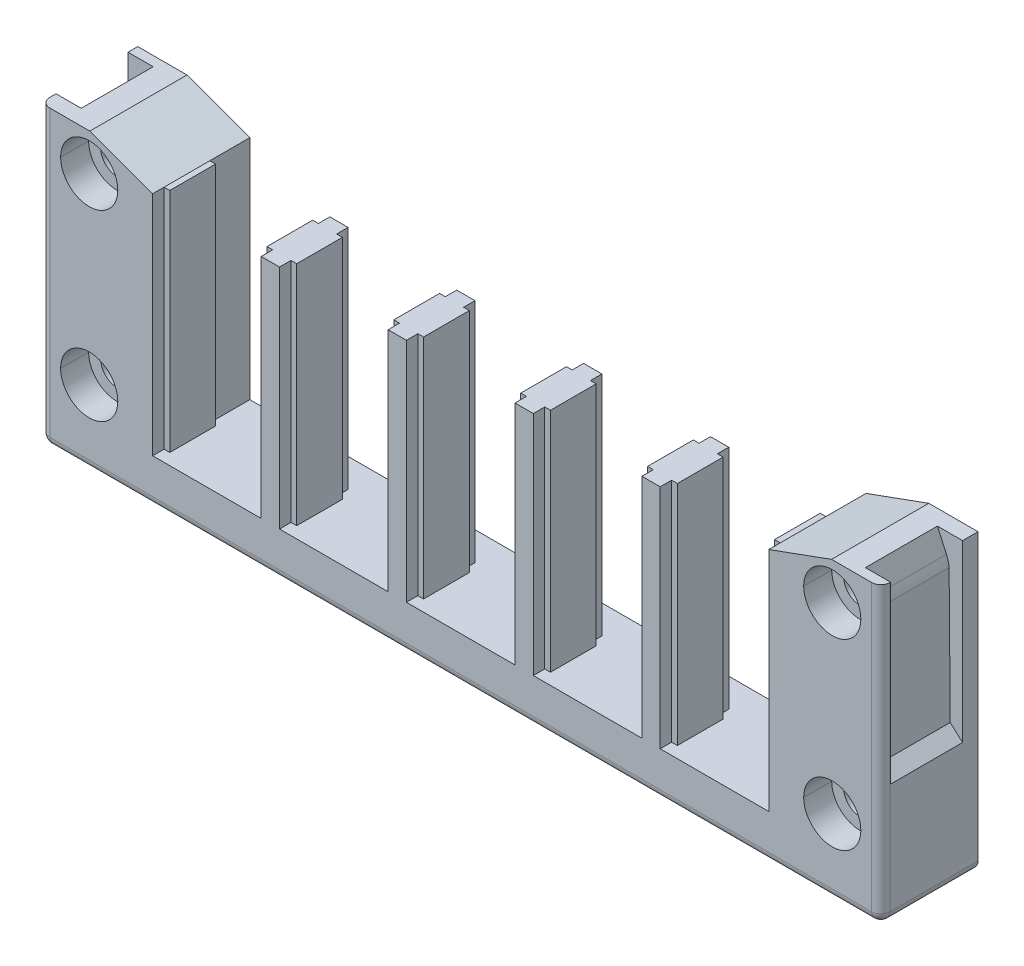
ISO-10303-21;
HEADER;
FILE_DESCRIPTION(('STEP AP214'),'2;1');
FILE_NAME('part.step','',(''),(''),'','','');
FILE_SCHEMA(('AUTOMOTIVE_DESIGN { 1 0 10303 214 1 1 1 1 }'));
ENDSEC;
DATA;
#1=APPLICATION_CONTEXT('core data for automotive mechanical design processes');
#2=APPLICATION_PROTOCOL_DEFINITION('international standard','automotive_design',2000,#1);
#3=PRODUCT_CONTEXT('',#1,'mechanical');
#4=PRODUCT('Part','Part','',(#3));
#5=PRODUCT_RELATED_PRODUCT_CATEGORY('part','',(#4));
#6=PRODUCT_DEFINITION_FORMATION('','',#4);
#7=PRODUCT_DEFINITION_CONTEXT('part definition',#1,'design');
#8=PRODUCT_DEFINITION('design','',#6,#7);
#9=PRODUCT_DEFINITION_SHAPE('','',#8);
#10=(LENGTH_UNIT() NAMED_UNIT(*) SI_UNIT(.MILLI.,.METRE.));
#11=(NAMED_UNIT(*) PLANE_ANGLE_UNIT() SI_UNIT($,.RADIAN.));
#12=(NAMED_UNIT(*) SI_UNIT($,.STERADIAN.) SOLID_ANGLE_UNIT());
#13=UNCERTAINTY_MEASURE_WITH_UNIT(LENGTH_MEASURE(1.E-05),#10,'distance_accuracy_value','');
#14=(GEOMETRIC_REPRESENTATION_CONTEXT(3) GLOBAL_UNCERTAINTY_ASSIGNED_CONTEXT((#13)) GLOBAL_UNIT_ASSIGNED_CONTEXT((#10,
#11,#12)) REPRESENTATION_CONTEXT('',''));
#15=CARTESIAN_POINT('',(0.,0.,0.));
#16=DIRECTION('',(0.,0.,1.));
#17=DIRECTION('',(1.,0.,0.));
#18=AXIS2_PLACEMENT_3D('',#15,#16,#17);
#19=CARTESIAN_POINT('',(53.9,-56.7782261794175,6.5));
#20=DIRECTION('',(0.,0.,-1.));
#21=DIRECTION('',(0.,-1.,0.));
#22=AXIS2_PLACEMENT_3D('',#19,#20,#21);
#23=PLANE('',#22);
#24=DIRECTION('',(0.,1.,0.));
#25=VECTOR('',#24,1.);
#26=CARTESIAN_POINT('',(52.9,-56.7782261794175,6.5));
#27=LINE('',#26,#25);
#28=CARTESIAN_POINT('',(52.8999999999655,-43.7,6.5));
#29=VERTEX_POINT('',#28);
#30=CARTESIAN_POINT('',(52.9,-4.,6.5));
#31=VERTEX_POINT('',#30);
#32=EDGE_CURVE('E10',#29,#31,#27,.T.);
#33=ORIENTED_EDGE('',*,*,#32,.F.);
#34=DIRECTION('',(1.,0.,0.));
#35=VECTOR('',#34,1.);
#36=CARTESIAN_POINT('',(53.9,-43.7,6.5));
#37=LINE('',#36,#35);
#38=CARTESIAN_POINT('',(53.8999999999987,-43.7,6.5));
#39=VERTEX_POINT('',#38);
#40=EDGE_CURVE('E2412',#29,#39,#37,.T.);
#41=ORIENTED_EDGE('',*,*,#40,.T.);
#42=DIRECTION('',(0.,1.,0.));
#43=VECTOR('',#42,1.);
#44=CARTESIAN_POINT('',(53.9,-56.7782261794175,6.5));
#45=LINE('',#44,#43);
#46=CARTESIAN_POINT('',(53.9,-4.,6.5));
#47=VERTEX_POINT('',#46);
#48=EDGE_CURVE('E2016',#39,#47,#45,.T.);
#49=ORIENTED_EDGE('',*,*,#48,.T.);
#50=DIRECTION('',(-1.,0.,0.));
#51=VECTOR('',#50,1.);
#52=CARTESIAN_POINT('',(53.9,-4.,6.5));
#53=LINE('',#52,#51);
#54=EDGE_CURVE('E864',#47,#31,#53,.T.);
#55=ORIENTED_EDGE('',*,*,#54,.T.);
#56=EDGE_LOOP('',(#33,#41,#49,#55));
#57=FACE_BOUND('',#56,.T.);
#58=ADVANCED_FACE('F15',(#57),#23,.F.);
#59=CARTESIAN_POINT('',(52.9,-56.7782261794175,6.5));
#60=DIRECTION('',(1.,0.,0.));
#61=DIRECTION('',(0.,1.,0.));
#62=AXIS2_PLACEMENT_3D('',#59,#60,#61);
#63=PLANE('',#62);
#64=DIRECTION('',(0.,1.,0.));
#65=VECTOR('',#64,1.);
#66=CARTESIAN_POINT('',(52.9,-56.7782261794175,-1.5));
#67=LINE('',#66,#65);
#68=CARTESIAN_POINT('',(52.9000000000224,-43.7,-1.5));
#69=VERTEX_POINT('',#68);
#70=CARTESIAN_POINT('',(52.9,-4.,-1.5));
#71=VERTEX_POINT('',#70);
#72=EDGE_CURVE('E23',#69,#71,#67,.T.);
#73=ORIENTED_EDGE('',*,*,#72,.F.);
#74=DIRECTION('',(0.,0.,1.));
#75=VECTOR('',#74,1.);
#76=CARTESIAN_POINT('',(52.9,-43.7,6.5));
#77=LINE('',#76,#75);
#78=EDGE_CURVE('E2193',#69,#29,#77,.T.);
#79=ORIENTED_EDGE('',*,*,#78,.T.);
#80=ORIENTED_EDGE('',*,*,#32,.T.);
#81=DIRECTION('',(0.,0.,-1.));
#82=VECTOR('',#81,1.);
#83=CARTESIAN_POINT('',(52.9,-4.,6.5));
#84=LINE('',#83,#82);
#85=EDGE_CURVE('E871',#31,#71,#84,.T.);
#86=ORIENTED_EDGE('',*,*,#85,.T.);
#87=EDGE_LOOP('',(#73,#79,#80,#86));
#88=FACE_BOUND('',#87,.T.);
#89=ADVANCED_FACE('F1940',(#88),#63,.F.);
#90=CARTESIAN_POINT('',(53.9,-56.7782261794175,-1.5));
#91=DIRECTION('',(0.,0.,1.));
#92=DIRECTION('',(1.,0.,0.));
#93=AXIS2_PLACEMENT_3D('',#90,#91,#92);
#94=PLANE('',#93);
#95=DIRECTION('',(0.,1.,0.));
#96=VECTOR('',#95,1.);
#97=CARTESIAN_POINT('',(53.9,-56.7782261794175,-1.5));
#98=LINE('',#97,#96);
#99=CARTESIAN_POINT('',(53.8999999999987,-43.7,-1.5));
#100=VERTEX_POINT('',#99);
#101=CARTESIAN_POINT('',(53.9,-4.,-1.5));
#102=VERTEX_POINT('',#101);
#103=EDGE_CURVE('E2082',#100,#102,#98,.T.);
#104=ORIENTED_EDGE('',*,*,#103,.F.);
#105=DIRECTION('',(-1.,0.,0.));
#106=VECTOR('',#105,1.);
#107=CARTESIAN_POINT('',(53.9,-43.7,-1.5));
#108=LINE('',#107,#106);
#109=EDGE_CURVE('E2196',#100,#69,#108,.T.);
#110=ORIENTED_EDGE('',*,*,#109,.T.);
#111=ORIENTED_EDGE('',*,*,#72,.T.);
#112=DIRECTION('',(1.,0.,0.));
#113=VECTOR('',#112,1.);
#114=CARTESIAN_POINT('',(53.9,-4.,-1.5));
#115=LINE('',#114,#113);
#116=EDGE_CURVE('E868',#71,#102,#115,.T.);
#117=ORIENTED_EDGE('',*,*,#116,.T.);
#118=EDGE_LOOP('',(#104,#110,#111,#117));
#119=FACE_BOUND('',#118,.T.);
#120=ADVANCED_FACE('F1930',(#119),#94,.F.);
#121=CARTESIAN_POINT('',(0.,-4.,0.));
#122=DIRECTION('',(0.,-1.,0.));
#123=DIRECTION('',(0.,0.,-1.));
#124=AXIS2_PLACEMENT_3D('',#121,#122,#123);
#125=PLANE('',#124);
#126=ORIENTED_EDGE('',*,*,#54,.F.);
#127=DIRECTION('',(0.,0.,1.));
#128=VECTOR('',#127,1.);
#129=CARTESIAN_POINT('',(53.9,-4.,6.5));
#130=LINE('',#129,#128);
#131=EDGE_CURVE('E2293',#102,#47,#130,.T.);
#132=ORIENTED_EDGE('',*,*,#131,.F.);
#133=ORIENTED_EDGE('',*,*,#116,.F.);
#134=ORIENTED_EDGE('',*,*,#85,.F.);
#135=EDGE_LOOP('',(#126,#132,#133,#134));
#136=FACE_BOUND('',#135,.T.);
#137=ADVANCED_FACE('F1920',(#136),#125,.F.);
#138=CARTESIAN_POINT('',(31.7,-56.7782261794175,8.5));
#139=DIRECTION('',(1.,0.,0.));
#140=DIRECTION('',(0.,1.,0.));
#141=AXIS2_PLACEMENT_3D('',#138,#139,#140);
#142=PLANE('',#141);
#143=DIRECTION('',(0.,1.,0.));
#144=VECTOR('',#143,1.);
#145=CARTESIAN_POINT('',(31.7,-56.7782261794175,6.5));
#146=LINE('',#145,#144);
#147=CARTESIAN_POINT('',(31.7000000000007,-43.7,6.5));
#148=VERTEX_POINT('',#147);
#149=CARTESIAN_POINT('',(31.7,-4.,6.5));
#150=VERTEX_POINT('',#149);
#151=EDGE_CURVE('E813',#148,#150,#146,.T.);
#152=ORIENTED_EDGE('',*,*,#151,.F.);
#153=DIRECTION('',(0.,0.,1.));
#154=VECTOR('',#153,1.);
#155=CARTESIAN_POINT('',(31.7,-43.7,8.5));
#156=LINE('',#155,#154);
#157=CARTESIAN_POINT('',(31.699999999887,-43.7,8.5));
#158=VERTEX_POINT('',#157);
#159=EDGE_CURVE('E2281',#148,#158,#156,.T.);
#160=ORIENTED_EDGE('',*,*,#159,.T.);
#161=DIRECTION('',(0.,1.,0.));
#162=VECTOR('',#161,1.);
#163=CARTESIAN_POINT('',(31.7,-56.7782261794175,8.5));
#164=LINE('',#163,#162);
#165=CARTESIAN_POINT('',(31.7,-4.,8.5));
#166=VERTEX_POINT('',#165);
#167=EDGE_CURVE('E2545',#158,#166,#164,.T.);
#168=ORIENTED_EDGE('',*,*,#167,.T.);
#169=DIRECTION('',(0.,0.,-1.));
#170=VECTOR('',#169,1.);
#171=CARTESIAN_POINT('',(31.7,-4.,8.5));
#172=LINE('',#171,#170);
#173=EDGE_CURVE('E822',#166,#150,#172,.T.);
#174=ORIENTED_EDGE('',*,*,#173,.T.);
#175=EDGE_LOOP('',(#152,#160,#168,#174));
#176=FACE_BOUND('',#175,.T.);
#177=ADVANCED_FACE('F1205',(#176),#142,.F.);
#178=CARTESIAN_POINT('',(30.7,-56.7782261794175,6.5));
#179=DIRECTION('',(0.,0.,-1.));
#180=DIRECTION('',(0.,-1.,0.));
#181=AXIS2_PLACEMENT_3D('',#178,#179,#180);
#182=PLANE('',#181);
#183=DIRECTION('',(0.,1.,0.));
#184=VECTOR('',#183,1.);
#185=CARTESIAN_POINT('',(30.7,-56.7782261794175,6.5));
#186=LINE('',#185,#184);
#187=CARTESIAN_POINT('',(30.6999999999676,-43.7,6.5));
#188=VERTEX_POINT('',#187);
#189=CARTESIAN_POINT('',(30.7,-4.,6.5));
#190=VERTEX_POINT('',#189);
#191=EDGE_CURVE('E801',#188,#190,#186,.T.);
#192=ORIENTED_EDGE('',*,*,#191,.F.);
#193=DIRECTION('',(1.,0.,0.));
#194=VECTOR('',#193,1.);
#195=CARTESIAN_POINT('',(30.7,-43.7,6.5));
#196=LINE('',#195,#194);
#197=EDGE_CURVE('E2289',#188,#148,#196,.T.);
#198=ORIENTED_EDGE('',*,*,#197,.T.);
#199=ORIENTED_EDGE('',*,*,#151,.T.);
#200=DIRECTION('',(-1.,0.,0.));
#201=VECTOR('',#200,1.);
#202=CARTESIAN_POINT('',(30.7,-4.,6.5));
#203=LINE('',#202,#201);
#204=EDGE_CURVE('E817',#150,#190,#203,.T.);
#205=ORIENTED_EDGE('',*,*,#204,.T.);
#206=EDGE_LOOP('',(#192,#198,#199,#205));
#207=FACE_BOUND('',#206,.T.);
#208=ADVANCED_FACE('F818',(#207),#182,.F.);
#209=CARTESIAN_POINT('',(30.7,-56.7782261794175,-1.5));
#210=DIRECTION('',(1.,0.,0.));
#211=DIRECTION('',(0.,1.,0.));
#212=AXIS2_PLACEMENT_3D('',#209,#210,#211);
#213=PLANE('',#212);
#214=DIRECTION('',(0.,1.,0.));
#215=VECTOR('',#214,1.);
#216=CARTESIAN_POINT('',(30.7,-56.7782261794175,-1.5));
#217=LINE('',#216,#215);
#218=CARTESIAN_POINT('',(30.7000000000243,-43.7,-1.5));
#219=VERTEX_POINT('',#218);
#220=CARTESIAN_POINT('',(30.7,-4.,-1.5));
#221=VERTEX_POINT('',#220);
#222=EDGE_CURVE('E814',#219,#221,#217,.T.);
#223=ORIENTED_EDGE('',*,*,#222,.F.);
#224=DIRECTION('',(0.,0.,1.));
#225=VECTOR('',#224,1.);
#226=CARTESIAN_POINT('',(30.7,-43.7,-1.5));
#227=LINE('',#226,#225);
#228=EDGE_CURVE('E808',#219,#188,#227,.T.);
#229=ORIENTED_EDGE('',*,*,#228,.T.);
#230=ORIENTED_EDGE('',*,*,#191,.T.);
#231=DIRECTION('',(0.,0.,-1.));
#232=VECTOR('',#231,1.);
#233=CARTESIAN_POINT('',(30.7,-4.,-1.5));
#234=LINE('',#233,#232);
#235=EDGE_CURVE('E805',#190,#221,#234,.T.);
#236=ORIENTED_EDGE('',*,*,#235,.T.);
#237=EDGE_LOOP('',(#223,#229,#230,#236));
#238=FACE_BOUND('',#237,.T.);
#239=ADVANCED_FACE('F803',(#238),#213,.F.);
#240=CARTESIAN_POINT('',(31.7,-56.7782261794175,-1.5));
#241=DIRECTION('',(0.,0.,1.));
#242=DIRECTION('',(1.,0.,0.));
#243=AXIS2_PLACEMENT_3D('',#240,#241,#242);
#244=PLANE('',#243);
#245=DIRECTION('',(0.,1.,0.));
#246=VECTOR('',#245,1.);
#247=CARTESIAN_POINT('',(31.7,-56.7782261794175,-1.5));
#248=LINE('',#247,#246);
#249=CARTESIAN_POINT('',(31.7000000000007,-43.7,-1.5));
#250=VERTEX_POINT('',#249);
#251=CARTESIAN_POINT('',(31.7,-4.,-1.5));
#252=VERTEX_POINT('',#251);
#253=EDGE_CURVE('E857',#250,#252,#248,.T.);
#254=ORIENTED_EDGE('',*,*,#253,.F.);
#255=DIRECTION('',(-1.,0.,0.));
#256=VECTOR('',#255,1.);
#257=CARTESIAN_POINT('',(31.7,-43.7,-1.5));
#258=LINE('',#257,#256);
#259=EDGE_CURVE('E2103',#250,#219,#258,.T.);
#260=ORIENTED_EDGE('',*,*,#259,.T.);
#261=ORIENTED_EDGE('',*,*,#222,.T.);
#262=DIRECTION('',(1.,0.,0.));
#263=VECTOR('',#262,1.);
#264=CARTESIAN_POINT('',(31.7,-4.,-1.5));
#265=LINE('',#264,#263);
#266=EDGE_CURVE('E828',#221,#252,#265,.T.);
#267=ORIENTED_EDGE('',*,*,#266,.T.);
#268=EDGE_LOOP('',(#254,#260,#261,#267));
#269=FACE_BOUND('',#268,.T.);
#270=ADVANCED_FACE('F1355',(#269),#244,.F.);
#271=CARTESIAN_POINT('',(31.7,-56.7782261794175,-3.5));
#272=DIRECTION('',(1.,0.,0.));
#273=DIRECTION('',(0.,1.,0.));
#274=AXIS2_PLACEMENT_3D('',#271,#272,#273);
#275=PLANE('',#274);
#276=DIRECTION('',(0.,1.,0.));
#277=VECTOR('',#276,1.);
#278=CARTESIAN_POINT('',(31.7,-56.7782261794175,-3.5));
#279=LINE('',#278,#277);
#280=CARTESIAN_POINT('',(31.7000000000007,-43.7,-3.5));
#281=VERTEX_POINT('',#280);
#282=CARTESIAN_POINT('',(31.7,-4.,-3.5));
#283=VERTEX_POINT('',#282);
#284=EDGE_CURVE('E854',#281,#283,#279,.T.);
#285=ORIENTED_EDGE('',*,*,#284,.F.);
#286=DIRECTION('',(0.,0.,1.));
#287=VECTOR('',#286,1.);
#288=CARTESIAN_POINT('',(31.7,-43.7,-3.5));
#289=LINE('',#288,#287);
#290=EDGE_CURVE('E2107',#281,#250,#289,.T.);
#291=ORIENTED_EDGE('',*,*,#290,.T.);
#292=ORIENTED_EDGE('',*,*,#253,.T.);
#293=DIRECTION('',(0.,0.,-1.));
#294=VECTOR('',#293,1.);
#295=CARTESIAN_POINT('',(31.7,-4.,-3.5));
#296=LINE('',#295,#294);
#297=EDGE_CURVE('E834',#252,#283,#296,.T.);
#298=ORIENTED_EDGE('',*,*,#297,.T.);
#299=EDGE_LOOP('',(#285,#291,#292,#298));
#300=FACE_BOUND('',#299,.T.);
#301=ADVANCED_FACE('F1005',(#300),#275,.F.);
#302=CARTESIAN_POINT('',(34.9,-56.7782261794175,-3.5));
#303=DIRECTION('',(0.,0.,1.));
#304=DIRECTION('',(1.,0.,0.));
#305=AXIS2_PLACEMENT_3D('',#302,#303,#304);
#306=PLANE('',#305);
#307=DIRECTION('',(0.,1.,0.));
#308=VECTOR('',#307,1.);
#309=CARTESIAN_POINT('',(34.9,-56.7782261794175,-3.5));
#310=LINE('',#309,#308);
#311=CARTESIAN_POINT('',(34.8999999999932,-43.7,-3.5));
#312=VERTEX_POINT('',#311);
#313=CARTESIAN_POINT('',(34.9,-4.,-3.5));
#314=VERTEX_POINT('',#313);
#315=EDGE_CURVE('E851',#312,#314,#310,.T.);
#316=ORIENTED_EDGE('',*,*,#315,.F.);
#317=DIRECTION('',(-1.,0.,0.));
#318=VECTOR('',#317,1.);
#319=CARTESIAN_POINT('',(34.9,-43.7,-3.5));
#320=LINE('',#319,#318);
#321=EDGE_CURVE('E2324',#312,#281,#320,.T.);
#322=ORIENTED_EDGE('',*,*,#321,.T.);
#323=ORIENTED_EDGE('',*,*,#284,.T.);
#324=DIRECTION('',(1.,0.,0.));
#325=VECTOR('',#324,1.);
#326=CARTESIAN_POINT('',(34.9,-4.,-3.5));
#327=LINE('',#326,#325);
#328=EDGE_CURVE('E2313',#283,#314,#327,.T.);
#329=ORIENTED_EDGE('',*,*,#328,.T.);
#330=EDGE_LOOP('',(#316,#322,#323,#329));
#331=FACE_BOUND('',#330,.T.);
#332=ADVANCED_FACE('F999',(#331),#306,.F.);
#333=CARTESIAN_POINT('',(34.9,-56.7782261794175,-1.5));
#334=DIRECTION('',(-1.,0.,0.));
#335=DIRECTION('',(0.,0.,1.));
#336=AXIS2_PLACEMENT_3D('',#333,#334,#335);
#337=PLANE('',#336);
#338=DIRECTION('',(0.,1.,0.));
#339=VECTOR('',#338,1.);
#340=CARTESIAN_POINT('',(34.9,-56.7782261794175,-1.5));
#341=LINE('',#340,#339);
#342=CARTESIAN_POINT('',(34.8999999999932,-43.7,-1.5));
#343=VERTEX_POINT('',#342);
#344=CARTESIAN_POINT('',(34.9,-4.,-1.5));
#345=VERTEX_POINT('',#344);
#346=EDGE_CURVE('E848',#343,#345,#341,.T.);
#347=ORIENTED_EDGE('',*,*,#346,.F.);
#348=DIRECTION('',(0.,0.,-1.));
#349=VECTOR('',#348,1.);
#350=CARTESIAN_POINT('',(34.9,-43.7,-1.5));
#351=LINE('',#350,#349);
#352=EDGE_CURVE('E2339',#343,#312,#351,.T.);
#353=ORIENTED_EDGE('',*,*,#352,.T.);
#354=ORIENTED_EDGE('',*,*,#315,.T.);
#355=DIRECTION('',(0.,0.,1.));
#356=VECTOR('',#355,1.);
#357=CARTESIAN_POINT('',(34.9,-4.,-1.5));
#358=LINE('',#357,#356);
#359=EDGE_CURVE('E2317',#314,#345,#358,.T.);
#360=ORIENTED_EDGE('',*,*,#359,.T.);
#361=EDGE_LOOP('',(#347,#353,#354,#360));
#362=FACE_BOUND('',#361,.T.);
#363=ADVANCED_FACE('F1004',(#362),#337,.F.);
#364=CARTESIAN_POINT('',(35.9,-56.7782261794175,-1.5));
#365=DIRECTION('',(0.,0.,1.));
#366=DIRECTION('',(1.,0.,0.));
#367=AXIS2_PLACEMENT_3D('',#364,#365,#366);
#368=PLANE('',#367);
#369=DIRECTION('',(0.,1.,0.));
#370=VECTOR('',#369,1.);
#371=CARTESIAN_POINT('',(35.9,-56.7782261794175,-1.5));
#372=LINE('',#371,#370);
#373=CARTESIAN_POINT('',(35.9000000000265,-43.7,-1.5));
#374=VERTEX_POINT('',#373);
#375=CARTESIAN_POINT('',(35.9,-4.,-1.5));
#376=VERTEX_POINT('',#375);
#377=EDGE_CURVE('E847',#374,#376,#372,.T.);
#378=ORIENTED_EDGE('',*,*,#377,.F.);
#379=DIRECTION('',(-1.,0.,0.));
#380=VECTOR('',#379,1.);
#381=CARTESIAN_POINT('',(35.9,-43.7,-1.5));
#382=LINE('',#381,#380);
#383=EDGE_CURVE('E2347',#374,#343,#382,.T.);
#384=ORIENTED_EDGE('',*,*,#383,.T.);
#385=ORIENTED_EDGE('',*,*,#346,.T.);
#386=DIRECTION('',(1.,0.,0.));
#387=VECTOR('',#386,1.);
#388=CARTESIAN_POINT('',(35.9,-4.,-1.5));
#389=LINE('',#388,#387);
#390=EDGE_CURVE('E2958',#345,#376,#389,.T.);
#391=ORIENTED_EDGE('',*,*,#390,.T.);
#392=EDGE_LOOP('',(#378,#384,#385,#391));
#393=FACE_BOUND('',#392,.T.);
#394=ADVANCED_FACE('F1477',(#393),#368,.F.);
#395=CARTESIAN_POINT('',(35.9,-56.7782261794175,6.5));
#396=DIRECTION('',(-1.,0.,0.));
#397=DIRECTION('',(0.,0.,1.));
#398=AXIS2_PLACEMENT_3D('',#395,#396,#397);
#399=PLANE('',#398);
#400=DIRECTION('',(0.,1.,0.));
#401=VECTOR('',#400,1.);
#402=CARTESIAN_POINT('',(35.9,-56.7782261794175,6.5));
#403=LINE('',#402,#401);
#404=CARTESIAN_POINT('',(35.9000000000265,-43.7,6.5));
#405=VERTEX_POINT('',#404);
#406=CARTESIAN_POINT('',(35.9,-4.,6.5));
#407=VERTEX_POINT('',#406);
#408=EDGE_CURVE('E844',#405,#407,#403,.T.);
#409=ORIENTED_EDGE('',*,*,#408,.F.);
#410=DIRECTION('',(0.,0.,-1.));
#411=VECTOR('',#410,1.);
#412=CARTESIAN_POINT('',(35.9,-43.7,6.5));
#413=LINE('',#412,#411);
#414=EDGE_CURVE('E2355',#405,#374,#413,.T.);
#415=ORIENTED_EDGE('',*,*,#414,.T.);
#416=ORIENTED_EDGE('',*,*,#377,.T.);
#417=DIRECTION('',(0.,0.,1.));
#418=VECTOR('',#417,1.);
#419=CARTESIAN_POINT('',(35.9,-4.,6.5));
#420=LINE('',#419,#418);
#421=EDGE_CURVE('E2532',#376,#407,#420,.T.);
#422=ORIENTED_EDGE('',*,*,#421,.T.);
#423=EDGE_LOOP('',(#409,#415,#416,#422));
#424=FACE_BOUND('',#423,.T.);
#425=ADVANCED_FACE('F1111',(#424),#399,.F.);
#426=CARTESIAN_POINT('',(34.9,-56.7782261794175,6.5));
#427=DIRECTION('',(0.,0.,-1.));
#428=DIRECTION('',(0.,-1.,0.));
#429=AXIS2_PLACEMENT_3D('',#426,#427,#428);
#430=PLANE('',#429);
#431=DIRECTION('',(0.,1.,0.));
#432=VECTOR('',#431,1.);
#433=CARTESIAN_POINT('',(34.9,-56.7782261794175,6.5));
#434=LINE('',#433,#432);
#435=CARTESIAN_POINT('',(34.8999999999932,-43.7,6.5));
#436=VERTEX_POINT('',#435);
#437=CARTESIAN_POINT('',(34.9,-4.,6.5));
#438=VERTEX_POINT('',#437);
#439=EDGE_CURVE('E841',#436,#438,#434,.T.);
#440=ORIENTED_EDGE('',*,*,#439,.F.);
#441=DIRECTION('',(1.,0.,0.));
#442=VECTOR('',#441,1.);
#443=CARTESIAN_POINT('',(34.9,-43.7,6.5));
#444=LINE('',#443,#442);
#445=EDGE_CURVE('E2363',#436,#405,#444,.T.);
#446=ORIENTED_EDGE('',*,*,#445,.T.);
#447=ORIENTED_EDGE('',*,*,#408,.T.);
#448=DIRECTION('',(-1.,0.,0.));
#449=VECTOR('',#448,1.);
#450=CARTESIAN_POINT('',(34.9,-4.,6.5));
#451=LINE('',#450,#449);
#452=EDGE_CURVE('E2528',#407,#438,#451,.T.);
#453=ORIENTED_EDGE('',*,*,#452,.T.);
#454=EDGE_LOOP('',(#440,#446,#447,#453));
#455=FACE_BOUND('',#454,.T.);
#456=ADVANCED_FACE('F1105',(#455),#430,.F.);
#457=CARTESIAN_POINT('',(34.9,-56.7782261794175,8.5));
#458=DIRECTION('',(-1.,0.,0.));
#459=DIRECTION('',(0.,0.,1.));
#460=AXIS2_PLACEMENT_3D('',#457,#458,#459);
#461=PLANE('',#460);
#462=DIRECTION('',(0.,1.,0.));
#463=VECTOR('',#462,1.);
#464=CARTESIAN_POINT('',(34.9,-56.7782261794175,8.5));
#465=LINE('',#464,#463);
#466=CARTESIAN_POINT('',(34.9,-43.7,8.5));
#467=VERTEX_POINT('',#466);
#468=CARTESIAN_POINT('',(34.9,-4.,8.5));
#469=VERTEX_POINT('',#468);
#470=EDGE_CURVE('E2537',#467,#469,#465,.T.);
#471=ORIENTED_EDGE('',*,*,#470,.F.);
#472=DIRECTION('',(0.,0.,-1.));
#473=VECTOR('',#472,1.);
#474=CARTESIAN_POINT('',(34.9,-43.7,8.5));
#475=LINE('',#474,#473);
#476=EDGE_CURVE('E2385',#467,#436,#475,.T.);
#477=ORIENTED_EDGE('',*,*,#476,.T.);
#478=ORIENTED_EDGE('',*,*,#439,.T.);
#479=DIRECTION('',(0.,0.,1.));
#480=VECTOR('',#479,1.);
#481=CARTESIAN_POINT('',(34.9,-4.,8.5));
#482=LINE('',#481,#480);
#483=EDGE_CURVE('E2533',#438,#469,#482,.T.);
#484=ORIENTED_EDGE('',*,*,#483,.T.);
#485=EDGE_LOOP('',(#471,#477,#478,#484));
#486=FACE_BOUND('',#485,.T.);
#487=ADVANCED_FACE('F1110',(#486),#461,.F.);
#488=CARTESIAN_POINT('',(0.,-4.,0.));
#489=DIRECTION('',(0.,1.,0.));
#490=DIRECTION('',(1.,0.,0.));
#491=AXIS2_PLACEMENT_3D('',#488,#489,#490);
#492=PLANE('',#491);
#493=DIRECTION('',(-1.,0.,0.));
#494=VECTOR('',#493,1.);
#495=CARTESIAN_POINT('',(31.7,-4.,8.5));
#496=LINE('',#495,#494);
#497=EDGE_CURVE('E2541',#469,#166,#496,.T.);
#498=ORIENTED_EDGE('',*,*,#497,.F.);
#499=ORIENTED_EDGE('',*,*,#483,.F.);
#500=ORIENTED_EDGE('',*,*,#452,.F.);
#501=ORIENTED_EDGE('',*,*,#421,.F.);
#502=ORIENTED_EDGE('',*,*,#390,.F.);
#503=ORIENTED_EDGE('',*,*,#359,.F.);
#504=ORIENTED_EDGE('',*,*,#328,.F.);
#505=ORIENTED_EDGE('',*,*,#297,.F.);
#506=ORIENTED_EDGE('',*,*,#266,.F.);
#507=ORIENTED_EDGE('',*,*,#235,.F.);
#508=ORIENTED_EDGE('',*,*,#204,.F.);
#509=ORIENTED_EDGE('',*,*,#173,.F.);
#510=EDGE_LOOP('',(#498,#499,#500,#501,#502,#503,#504,#505,#506,#507,#508,#509));
#511=FACE_BOUND('',#510,.T.);
#512=ADVANCED_FACE('F825',(#511),#492,.T.);
#513=CARTESIAN_POINT('',(-53.9000000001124,-56.7782261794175,-1.5));
#514=DIRECTION('',(0.,0.,1.));
#515=DIRECTION('',(1.,0.,0.));
#516=AXIS2_PLACEMENT_3D('',#513,#514,#515);
#517=PLANE('',#516);
#518=DIRECTION('',(0.,1.,0.));
#519=VECTOR('',#518,1.);
#520=CARTESIAN_POINT('',(-52.9000000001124,-56.7782261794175,-1.5));
#521=LINE('',#520,#519);
#522=CARTESIAN_POINT('',(-52.9000000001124,-43.7,-1.5));
#523=VERTEX_POINT('',#522);
#524=CARTESIAN_POINT('',(-52.9000000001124,-4.,-1.5));
#525=VERTEX_POINT('',#524);
#526=EDGE_CURVE('E2950',#523,#525,#521,.T.);
#527=ORIENTED_EDGE('',*,*,#526,.F.);
#528=DIRECTION('',(-1.,0.,0.));
#529=VECTOR('',#528,1.);
#530=CARTESIAN_POINT('',(-53.9000000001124,-43.7,-1.5));
#531=LINE('',#530,#529);
#532=CARTESIAN_POINT('',(-53.9000000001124,-43.7,-1.5));
#533=VERTEX_POINT('',#532);
#534=EDGE_CURVE('E2226',#523,#533,#531,.T.);
#535=ORIENTED_EDGE('',*,*,#534,.T.);
#536=DIRECTION('',(0.,1.,0.));
#537=VECTOR('',#536,1.);
#538=CARTESIAN_POINT('',(-53.9000000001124,-56.7782261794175,-1.5));
#539=LINE('',#538,#537);
#540=CARTESIAN_POINT('',(-53.9,-4.,-1.5));
#541=VERTEX_POINT('',#540);
#542=EDGE_CURVE('E2125',#533,#541,#539,.T.);
#543=ORIENTED_EDGE('',*,*,#542,.T.);
#544=DIRECTION('',(1.,0.,0.));
#545=VECTOR('',#544,1.);
#546=CARTESIAN_POINT('',(-53.9000000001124,-4.,-1.5));
#547=LINE('',#546,#545);
#548=EDGE_CURVE('E2936',#541,#525,#547,.T.);
#549=ORIENTED_EDGE('',*,*,#548,.T.);
#550=EDGE_LOOP('',(#527,#535,#543,#549));
#551=FACE_BOUND('',#550,.T.);
#552=ADVANCED_FACE('F1443',(#551),#517,.F.);
#553=CARTESIAN_POINT('',(-52.9000000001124,-56.7782261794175,-1.5));
#554=DIRECTION('',(-1.,0.,0.));
#555=DIRECTION('',(0.,0.,1.));
#556=AXIS2_PLACEMENT_3D('',#553,#554,#555);
#557=PLANE('',#556);
#558=DIRECTION('',(0.,1.,0.));
#559=VECTOR('',#558,1.);
#560=CARTESIAN_POINT('',(-52.9000000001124,-56.7782261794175,6.5));
#561=LINE('',#560,#559);
#562=CARTESIAN_POINT('',(-52.9000000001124,-43.7,6.5));
#563=VERTEX_POINT('',#562);
#564=CARTESIAN_POINT('',(-52.9000000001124,-4.,6.5));
#565=VERTEX_POINT('',#564);
#566=EDGE_CURVE('E2947',#563,#565,#561,.T.);
#567=ORIENTED_EDGE('',*,*,#566,.F.);
#568=DIRECTION('',(0.,0.,-1.));
#569=VECTOR('',#568,1.);
#570=CARTESIAN_POINT('',(-52.9000000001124,-43.7,-1.5));
#571=LINE('',#570,#569);
#572=EDGE_CURVE('E2230',#563,#523,#571,.T.);
#573=ORIENTED_EDGE('',*,*,#572,.T.);
#574=ORIENTED_EDGE('',*,*,#526,.T.);
#575=DIRECTION('',(0.,0.,1.));
#576=VECTOR('',#575,1.);
#577=CARTESIAN_POINT('',(-52.9000000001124,-4.,-1.5));
#578=LINE('',#577,#576);
#579=EDGE_CURVE('E2943',#525,#565,#578,.T.);
#580=ORIENTED_EDGE('',*,*,#579,.T.);
#581=EDGE_LOOP('',(#567,#573,#574,#580));
#582=FACE_BOUND('',#581,.T.);
#583=ADVANCED_FACE('F1250',(#582),#557,.F.);
#584=CARTESIAN_POINT('',(-53.9000000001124,-56.7782261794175,6.5));
#585=DIRECTION('',(0.,0.,-1.));
#586=DIRECTION('',(0.,-1.,0.));
#587=AXIS2_PLACEMENT_3D('',#584,#585,#586);
#588=PLANE('',#587);
#589=DIRECTION('',(0.,1.,0.));
#590=VECTOR('',#589,1.);
#591=CARTESIAN_POINT('',(-53.9000000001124,-56.7782261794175,6.5));
#592=LINE('',#591,#590);
#593=CARTESIAN_POINT('',(-53.9000000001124,-43.7,6.5));
#594=VERTEX_POINT('',#593);
#595=CARTESIAN_POINT('',(-53.9000000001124,-4.,6.5));
#596=VERTEX_POINT('',#595);
#597=EDGE_CURVE('E2185',#594,#596,#592,.T.);
#598=ORIENTED_EDGE('',*,*,#597,.F.);
#599=DIRECTION('',(1.,0.,0.));
#600=VECTOR('',#599,1.);
#601=CARTESIAN_POINT('',(-53.9000000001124,-43.7,6.5));
#602=LINE('',#601,#600);
#603=EDGE_CURVE('E2241',#594,#563,#602,.T.);
#604=ORIENTED_EDGE('',*,*,#603,.T.);
#605=ORIENTED_EDGE('',*,*,#566,.T.);
#606=DIRECTION('',(-1.,0.,0.));
#607=VECTOR('',#606,1.);
#608=CARTESIAN_POINT('',(-53.9000000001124,-4.,6.5));
#609=LINE('',#608,#607);
#610=EDGE_CURVE('E2940',#565,#596,#609,.T.);
#611=ORIENTED_EDGE('',*,*,#610,.T.);
#612=EDGE_LOOP('',(#598,#604,#605,#611));
#613=FACE_BOUND('',#612,.T.);
#614=ADVANCED_FACE('F1244',(#613),#588,.F.);
#615=CARTESIAN_POINT('',(0.,-4.,0.));
#616=DIRECTION('',(0.,-1.,0.));
#617=DIRECTION('',(0.,0.,-1.));
#618=AXIS2_PLACEMENT_3D('',#615,#616,#617);
#619=PLANE('',#618);
#620=ORIENTED_EDGE('',*,*,#548,.F.);
#621=DIRECTION('',(0.,0.,-1.));
#622=VECTOR('',#621,1.);
#623=CARTESIAN_POINT('',(-53.9000000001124,-4.,-1.5));
#624=LINE('',#623,#622);
#625=EDGE_CURVE('E2618',#596,#541,#624,.T.);
#626=ORIENTED_EDGE('',*,*,#625,.F.);
#627=ORIENTED_EDGE('',*,*,#610,.F.);
#628=ORIENTED_EDGE('',*,*,#579,.F.);
#629=EDGE_LOOP('',(#620,#626,#627,#628));
#630=FACE_BOUND('',#629,.T.);
#631=ADVANCED_FACE('F1249',(#630),#619,.F.);
#632=CARTESIAN_POINT('',(9.5,-56.7782261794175,8.5));
#633=DIRECTION('',(1.,0.,0.));
#634=DIRECTION('',(0.,1.,0.));
#635=AXIS2_PLACEMENT_3D('',#632,#633,#634);
#636=PLANE('',#635);
#637=DIRECTION('',(0.,1.,0.));
#638=VECTOR('',#637,1.);
#639=CARTESIAN_POINT('',(9.5,-56.7782261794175,6.5));
#640=LINE('',#639,#638);
#641=CARTESIAN_POINT('',(9.50000000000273,-43.7,6.5));
#642=VERTEX_POINT('',#641);
#643=CARTESIAN_POINT('',(9.5,-4.,6.5));
#644=VERTEX_POINT('',#643);
#645=EDGE_CURVE('E2933',#642,#644,#640,.T.);
#646=ORIENTED_EDGE('',*,*,#645,.F.);
#647=DIRECTION('',(0.,0.,1.));
#648=VECTOR('',#647,1.);
#649=CARTESIAN_POINT('',(9.5,-43.7,8.5));
#650=LINE('',#649,#648);
#651=CARTESIAN_POINT('',(9.49999999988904,-43.7,8.5));
#652=VERTEX_POINT('',#651);
#653=EDGE_CURVE('E2438',#642,#652,#650,.T.);
#654=ORIENTED_EDGE('',*,*,#653,.T.);
#655=DIRECTION('',(0.,1.,0.));
#656=VECTOR('',#655,1.);
#657=CARTESIAN_POINT('',(9.5,-56.7782261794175,8.5));
#658=LINE('',#657,#656);
#659=CARTESIAN_POINT('',(9.5,-4.,8.5));
#660=VERTEX_POINT('',#659);
#661=EDGE_CURVE('E2559',#652,#660,#658,.T.);
#662=ORIENTED_EDGE('',*,*,#661,.T.);
#663=DIRECTION('',(0.,0.,-1.));
#664=VECTOR('',#663,1.);
#665=CARTESIAN_POINT('',(9.5,-4.,8.5));
#666=LINE('',#665,#664);
#667=EDGE_CURVE('E2907',#660,#644,#666,.T.);
#668=ORIENTED_EDGE('',*,*,#667,.T.);
#669=EDGE_LOOP('',(#646,#654,#662,#668));
#670=FACE_BOUND('',#669,.T.);
#671=ADVANCED_FACE('F1847',(#670),#636,.F.);
#672=CARTESIAN_POINT('',(8.5,-56.7782261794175,6.5));
#673=DIRECTION('',(0.,0.,-1.));
#674=DIRECTION('',(0.,-1.,0.));
#675=AXIS2_PLACEMENT_3D('',#672,#673,#674);
#676=PLANE('',#675);
#677=DIRECTION('',(0.,1.,0.));
#678=VECTOR('',#677,1.);
#679=CARTESIAN_POINT('',(8.5,-56.7782261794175,6.5));
#680=LINE('',#679,#678);
#681=CARTESIAN_POINT('',(8.49999999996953,-43.7,6.5));
#682=VERTEX_POINT('',#681);
#683=CARTESIAN_POINT('',(8.5,-4.,6.5));
#684=VERTEX_POINT('',#683);
#685=EDGE_CURVE('E2930',#682,#684,#680,.T.);
#686=ORIENTED_EDGE('',*,*,#685,.F.);
#687=DIRECTION('',(1.,0.,0.));
#688=VECTOR('',#687,1.);
#689=CARTESIAN_POINT('',(8.5,-43.7,6.5));
#690=LINE('',#689,#688);
#691=EDGE_CURVE('E2442',#682,#642,#690,.T.);
#692=ORIENTED_EDGE('',*,*,#691,.T.);
#693=ORIENTED_EDGE('',*,*,#645,.T.);
#694=DIRECTION('',(-1.,0.,0.));
#695=VECTOR('',#694,1.);
#696=CARTESIAN_POINT('',(8.5,-4.,6.5));
#697=LINE('',#696,#695);
#698=EDGE_CURVE('E2903',#644,#684,#697,.T.);
#699=ORIENTED_EDGE('',*,*,#698,.T.);
#700=EDGE_LOOP('',(#686,#692,#693,#699));
#701=FACE_BOUND('',#700,.T.);
#702=ADVANCED_FACE('F1599',(#701),#676,.F.);
#703=CARTESIAN_POINT('',(8.5,-56.7782261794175,-1.5));
#704=DIRECTION('',(1.,0.,0.));
#705=DIRECTION('',(0.,1.,0.));
#706=AXIS2_PLACEMENT_3D('',#703,#704,#705);
#707=PLANE('',#706);
#708=DIRECTION('',(0.,1.,0.));
#709=VECTOR('',#708,1.);
#710=CARTESIAN_POINT('',(8.5,-56.7782261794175,-1.5));
#711=LINE('',#710,#709);
#712=CARTESIAN_POINT('',(8.50000000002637,-43.7,-1.5));
#713=VERTEX_POINT('',#712);
#714=CARTESIAN_POINT('',(8.5,-4.,-1.5));
#715=VERTEX_POINT('',#714);
#716=EDGE_CURVE('E2652',#713,#715,#711,.T.);
#717=ORIENTED_EDGE('',*,*,#716,.F.);
#718=DIRECTION('',(0.,0.,1.));
#719=VECTOR('',#718,1.);
#720=CARTESIAN_POINT('',(8.5,-43.7,-1.5));
#721=LINE('',#720,#719);
#722=EDGE_CURVE('E2446',#713,#682,#721,.T.);
#723=ORIENTED_EDGE('',*,*,#722,.T.);
#724=ORIENTED_EDGE('',*,*,#685,.T.);
#725=DIRECTION('',(0.,0.,-1.));
#726=VECTOR('',#725,1.);
#727=CARTESIAN_POINT('',(8.5,-4.,-1.5));
#728=LINE('',#727,#726);
#729=EDGE_CURVE('E2897',#684,#715,#728,.T.);
#730=ORIENTED_EDGE('',*,*,#729,.T.);
#731=EDGE_LOOP('',(#717,#723,#724,#730));
#732=FACE_BOUND('',#731,.T.);
#733=ADVANCED_FACE('F1594',(#732),#707,.F.);
#734=CARTESIAN_POINT('',(9.5,-56.7782261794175,-1.5));
#735=DIRECTION('',(0.,0.,1.));
#736=DIRECTION('',(1.,0.,0.));
#737=AXIS2_PLACEMENT_3D('',#734,#735,#736);
#738=PLANE('',#737);
#739=DIRECTION('',(0.,1.,0.));
#740=VECTOR('',#739,1.);
#741=CARTESIAN_POINT('',(9.5,-56.7782261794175,-1.5));
#742=LINE('',#741,#740);
#743=CARTESIAN_POINT('',(9.50000000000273,-43.7,-1.5));
#744=VERTEX_POINT('',#743);
#745=CARTESIAN_POINT('',(9.5,-4.,-1.5));
#746=VERTEX_POINT('',#745);
#747=EDGE_CURVE('E2649',#744,#746,#742,.T.);
#748=ORIENTED_EDGE('',*,*,#747,.F.);
#749=DIRECTION('',(-1.,0.,0.));
#750=VECTOR('',#749,1.);
#751=CARTESIAN_POINT('',(9.5,-43.7,-1.5));
#752=LINE('',#751,#750);
#753=EDGE_CURVE('E2450',#744,#713,#752,.T.);
#754=ORIENTED_EDGE('',*,*,#753,.T.);
#755=ORIENTED_EDGE('',*,*,#716,.T.);
#756=DIRECTION('',(1.,0.,0.));
#757=VECTOR('',#756,1.);
#758=CARTESIAN_POINT('',(9.5,-4.,-1.5));
#759=LINE('',#758,#757);
#760=EDGE_CURVE('E2893',#715,#746,#759,.T.);
#761=ORIENTED_EDGE('',*,*,#760,.T.);
#762=EDGE_LOOP('',(#748,#754,#755,#761));
#763=FACE_BOUND('',#762,.T.);
#764=ADVANCED_FACE('F1318',(#763),#738,.F.);
#765=CARTESIAN_POINT('',(9.5,-56.7782261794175,-3.5));
#766=DIRECTION('',(1.,0.,0.));
#767=DIRECTION('',(0.,1.,0.));
#768=AXIS2_PLACEMENT_3D('',#765,#766,#767);
#769=PLANE('',#768);
#770=DIRECTION('',(0.,1.,0.));
#771=VECTOR('',#770,1.);
#772=CARTESIAN_POINT('',(9.5,-56.7782261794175,-3.5));
#773=LINE('',#772,#771);
#774=CARTESIAN_POINT('',(9.50000000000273,-43.7,-3.5));
#775=VERTEX_POINT('',#774);
#776=CARTESIAN_POINT('',(9.5,-4.,-3.5));
#777=VERTEX_POINT('',#776);
#778=EDGE_CURVE('E2653',#775,#777,#773,.T.);
#779=ORIENTED_EDGE('',*,*,#778,.F.);
#780=DIRECTION('',(0.,0.,1.));
#781=VECTOR('',#780,1.);
#782=CARTESIAN_POINT('',(9.5,-43.7,-3.5));
#783=LINE('',#782,#781);
#784=EDGE_CURVE('E2236',#775,#744,#783,.T.);
#785=ORIENTED_EDGE('',*,*,#784,.T.);
#786=ORIENTED_EDGE('',*,*,#747,.T.);
#787=DIRECTION('',(0.,0.,-1.));
#788=VECTOR('',#787,1.);
#789=CARTESIAN_POINT('',(9.5,-4.,-3.5));
#790=LINE('',#789,#788);
#791=EDGE_CURVE('E2568',#746,#777,#790,.T.);
#792=ORIENTED_EDGE('',*,*,#791,.T.);
#793=EDGE_LOOP('',(#779,#785,#786,#792));
#794=FACE_BOUND('',#793,.T.);
#795=ADVANCED_FACE('F1312',(#794),#769,.F.);
#796=CARTESIAN_POINT('',(12.7,-56.7782261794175,-3.5));
#797=DIRECTION('',(0.,0.,1.));
#798=DIRECTION('',(1.,0.,0.));
#799=AXIS2_PLACEMENT_3D('',#796,#797,#798);
#800=PLANE('',#799);
#801=DIRECTION('',(0.,1.,0.));
#802=VECTOR('',#801,1.);
#803=CARTESIAN_POINT('',(12.7,-56.7782261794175,-3.5));
#804=LINE('',#803,#802);
#805=CARTESIAN_POINT('',(12.6999999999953,-43.7,-3.5));
#806=VERTEX_POINT('',#805);
#807=CARTESIAN_POINT('',(12.7,-4.,-3.5));
#808=VERTEX_POINT('',#807);
#809=EDGE_CURVE('E2923',#806,#808,#804,.T.);
#810=ORIENTED_EDGE('',*,*,#809,.F.);
#811=DIRECTION('',(-1.,0.,0.));
#812=VECTOR('',#811,1.);
#813=CARTESIAN_POINT('',(12.7,-43.7,-3.5));
#814=LINE('',#813,#812);
#815=EDGE_CURVE('E2231',#806,#775,#814,.T.);
#816=ORIENTED_EDGE('',*,*,#815,.T.);
#817=ORIENTED_EDGE('',*,*,#778,.T.);
#818=DIRECTION('',(1.,0.,0.));
#819=VECTOR('',#818,1.);
#820=CARTESIAN_POINT('',(12.7,-4.,-3.5));
#821=LINE('',#820,#819);
#822=EDGE_CURVE('E2564',#777,#808,#821,.T.);
#823=ORIENTED_EDGE('',*,*,#822,.T.);
#824=EDGE_LOOP('',(#810,#816,#817,#823));
#825=FACE_BOUND('',#824,.T.);
#826=ADVANCED_FACE('F1317',(#825),#800,.F.);
#827=CARTESIAN_POINT('',(12.7,-56.7782261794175,-1.5));
#828=DIRECTION('',(-1.,0.,0.));
#829=DIRECTION('',(0.,0.,1.));
#830=AXIS2_PLACEMENT_3D('',#827,#828,#829);
#831=PLANE('',#830);
#832=DIRECTION('',(0.,1.,0.));
#833=VECTOR('',#832,1.);
#834=CARTESIAN_POINT('',(12.7,-56.7782261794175,-1.5));
#835=LINE('',#834,#833);
#836=CARTESIAN_POINT('',(12.6999999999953,-43.7,-1.5));
#837=VERTEX_POINT('',#836);
#838=CARTESIAN_POINT('',(12.7,-4.,-1.5));
#839=VERTEX_POINT('',#838);
#840=EDGE_CURVE('E2920',#837,#839,#835,.T.);
#841=ORIENTED_EDGE('',*,*,#840,.F.);
#842=DIRECTION('',(0.,0.,-1.));
#843=VECTOR('',#842,1.);
#844=CARTESIAN_POINT('',(12.7,-43.7,-1.5));
#845=LINE('',#844,#843);
#846=EDGE_CURVE('E2235',#837,#806,#845,.T.);
#847=ORIENTED_EDGE('',*,*,#846,.T.);
#848=ORIENTED_EDGE('',*,*,#809,.T.);
#849=DIRECTION('',(0.,0.,1.));
#850=VECTOR('',#849,1.);
#851=CARTESIAN_POINT('',(12.7,-4.,-1.5));
#852=LINE('',#851,#850);
#853=EDGE_CURVE('E2569',#808,#839,#852,.T.);
#854=ORIENTED_EDGE('',*,*,#853,.T.);
#855=EDGE_LOOP('',(#841,#847,#848,#854));
#856=FACE_BOUND('',#855,.T.);
#857=ADVANCED_FACE('F1647',(#856),#831,.F.);
#858=CARTESIAN_POINT('',(13.7,-56.7782261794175,-1.5));
#859=DIRECTION('',(0.,0.,1.));
#860=DIRECTION('',(1.,0.,0.));
#861=AXIS2_PLACEMENT_3D('',#858,#859,#860);
#862=PLANE('',#861);
#863=DIRECTION('',(0.,1.,0.));
#864=VECTOR('',#863,1.);
#865=CARTESIAN_POINT('',(13.7,-56.7782261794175,-1.5));
#866=LINE('',#865,#864);
#867=CARTESIAN_POINT('',(13.7000000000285,-43.7,-1.5));
#868=VERTEX_POINT('',#867);
#869=CARTESIAN_POINT('',(13.7,-4.,-1.5));
#870=VERTEX_POINT('',#869);
#871=EDGE_CURVE('E2917',#868,#870,#866,.T.);
#872=ORIENTED_EDGE('',*,*,#871,.F.);
#873=DIRECTION('',(-1.,0.,0.));
#874=VECTOR('',#873,1.);
#875=CARTESIAN_POINT('',(13.7,-43.7,-1.5));
#876=LINE('',#875,#874);
#877=EDGE_CURVE('E2249',#868,#837,#876,.T.);
#878=ORIENTED_EDGE('',*,*,#877,.T.);
#879=ORIENTED_EDGE('',*,*,#840,.T.);
#880=DIRECTION('',(1.,0.,0.));
#881=VECTOR('',#880,1.);
#882=CARTESIAN_POINT('',(13.7,-4.,-1.5));
#883=LINE('',#882,#881);
#884=EDGE_CURVE('E2883',#839,#870,#883,.T.);
#885=ORIENTED_EDGE('',*,*,#884,.T.);
#886=EDGE_LOOP('',(#872,#878,#879,#885));
#887=FACE_BOUND('',#886,.T.);
#888=ADVANCED_FACE('F1700',(#887),#862,.F.);
#889=CARTESIAN_POINT('',(13.7,-56.7782261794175,6.5));
#890=DIRECTION('',(-1.,0.,0.));
#891=DIRECTION('',(0.,0.,1.));
#892=AXIS2_PLACEMENT_3D('',#889,#890,#891);
#893=PLANE('',#892);
#894=DIRECTION('',(0.,1.,0.));
#895=VECTOR('',#894,1.);
#896=CARTESIAN_POINT('',(13.7,-56.7782261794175,6.5));
#897=LINE('',#896,#895);
#898=CARTESIAN_POINT('',(13.6999999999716,-43.7,6.5));
#899=VERTEX_POINT('',#898);
#900=CARTESIAN_POINT('',(13.7,-4.,6.5));
#901=VERTEX_POINT('',#900);
#902=EDGE_CURVE('E2914',#899,#901,#897,.T.);
#903=ORIENTED_EDGE('',*,*,#902,.F.);
#904=DIRECTION('',(0.,0.,-1.));
#905=VECTOR('',#904,1.);
#906=CARTESIAN_POINT('',(13.7,-43.7,6.5));
#907=LINE('',#906,#905);
#908=EDGE_CURVE('E2261',#899,#868,#907,.T.);
#909=ORIENTED_EDGE('',*,*,#908,.T.);
#910=ORIENTED_EDGE('',*,*,#871,.T.);
#911=DIRECTION('',(0.,0.,1.));
#912=VECTOR('',#911,1.);
#913=CARTESIAN_POINT('',(13.7,-4.,6.5));
#914=LINE('',#913,#912);
#915=EDGE_CURVE('E2879',#870,#901,#914,.T.);
#916=ORIENTED_EDGE('',*,*,#915,.T.);
#917=EDGE_LOOP('',(#903,#909,#910,#916));
#918=FACE_BOUND('',#917,.T.);
#919=ADVANCED_FACE('F1705',(#918),#893,.F.);
#920=CARTESIAN_POINT('',(12.7,-56.7782261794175,6.5));
#921=DIRECTION('',(0.,0.,-1.));
#922=DIRECTION('',(0.,-1.,0.));
#923=AXIS2_PLACEMENT_3D('',#920,#921,#922);
#924=PLANE('',#923);
#925=DIRECTION('',(0.,1.,0.));
#926=VECTOR('',#925,1.);
#927=CARTESIAN_POINT('',(12.7,-56.7782261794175,6.5));
#928=LINE('',#927,#926);
#929=CARTESIAN_POINT('',(12.6999999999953,-43.7,6.5));
#930=VERTEX_POINT('',#929);
#931=CARTESIAN_POINT('',(12.7,-4.,6.5));
#932=VERTEX_POINT('',#931);
#933=EDGE_CURVE('E2911',#930,#932,#928,.T.);
#934=ORIENTED_EDGE('',*,*,#933,.F.);
#935=DIRECTION('',(1.,0.,0.));
#936=VECTOR('',#935,1.);
#937=CARTESIAN_POINT('',(12.7,-43.7,6.5));
#938=LINE('',#937,#936);
#939=EDGE_CURVE('E2030',#930,#899,#938,.T.);
#940=ORIENTED_EDGE('',*,*,#939,.T.);
#941=ORIENTED_EDGE('',*,*,#902,.T.);
#942=DIRECTION('',(-1.,0.,0.));
#943=VECTOR('',#942,1.);
#944=CARTESIAN_POINT('',(12.7,-4.,6.5));
#945=LINE('',#944,#943);
#946=EDGE_CURVE('E2875',#901,#932,#945,.T.);
#947=ORIENTED_EDGE('',*,*,#946,.T.);
#948=EDGE_LOOP('',(#934,#940,#941,#947));
#949=FACE_BOUND('',#948,.T.);
#950=ADVANCED_FACE('F886',(#949),#924,.F.);
#951=CARTESIAN_POINT('',(12.7,-56.7782261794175,8.5));
#952=DIRECTION('',(-1.,0.,0.));
#953=DIRECTION('',(0.,0.,1.));
#954=AXIS2_PLACEMENT_3D('',#951,#952,#953);
#955=PLANE('',#954);
#956=DIRECTION('',(0.,1.,0.));
#957=VECTOR('',#956,1.);
#958=CARTESIAN_POINT('',(12.7,-56.7782261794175,8.5));
#959=LINE('',#958,#957);
#960=CARTESIAN_POINT('',(12.7,-43.7,8.5));
#961=VERTEX_POINT('',#960);
#962=CARTESIAN_POINT('',(12.7,-4.,8.5));
#963=VERTEX_POINT('',#962);
#964=EDGE_CURVE('E2549',#961,#963,#959,.T.);
#965=ORIENTED_EDGE('',*,*,#964,.F.);
#966=DIRECTION('',(0.,0.,-1.));
#967=VECTOR('',#966,1.);
#968=CARTESIAN_POINT('',(12.7,-43.7,8.5));
#969=LINE('',#968,#967);
#970=EDGE_CURVE('E2025',#961,#930,#969,.T.);
#971=ORIENTED_EDGE('',*,*,#970,.T.);
#972=ORIENTED_EDGE('',*,*,#933,.T.);
#973=DIRECTION('',(0.,0.,1.));
#974=VECTOR('',#973,1.);
#975=CARTESIAN_POINT('',(12.7,-4.,8.5));
#976=LINE('',#975,#974);
#977=EDGE_CURVE('E2872',#932,#963,#976,.T.);
#978=ORIENTED_EDGE('',*,*,#977,.T.);
#979=EDGE_LOOP('',(#965,#971,#972,#978));
#980=FACE_BOUND('',#979,.T.);
#981=ADVANCED_FACE('F880',(#980),#955,.F.);
#982=CARTESIAN_POINT('',(0.,-4.,0.));
#983=DIRECTION('',(0.,1.,0.));
#984=DIRECTION('',(1.,0.,0.));
#985=AXIS2_PLACEMENT_3D('',#982,#983,#984);
#986=PLANE('',#985);
#987=DIRECTION('',(-1.,0.,0.));
#988=VECTOR('',#987,1.);
#989=CARTESIAN_POINT('',(9.5,-4.,8.5));
#990=LINE('',#989,#988);
#991=EDGE_CURVE('E2555',#963,#660,#990,.T.);
#992=ORIENTED_EDGE('',*,*,#991,.F.);
#993=ORIENTED_EDGE('',*,*,#977,.F.);
#994=ORIENTED_EDGE('',*,*,#946,.F.);
#995=ORIENTED_EDGE('',*,*,#915,.F.);
#996=ORIENTED_EDGE('',*,*,#884,.F.);
#997=ORIENTED_EDGE('',*,*,#853,.F.);
#998=ORIENTED_EDGE('',*,*,#822,.F.);
#999=ORIENTED_EDGE('',*,*,#791,.F.);
#1000=ORIENTED_EDGE('',*,*,#760,.F.);
#1001=ORIENTED_EDGE('',*,*,#729,.F.);
#1002=ORIENTED_EDGE('',*,*,#698,.F.);
#1003=ORIENTED_EDGE('',*,*,#667,.F.);
#1004=EDGE_LOOP('',(#992,#993,#994,#995,#996,#997,#998,#999,#1000,#1001,#1002,#1003));
#1005=FACE_BOUND('',#1004,.T.);
#1006=ADVANCED_FACE('F885',(#1005),#986,.T.);
#1007=CARTESIAN_POINT('',(-12.7,-56.7782261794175,8.5));
#1008=DIRECTION('',(1.,0.,0.));
#1009=DIRECTION('',(0.,0.,-1.));
#1010=AXIS2_PLACEMENT_3D('',#1007,#1008,#1009);
#1011=PLANE('',#1010);
#1012=DIRECTION('',(0.,1.,0.));
#1013=VECTOR('',#1012,1.);
#1014=CARTESIAN_POINT('',(-12.7,-56.7782261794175,6.5));
#1015=LINE('',#1014,#1013);
#1016=CARTESIAN_POINT('',(-12.6999999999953,-43.7,6.5));
#1017=VERTEX_POINT('',#1016);
#1018=CARTESIAN_POINT('',(-12.7,-4.,6.5));
#1019=VERTEX_POINT('',#1018);
#1020=EDGE_CURVE('E2869',#1017,#1019,#1015,.T.);
#1021=ORIENTED_EDGE('',*,*,#1020,.F.);
#1022=DIRECTION('',(0.,0.,1.));
#1023=VECTOR('',#1022,1.);
#1024=CARTESIAN_POINT('',(-12.7,-43.7,8.5));
#1025=LINE('',#1024,#1023);
#1026=CARTESIAN_POINT('',(-12.700000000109,-43.7,8.5));
#1027=VERTEX_POINT('',#1026);
#1028=EDGE_CURVE('E2359',#1017,#1027,#1025,.T.);
#1029=ORIENTED_EDGE('',*,*,#1028,.T.);
#1030=DIRECTION('',(0.,1.,0.));
#1031=VECTOR('',#1030,1.);
#1032=CARTESIAN_POINT('',(-12.7,-56.7782261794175,8.5));
#1033=LINE('',#1032,#1031);
#1034=CARTESIAN_POINT('',(-12.7,-4.,8.5));
#1035=VERTEX_POINT('',#1034);
#1036=EDGE_CURVE('E2577',#1027,#1035,#1033,.T.);
#1037=ORIENTED_EDGE('',*,*,#1036,.T.);
#1038=DIRECTION('',(0.,0.,-1.));
#1039=VECTOR('',#1038,1.);
#1040=CARTESIAN_POINT('',(-12.7,-4.,8.5));
#1041=LINE('',#1040,#1039);
#1042=EDGE_CURVE('E2464',#1035,#1019,#1041,.T.);
#1043=ORIENTED_EDGE('',*,*,#1042,.T.);
#1044=EDGE_LOOP('',(#1021,#1029,#1037,#1043));
#1045=FACE_BOUND('',#1044,.T.);
#1046=ADVANCED_FACE('F1789',(#1045),#1011,.F.);
#1047=CARTESIAN_POINT('',(-13.7,-56.7782261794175,6.5));
#1048=DIRECTION('',(0.,0.,-1.));
#1049=DIRECTION('',(0.,-1.,0.));
#1050=AXIS2_PLACEMENT_3D('',#1047,#1048,#1049);
#1051=PLANE('',#1050);
#1052=DIRECTION('',(0.,1.,0.));
#1053=VECTOR('',#1052,1.);
#1054=CARTESIAN_POINT('',(-13.7,-56.7782261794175,6.5));
#1055=LINE('',#1054,#1053);
#1056=CARTESIAN_POINT('',(-13.7000000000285,-43.7,6.5));
#1057=VERTEX_POINT('',#1056);
#1058=CARTESIAN_POINT('',(-13.7,-4.,6.5));
#1059=VERTEX_POINT('',#1058);
#1060=EDGE_CURVE('E2371',#1057,#1059,#1055,.T.);
#1061=ORIENTED_EDGE('',*,*,#1060,.F.);
#1062=DIRECTION('',(1.,0.,0.));
#1063=VECTOR('',#1062,1.);
#1064=CARTESIAN_POINT('',(-13.7,-43.7,6.5));
#1065=LINE('',#1064,#1063);
#1066=EDGE_CURVE('E2367',#1057,#1017,#1065,.T.);
#1067=ORIENTED_EDGE('',*,*,#1066,.T.);
#1068=ORIENTED_EDGE('',*,*,#1020,.T.);
#1069=DIRECTION('',(-1.,0.,0.));
#1070=VECTOR('',#1069,1.);
#1071=CARTESIAN_POINT('',(-13.7,-4.,6.5));
#1072=LINE('',#1071,#1070);
#1073=EDGE_CURVE('E2460',#1019,#1059,#1072,.T.);
#1074=ORIENTED_EDGE('',*,*,#1073,.T.);
#1075=EDGE_LOOP('',(#1061,#1067,#1068,#1074));
#1076=FACE_BOUND('',#1075,.T.);
#1077=ADVANCED_FACE('F1779',(#1076),#1051,.F.);
#1078=CARTESIAN_POINT('',(-13.7,-56.7782261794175,-1.5));
#1079=DIRECTION('',(1.,0.,0.));
#1080=DIRECTION('',(0.,0.,1.));
#1081=AXIS2_PLACEMENT_3D('',#1078,#1079,#1080);
#1082=PLANE('',#1081);
#1083=DIRECTION('',(0.,1.,0.));
#1084=VECTOR('',#1083,1.);
#1085=CARTESIAN_POINT('',(-13.7,-56.7782261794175,-1.5));
#1086=LINE('',#1085,#1084);
#1087=CARTESIAN_POINT('',(-13.6999999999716,-43.7,-1.5));
#1088=VERTEX_POINT('',#1087);
#1089=CARTESIAN_POINT('',(-13.7,-4.,-1.5));
#1090=VERTEX_POINT('',#1089);
#1091=EDGE_CURVE('E2368',#1088,#1090,#1086,.T.);
#1092=ORIENTED_EDGE('',*,*,#1091,.F.);
#1093=DIRECTION('',(0.,0.,1.));
#1094=VECTOR('',#1093,1.);
#1095=CARTESIAN_POINT('',(-13.7,-43.7,-1.5));
#1096=LINE('',#1095,#1094);
#1097=EDGE_CURVE('E2389',#1088,#1057,#1096,.T.);
#1098=ORIENTED_EDGE('',*,*,#1097,.T.);
#1099=ORIENTED_EDGE('',*,*,#1060,.T.);
#1100=DIRECTION('',(0.,0.,-1.));
#1101=VECTOR('',#1100,1.);
#1102=CARTESIAN_POINT('',(-13.7,-4.,-1.5));
#1103=LINE('',#1102,#1101);
#1104=EDGE_CURVE('E2465',#1059,#1090,#1103,.T.);
#1105=ORIENTED_EDGE('',*,*,#1104,.T.);
#1106=EDGE_LOOP('',(#1092,#1098,#1099,#1105));
#1107=FACE_BOUND('',#1106,.T.);
#1108=ADVANCED_FACE('F1019',(#1107),#1082,.F.);
#1109=CARTESIAN_POINT('',(-12.7,-56.7782261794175,-1.5));
#1110=DIRECTION('',(0.,0.,1.));
#1111=DIRECTION('',(1.,0.,0.));
#1112=AXIS2_PLACEMENT_3D('',#1109,#1110,#1111);
#1113=PLANE('',#1112);
#1114=DIRECTION('',(0.,1.,0.));
#1115=VECTOR('',#1114,1.);
#1116=CARTESIAN_POINT('',(-12.7,-56.7782261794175,-1.5));
#1117=LINE('',#1116,#1115);
#1118=CARTESIAN_POINT('',(-12.6999999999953,-43.7,-1.5));
#1119=VERTEX_POINT('',#1118);
#1120=CARTESIAN_POINT('',(-12.7,-4.,-1.5));
#1121=VERTEX_POINT('',#1120);
#1122=EDGE_CURVE('E2372',#1119,#1121,#1117,.T.);
#1123=ORIENTED_EDGE('',*,*,#1122,.F.);
#1124=DIRECTION('',(-1.,0.,0.));
#1125=VECTOR('',#1124,1.);
#1126=CARTESIAN_POINT('',(-12.7,-43.7,-1.5));
#1127=LINE('',#1126,#1125);
#1128=EDGE_CURVE('E2397',#1119,#1088,#1127,.T.);
#1129=ORIENTED_EDGE('',*,*,#1128,.T.);
#1130=ORIENTED_EDGE('',*,*,#1091,.T.);
#1131=DIRECTION('',(1.,0.,0.));
#1132=VECTOR('',#1131,1.);
#1133=CARTESIAN_POINT('',(-12.7,-4.,-1.5));
#1134=LINE('',#1133,#1132);
#1135=EDGE_CURVE('E2455',#1090,#1121,#1134,.T.);
#1136=ORIENTED_EDGE('',*,*,#1135,.T.);
#1137=EDGE_LOOP('',(#1123,#1129,#1130,#1136));
#1138=FACE_BOUND('',#1137,.T.);
#1139=ADVANCED_FACE('F1013',(#1138),#1113,.F.);
#1140=CARTESIAN_POINT('',(-12.7,-56.7782261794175,-3.5));
#1141=DIRECTION('',(1.,0.,0.));
#1142=DIRECTION('',(0.,1.,0.));
#1143=AXIS2_PLACEMENT_3D('',#1140,#1141,#1142);
#1144=PLANE('',#1143);
#1145=DIRECTION('',(0.,1.,0.));
#1146=VECTOR('',#1145,1.);
#1147=CARTESIAN_POINT('',(-12.7,-56.7782261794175,-3.5));
#1148=LINE('',#1147,#1146);
#1149=CARTESIAN_POINT('',(-12.6999999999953,-43.7,-3.5));
#1150=VERTEX_POINT('',#1149);
#1151=CARTESIAN_POINT('',(-12.7,-4.,-3.5));
#1152=VERTEX_POINT('',#1151);
#1153=EDGE_CURVE('E2862',#1150,#1152,#1148,.T.);
#1154=ORIENTED_EDGE('',*,*,#1153,.F.);
#1155=DIRECTION('',(0.,0.,1.));
#1156=VECTOR('',#1155,1.);
#1157=CARTESIAN_POINT('',(-12.7,-43.7,-3.5));
#1158=LINE('',#1157,#1156);
#1159=EDGE_CURVE('E2408',#1150,#1119,#1158,.T.);
#1160=ORIENTED_EDGE('',*,*,#1159,.T.);
#1161=ORIENTED_EDGE('',*,*,#1122,.T.);
#1162=DIRECTION('',(0.,0.,-1.));
#1163=VECTOR('',#1162,1.);
#1164=CARTESIAN_POINT('',(-12.7,-4.,-3.5));
#1165=LINE('',#1164,#1163);
#1166=EDGE_CURVE('E2451',#1121,#1152,#1165,.T.);
#1167=ORIENTED_EDGE('',*,*,#1166,.T.);
#1168=EDGE_LOOP('',(#1154,#1160,#1161,#1167));
#1169=FACE_BOUND('',#1168,.T.);
#1170=ADVANCED_FACE('F1018',(#1169),#1144,.F.);
#1171=CARTESIAN_POINT('',(-9.5,-56.7782261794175,-3.5));
#1172=DIRECTION('',(0.,0.,1.));
#1173=DIRECTION('',(1.,0.,0.));
#1174=AXIS2_PLACEMENT_3D('',#1171,#1172,#1173);
#1175=PLANE('',#1174);
#1176=DIRECTION('',(0.,1.,0.));
#1177=VECTOR('',#1176,1.);
#1178=CARTESIAN_POINT('',(-9.5,-56.7782261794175,-3.5));
#1179=LINE('',#1178,#1177);
#1180=CARTESIAN_POINT('',(-9.50000000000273,-43.7,-3.5));
#1181=VERTEX_POINT('',#1180);
#1182=CARTESIAN_POINT('',(-9.5,-4.,-3.5));
#1183=VERTEX_POINT('',#1182);
#1184=EDGE_CURVE('E2859',#1181,#1183,#1179,.T.);
#1185=ORIENTED_EDGE('',*,*,#1184,.F.);
#1186=DIRECTION('',(-1.,0.,0.));
#1187=VECTOR('',#1186,1.);
#1188=CARTESIAN_POINT('',(-9.5,-43.7,-3.5));
#1189=LINE('',#1188,#1187);
#1190=EDGE_CURVE('E2416',#1181,#1150,#1189,.T.);
#1191=ORIENTED_EDGE('',*,*,#1190,.T.);
#1192=ORIENTED_EDGE('',*,*,#1153,.T.);
#1193=DIRECTION('',(1.,0.,0.));
#1194=VECTOR('',#1193,1.);
#1195=CARTESIAN_POINT('',(-9.5,-4.,-3.5));
#1196=LINE('',#1195,#1194);
#1197=EDGE_CURVE('E2456',#1152,#1183,#1196,.T.);
#1198=ORIENTED_EDGE('',*,*,#1197,.T.);
#1199=EDGE_LOOP('',(#1185,#1191,#1192,#1198));
#1200=FACE_BOUND('',#1199,.T.);
#1201=ADVANCED_FACE('F1673',(#1200),#1175,.F.);
#1202=CARTESIAN_POINT('',(-9.5,-56.7782261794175,-1.5));
#1203=DIRECTION('',(-1.,0.,0.));
#1204=DIRECTION('',(0.,0.,1.));
#1205=AXIS2_PLACEMENT_3D('',#1202,#1203,#1204);
#1206=PLANE('',#1205);
#1207=DIRECTION('',(0.,1.,0.));
#1208=VECTOR('',#1207,1.);
#1209=CARTESIAN_POINT('',(-9.5,-56.7782261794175,-1.5));
#1210=LINE('',#1209,#1208);
#1211=CARTESIAN_POINT('',(-9.50000000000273,-43.7,-1.5));
#1212=VERTEX_POINT('',#1211);
#1213=CARTESIAN_POINT('',(-9.5,-4.,-1.5));
#1214=VERTEX_POINT('',#1213);
#1215=EDGE_CURVE('E2856',#1212,#1214,#1210,.T.);
#1216=ORIENTED_EDGE('',*,*,#1215,.F.);
#1217=DIRECTION('',(0.,0.,-1.));
#1218=VECTOR('',#1217,1.);
#1219=CARTESIAN_POINT('',(-9.5,-43.7,-1.5));
#1220=LINE('',#1219,#1218);
#1221=EDGE_CURVE('E2423',#1212,#1181,#1220,.T.);
#1222=ORIENTED_EDGE('',*,*,#1221,.T.);
#1223=ORIENTED_EDGE('',*,*,#1184,.T.);
#1224=DIRECTION('',(0.,0.,1.));
#1225=VECTOR('',#1224,1.);
#1226=CARTESIAN_POINT('',(-9.5,-4.,-1.5));
#1227=LINE('',#1226,#1225);
#1228=EDGE_CURVE('E2035',#1183,#1214,#1227,.T.);
#1229=ORIENTED_EDGE('',*,*,#1228,.T.);
#1230=EDGE_LOOP('',(#1216,#1222,#1223,#1229));
#1231=FACE_BOUND('',#1230,.T.);
#1232=ADVANCED_FACE('F1149',(#1231),#1206,.F.);
#1233=CARTESIAN_POINT('',(-8.5,-56.7782261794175,-1.5));
#1234=DIRECTION('',(0.,0.,1.));
#1235=DIRECTION('',(1.,0.,0.));
#1236=AXIS2_PLACEMENT_3D('',#1233,#1234,#1235);
#1237=PLANE('',#1236);
#1238=DIRECTION('',(0.,1.,0.));
#1239=VECTOR('',#1238,1.);
#1240=CARTESIAN_POINT('',(-8.5,-56.7782261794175,-1.5));
#1241=LINE('',#1240,#1239);
#1242=CARTESIAN_POINT('',(-8.49999999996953,-43.7,-1.5));
#1243=VERTEX_POINT('',#1242);
#1244=CARTESIAN_POINT('',(-8.5,-4.,-1.5));
#1245=VERTEX_POINT('',#1244);
#1246=EDGE_CURVE('E2853',#1243,#1245,#1241,.T.);
#1247=ORIENTED_EDGE('',*,*,#1246,.F.);
#1248=DIRECTION('',(-1.,0.,0.));
#1249=VECTOR('',#1248,1.);
#1250=CARTESIAN_POINT('',(-8.5,-43.7,-1.5));
#1251=LINE('',#1250,#1249);
#1252=EDGE_CURVE('E2172',#1243,#1212,#1251,.T.);
#1253=ORIENTED_EDGE('',*,*,#1252,.T.);
#1254=ORIENTED_EDGE('',*,*,#1215,.T.);
#1255=DIRECTION('',(1.,0.,0.));
#1256=VECTOR('',#1255,1.);
#1257=CARTESIAN_POINT('',(-8.5,-4.,-1.5));
#1258=LINE('',#1257,#1256);
#1259=EDGE_CURVE('E2031',#1214,#1245,#1258,.T.);
#1260=ORIENTED_EDGE('',*,*,#1259,.T.);
#1261=EDGE_LOOP('',(#1247,#1253,#1254,#1260));
#1262=FACE_BOUND('',#1261,.T.);
#1263=ADVANCED_FACE('F1143',(#1262),#1237,.F.);
#1264=CARTESIAN_POINT('',(-8.5,-56.7782261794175,6.5));
#1265=DIRECTION('',(-1.,0.,0.));
#1266=DIRECTION('',(0.,0.,1.));
#1267=AXIS2_PLACEMENT_3D('',#1264,#1265,#1266);
#1268=PLANE('',#1267);
#1269=DIRECTION('',(0.,1.,0.));
#1270=VECTOR('',#1269,1.);
#1271=CARTESIAN_POINT('',(-8.5,-56.7782261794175,6.5));
#1272=LINE('',#1271,#1270);
#1273=CARTESIAN_POINT('',(-8.50000000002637,-43.7,6.5));
#1274=VERTEX_POINT('',#1273);
#1275=CARTESIAN_POINT('',(-8.5,-4.,6.5));
#1276=VERTEX_POINT('',#1275);
#1277=EDGE_CURVE('E2850',#1274,#1276,#1272,.T.);
#1278=ORIENTED_EDGE('',*,*,#1277,.F.);
#1279=DIRECTION('',(0.,0.,-1.));
#1280=VECTOR('',#1279,1.);
#1281=CARTESIAN_POINT('',(-8.5,-43.7,6.5));
#1282=LINE('',#1281,#1280);
#1283=EDGE_CURVE('E2167',#1274,#1243,#1282,.T.);
#1284=ORIENTED_EDGE('',*,*,#1283,.T.);
#1285=ORIENTED_EDGE('',*,*,#1246,.T.);
#1286=DIRECTION('',(0.,0.,1.));
#1287=VECTOR('',#1286,1.);
#1288=CARTESIAN_POINT('',(-8.5,-4.,6.5));
#1289=LINE('',#1288,#1287);
#1290=EDGE_CURVE('E2036',#1245,#1276,#1289,.T.);
#1291=ORIENTED_EDGE('',*,*,#1290,.T.);
#1292=EDGE_LOOP('',(#1278,#1284,#1285,#1291));
#1293=FACE_BOUND('',#1292,.T.);
#1294=ADVANCED_FACE('F1148',(#1293),#1268,.F.);
#1295=CARTESIAN_POINT('',(-9.5,-56.7782261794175,6.5));
#1296=DIRECTION('',(0.,0.,-1.));
#1297=DIRECTION('',(0.,-1.,0.));
#1298=AXIS2_PLACEMENT_3D('',#1295,#1296,#1297);
#1299=PLANE('',#1298);
#1300=DIRECTION('',(0.,1.,0.));
#1301=VECTOR('',#1300,1.);
#1302=CARTESIAN_POINT('',(-9.5,-56.7782261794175,6.5));
#1303=LINE('',#1302,#1301);
#1304=CARTESIAN_POINT('',(-9.50000000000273,-43.7,6.5));
#1305=VERTEX_POINT('',#1304);
#1306=CARTESIAN_POINT('',(-9.5,-4.,6.5));
#1307=VERTEX_POINT('',#1306);
#1308=EDGE_CURVE('E2847',#1305,#1307,#1303,.T.);
#1309=ORIENTED_EDGE('',*,*,#1308,.F.);
#1310=DIRECTION('',(1.,0.,0.));
#1311=VECTOR('',#1310,1.);
#1312=CARTESIAN_POINT('',(-9.5,-43.7,6.5));
#1313=LINE('',#1312,#1311);
#1314=EDGE_CURVE('E2171',#1305,#1274,#1313,.T.);
#1315=ORIENTED_EDGE('',*,*,#1314,.T.);
#1316=ORIENTED_EDGE('',*,*,#1277,.T.);
#1317=DIRECTION('',(-1.,0.,0.));
#1318=VECTOR('',#1317,1.);
#1319=CARTESIAN_POINT('',(-9.5,-4.,6.5));
#1320=LINE('',#1319,#1318);
#1321=EDGE_CURVE('E2257',#1276,#1307,#1320,.T.);
#1322=ORIENTED_EDGE('',*,*,#1321,.T.);
#1323=EDGE_LOOP('',(#1309,#1315,#1316,#1322));
#1324=FACE_BOUND('',#1323,.T.);
#1325=ADVANCED_FACE('F1186',(#1324),#1299,.F.);
#1326=CARTESIAN_POINT('',(-9.5,-56.7782261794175,8.5));
#1327=DIRECTION('',(-1.,0.,0.));
#1328=DIRECTION('',(0.,0.,1.));
#1329=AXIS2_PLACEMENT_3D('',#1326,#1327,#1328);
#1330=PLANE('',#1329);
#1331=DIRECTION('',(0.,1.,0.));
#1332=VECTOR('',#1331,1.);
#1333=CARTESIAN_POINT('',(-9.5,-56.7782261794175,8.5));
#1334=LINE('',#1333,#1332);
#1335=CARTESIAN_POINT('',(-9.5,-43.7,8.5));
#1336=VERTEX_POINT('',#1335);
#1337=CARTESIAN_POINT('',(-9.5,-4.,8.5));
#1338=VERTEX_POINT('',#1337);
#1339=EDGE_CURVE('E2563',#1336,#1338,#1334,.T.);
#1340=ORIENTED_EDGE('',*,*,#1339,.F.);
#1341=DIRECTION('',(0.,0.,-1.));
#1342=VECTOR('',#1341,1.);
#1343=CARTESIAN_POINT('',(-9.5,-43.7,8.5));
#1344=LINE('',#1343,#1342);
#1345=EDGE_CURVE('E2430',#1336,#1305,#1344,.T.);
#1346=ORIENTED_EDGE('',*,*,#1345,.T.);
#1347=ORIENTED_EDGE('',*,*,#1308,.T.);
#1348=DIRECTION('',(0.,0.,1.));
#1349=VECTOR('',#1348,1.);
#1350=CARTESIAN_POINT('',(-9.5,-4.,8.5));
#1351=LINE('',#1350,#1349);
#1352=EDGE_CURVE('E2826',#1307,#1338,#1351,.T.);
#1353=ORIENTED_EDGE('',*,*,#1352,.T.);
#1354=EDGE_LOOP('',(#1340,#1346,#1347,#1353));
#1355=FACE_BOUND('',#1354,.T.);
#1356=ADVANCED_FACE('F1484',(#1355),#1330,.F.);
#1357=CARTESIAN_POINT('',(0.,-4.,0.));
#1358=DIRECTION('',(0.,1.,0.));
#1359=DIRECTION('',(1.,0.,0.));
#1360=AXIS2_PLACEMENT_3D('',#1357,#1358,#1359);
#1361=PLANE('',#1360);
#1362=DIRECTION('',(-1.,0.,0.));
#1363=VECTOR('',#1362,1.);
#1364=CARTESIAN_POINT('',(-12.7,-4.,8.5));
#1365=LINE('',#1364,#1363);
#1366=EDGE_CURVE('E2573',#1338,#1035,#1365,.T.);
#1367=ORIENTED_EDGE('',*,*,#1366,.F.);
#1368=ORIENTED_EDGE('',*,*,#1352,.F.);
#1369=ORIENTED_EDGE('',*,*,#1321,.F.);
#1370=ORIENTED_EDGE('',*,*,#1290,.F.);
#1371=ORIENTED_EDGE('',*,*,#1259,.F.);
#1372=ORIENTED_EDGE('',*,*,#1228,.F.);
#1373=ORIENTED_EDGE('',*,*,#1197,.F.);
#1374=ORIENTED_EDGE('',*,*,#1166,.F.);
#1375=ORIENTED_EDGE('',*,*,#1135,.F.);
#1376=ORIENTED_EDGE('',*,*,#1104,.F.);
#1377=ORIENTED_EDGE('',*,*,#1073,.F.);
#1378=ORIENTED_EDGE('',*,*,#1042,.F.);
#1379=EDGE_LOOP('',(#1367,#1368,#1369,#1370,#1371,#1372,#1373,#1374,#1375,#1376,#1377,#1378));
#1380=FACE_BOUND('',#1379,.T.);
#1381=ADVANCED_FACE('F915',(#1380),#1361,.T.);
#1382=CARTESIAN_POINT('',(-34.9,-56.7782261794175,8.5));
#1383=DIRECTION('',(1.,0.,0.));
#1384=DIRECTION('',(0.,1.,0.));
#1385=AXIS2_PLACEMENT_3D('',#1382,#1383,#1384);
#1386=PLANE('',#1385);
#1387=DIRECTION('',(0.,1.,0.));
#1388=VECTOR('',#1387,1.);
#1389=CARTESIAN_POINT('',(-34.9,-56.7782261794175,6.5));
#1390=LINE('',#1389,#1388);
#1391=CARTESIAN_POINT('',(-34.8999999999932,-43.7,6.5));
#1392=VERTEX_POINT('',#1391);
#1393=CARTESIAN_POINT('',(-34.9,-4.,6.5));
#1394=VERTEX_POINT('',#1393);
#1395=EDGE_CURVE('E2328',#1392,#1394,#1390,.T.);
#1396=ORIENTED_EDGE('',*,*,#1395,.F.);
#1397=DIRECTION('',(0.,0.,1.));
#1398=VECTOR('',#1397,1.);
#1399=CARTESIAN_POINT('',(-34.9,-43.7,8.5));
#1400=LINE('',#1399,#1398);
#1401=CARTESIAN_POINT('',(-34.9000000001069,-43.7,8.5));
#1402=VERTEX_POINT('',#1401);
#1403=EDGE_CURVE('E2265',#1392,#1402,#1400,.T.);
#1404=ORIENTED_EDGE('',*,*,#1403,.T.);
#1405=DIRECTION('',(0.,1.,0.));
#1406=VECTOR('',#1405,1.);
#1407=CARTESIAN_POINT('',(-34.9,-56.7782261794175,8.5));
#1408=LINE('',#1407,#1406);
#1409=CARTESIAN_POINT('',(-34.9,-4.,8.5));
#1410=VERTEX_POINT('',#1409);
#1411=EDGE_CURVE('E2589',#1402,#1410,#1408,.T.);
#1412=ORIENTED_EDGE('',*,*,#1411,.T.);
#1413=DIRECTION('',(0.,0.,-1.));
#1414=VECTOR('',#1413,1.);
#1415=CARTESIAN_POINT('',(-34.9,-4.,8.5));
#1416=LINE('',#1415,#1414);
#1417=EDGE_CURVE('E2621',#1410,#1394,#1416,.T.);
#1418=ORIENTED_EDGE('',*,*,#1417,.T.);
#1419=EDGE_LOOP('',(#1396,#1404,#1412,#1418));
#1420=FACE_BOUND('',#1419,.T.);
#1421=ADVANCED_FACE('F909',(#1420),#1386,.F.);
#1422=CARTESIAN_POINT('',(-35.9,-56.7782261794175,6.5));
#1423=DIRECTION('',(0.,0.,-1.));
#1424=DIRECTION('',(0.,-1.,0.));
#1425=AXIS2_PLACEMENT_3D('',#1422,#1423,#1424);
#1426=PLANE('',#1425);
#1427=DIRECTION('',(0.,1.,0.));
#1428=VECTOR('',#1427,1.);
#1429=CARTESIAN_POINT('',(-35.9,-56.7782261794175,6.5));
#1430=LINE('',#1429,#1428);
#1431=CARTESIAN_POINT('',(-35.9000000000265,-43.7,6.5));
#1432=VERTEX_POINT('',#1431);
#1433=CARTESIAN_POINT('',(-35.9,-4.,6.5));
#1434=VERTEX_POINT('',#1433);
#1435=EDGE_CURVE('E2325',#1432,#1434,#1430,.T.);
#1436=ORIENTED_EDGE('',*,*,#1435,.F.);
#1437=DIRECTION('',(1.,0.,0.));
#1438=VECTOR('',#1437,1.);
#1439=CARTESIAN_POINT('',(-35.9,-43.7,6.5));
#1440=LINE('',#1439,#1438);
#1441=EDGE_CURVE('E2042',#1432,#1392,#1440,.T.);
#1442=ORIENTED_EDGE('',*,*,#1441,.T.);
#1443=ORIENTED_EDGE('',*,*,#1395,.T.);
#1444=DIRECTION('',(-1.,0.,0.));
#1445=VECTOR('',#1444,1.);
#1446=CARTESIAN_POINT('',(-35.9,-4.,6.5));
#1447=LINE('',#1446,#1445);
#1448=EDGE_CURVE('E2801',#1394,#1434,#1447,.T.);
#1449=ORIENTED_EDGE('',*,*,#1448,.T.);
#1450=EDGE_LOOP('',(#1436,#1442,#1443,#1449));
#1451=FACE_BOUND('',#1450,.T.);
#1452=ADVANCED_FACE('F914',(#1451),#1426,.F.);
#1453=CARTESIAN_POINT('',(-35.9,-56.7782261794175,-1.5));
#1454=DIRECTION('',(1.,0.,0.));
#1455=DIRECTION('',(0.,1.,0.));
#1456=AXIS2_PLACEMENT_3D('',#1453,#1454,#1455);
#1457=PLANE('',#1456);
#1458=DIRECTION('',(0.,1.,0.));
#1459=VECTOR('',#1458,1.);
#1460=CARTESIAN_POINT('',(-35.9,-56.7782261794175,-1.5));
#1461=LINE('',#1460,#1459);
#1462=CARTESIAN_POINT('',(-35.9000000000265,-43.7,-1.5));
#1463=VERTEX_POINT('',#1462);
#1464=CARTESIAN_POINT('',(-35.9,-4.,-1.5));
#1465=VERTEX_POINT('',#1464);
#1466=EDGE_CURVE('E2329',#1463,#1465,#1461,.T.);
#1467=ORIENTED_EDGE('',*,*,#1466,.F.);
#1468=DIRECTION('',(0.,0.,1.));
#1469=VECTOR('',#1468,1.);
#1470=CARTESIAN_POINT('',(-35.9,-43.7,-1.5));
#1471=LINE('',#1470,#1469);
#1472=EDGE_CURVE('E2037',#1463,#1432,#1471,.T.);
#1473=ORIENTED_EDGE('',*,*,#1472,.T.);
#1474=ORIENTED_EDGE('',*,*,#1435,.T.);
#1475=DIRECTION('',(0.,0.,-1.));
#1476=VECTOR('',#1475,1.);
#1477=CARTESIAN_POINT('',(-35.9,-4.,-1.5));
#1478=LINE('',#1477,#1476);
#1479=EDGE_CURVE('E2797',#1434,#1465,#1478,.T.);
#1480=ORIENTED_EDGE('',*,*,#1479,.T.);
#1481=EDGE_LOOP('',(#1467,#1473,#1474,#1480));
#1482=FACE_BOUND('',#1481,.T.);
#1483=ADVANCED_FACE('F1285',(#1482),#1457,.F.);
#1484=CARTESIAN_POINT('',(-34.9,-56.7782261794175,-1.5));
#1485=DIRECTION('',(0.,0.,1.));
#1486=DIRECTION('',(1.,0.,0.));
#1487=AXIS2_PLACEMENT_3D('',#1484,#1485,#1486);
#1488=PLANE('',#1487);
#1489=DIRECTION('',(0.,1.,0.));
#1490=VECTOR('',#1489,1.);
#1491=CARTESIAN_POINT('',(-34.9,-56.7782261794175,-1.5));
#1492=LINE('',#1491,#1490);
#1493=CARTESIAN_POINT('',(-34.8999999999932,-43.7,-1.5));
#1494=VERTEX_POINT('',#1493);
#1495=CARTESIAN_POINT('',(-34.9,-4.,-1.5));
#1496=VERTEX_POINT('',#1495);
#1497=EDGE_CURVE('E2819',#1494,#1496,#1492,.T.);
#1498=ORIENTED_EDGE('',*,*,#1497,.F.);
#1499=DIRECTION('',(-1.,0.,0.));
#1500=VECTOR('',#1499,1.);
#1501=CARTESIAN_POINT('',(-34.9,-43.7,-1.5));
#1502=LINE('',#1501,#1500);
#1503=EDGE_CURVE('E2041',#1494,#1463,#1502,.T.);
#1504=ORIENTED_EDGE('',*,*,#1503,.T.);
#1505=ORIENTED_EDGE('',*,*,#1466,.T.);
#1506=DIRECTION('',(1.,0.,0.));
#1507=VECTOR('',#1506,1.);
#1508=CARTESIAN_POINT('',(-34.9,-4.,-1.5));
#1509=LINE('',#1508,#1507);
#1510=EDGE_CURVE('E2793',#1465,#1496,#1509,.T.);
#1511=ORIENTED_EDGE('',*,*,#1510,.T.);
#1512=EDGE_LOOP('',(#1498,#1504,#1505,#1511));
#1513=FACE_BOUND('',#1512,.T.);
#1514=ADVANCED_FACE('F1555',(#1513),#1488,.F.);
#1515=CARTESIAN_POINT('',(-34.9,-56.7782261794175,-3.5));
#1516=DIRECTION('',(1.,0.,0.));
#1517=DIRECTION('',(0.,1.,0.));
#1518=AXIS2_PLACEMENT_3D('',#1515,#1516,#1517);
#1519=PLANE('',#1518);
#1520=DIRECTION('',(0.,1.,0.));
#1521=VECTOR('',#1520,1.);
#1522=CARTESIAN_POINT('',(-34.9,-56.7782261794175,-3.5));
#1523=LINE('',#1522,#1521);
#1524=CARTESIAN_POINT('',(-34.8999999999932,-43.7,-3.5));
#1525=VERTEX_POINT('',#1524);
#1526=CARTESIAN_POINT('',(-34.9,-4.,-3.5));
#1527=VERTEX_POINT('',#1526);
#1528=EDGE_CURVE('E2816',#1525,#1527,#1523,.T.);
#1529=ORIENTED_EDGE('',*,*,#1528,.F.);
#1530=DIRECTION('',(0.,0.,1.));
#1531=VECTOR('',#1530,1.);
#1532=CARTESIAN_POINT('',(-34.9,-43.7,-3.5));
#1533=LINE('',#1532,#1531);
#1534=EDGE_CURVE('E2285',#1525,#1494,#1533,.T.);
#1535=ORIENTED_EDGE('',*,*,#1534,.T.);
#1536=ORIENTED_EDGE('',*,*,#1497,.T.);
#1537=DIRECTION('',(0.,0.,-1.));
#1538=VECTOR('',#1537,1.);
#1539=CARTESIAN_POINT('',(-34.9,-4.,-3.5));
#1540=LINE('',#1539,#1538);
#1541=EDGE_CURVE('E2789',#1496,#1527,#1540,.T.);
#1542=ORIENTED_EDGE('',*,*,#1541,.T.);
#1543=EDGE_LOOP('',(#1529,#1535,#1536,#1542));
#1544=FACE_BOUND('',#1543,.T.);
#1545=ADVANCED_FACE('F1550',(#1544),#1519,.F.);
#1546=CARTESIAN_POINT('',(-31.7,-56.7782261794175,-3.5));
#1547=DIRECTION('',(0.,0.,1.));
#1548=DIRECTION('',(1.,0.,0.));
#1549=AXIS2_PLACEMENT_3D('',#1546,#1547,#1548);
#1550=PLANE('',#1549);
#1551=DIRECTION('',(0.,1.,0.));
#1552=VECTOR('',#1551,1.);
#1553=CARTESIAN_POINT('',(-31.7,-56.7782261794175,-3.5));
#1554=LINE('',#1553,#1552);
#1555=CARTESIAN_POINT('',(-31.7000000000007,-43.7,-3.5));
#1556=VERTEX_POINT('',#1555);
#1557=CARTESIAN_POINT('',(-31.7,-4.,-3.5));
#1558=VERTEX_POINT('',#1557);
#1559=EDGE_CURVE('E2813',#1556,#1558,#1554,.T.);
#1560=ORIENTED_EDGE('',*,*,#1559,.F.);
#1561=DIRECTION('',(-1.,0.,0.));
#1562=VECTOR('',#1561,1.);
#1563=CARTESIAN_POINT('',(-31.7,-43.7,-3.5));
#1564=LINE('',#1563,#1562);
#1565=EDGE_CURVE('E2298',#1556,#1525,#1564,.T.);
#1566=ORIENTED_EDGE('',*,*,#1565,.T.);
#1567=ORIENTED_EDGE('',*,*,#1528,.T.);
#1568=DIRECTION('',(1.,0.,0.));
#1569=VECTOR('',#1568,1.);
#1570=CARTESIAN_POINT('',(-31.7,-4.,-3.5));
#1571=LINE('',#1570,#1569);
#1572=EDGE_CURVE('E2785',#1527,#1558,#1571,.T.);
#1573=ORIENTED_EDGE('',*,*,#1572,.T.);
#1574=EDGE_LOOP('',(#1560,#1566,#1567,#1573));
#1575=FACE_BOUND('',#1574,.T.);
#1576=ADVANCED_FACE('F1071',(#1575),#1550,.F.);
#1577=CARTESIAN_POINT('',(-31.7,-56.7782261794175,-1.5));
#1578=DIRECTION('',(-1.,0.,0.));
#1579=DIRECTION('',(0.,0.,1.));
#1580=AXIS2_PLACEMENT_3D('',#1577,#1578,#1579);
#1581=PLANE('',#1580);
#1582=DIRECTION('',(0.,1.,0.));
#1583=VECTOR('',#1582,1.);
#1584=CARTESIAN_POINT('',(-31.7,-56.7782261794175,-1.5));
#1585=LINE('',#1584,#1583);
#1586=CARTESIAN_POINT('',(-31.7000000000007,-43.7,-1.5));
#1587=VERTEX_POINT('',#1586);
#1588=CARTESIAN_POINT('',(-31.7,-4.,-1.5));
#1589=VERTEX_POINT('',#1588);
#1590=EDGE_CURVE('E2810',#1587,#1589,#1585,.T.);
#1591=ORIENTED_EDGE('',*,*,#1590,.F.);
#1592=DIRECTION('',(0.,0.,-1.));
#1593=VECTOR('',#1592,1.);
#1594=CARTESIAN_POINT('',(-31.7,-43.7,-1.5));
#1595=LINE('',#1594,#1593);
#1596=EDGE_CURVE('E2113',#1587,#1556,#1595,.T.);
#1597=ORIENTED_EDGE('',*,*,#1596,.T.);
#1598=ORIENTED_EDGE('',*,*,#1559,.T.);
#1599=DIRECTION('',(0.,0.,1.));
#1600=VECTOR('',#1599,1.);
#1601=CARTESIAN_POINT('',(-31.7,-4.,-1.5));
#1602=LINE('',#1601,#1600);
#1603=EDGE_CURVE('E2781',#1558,#1589,#1602,.T.);
#1604=ORIENTED_EDGE('',*,*,#1603,.T.);
#1605=EDGE_LOOP('',(#1591,#1597,#1598,#1604));
#1606=FACE_BOUND('',#1605,.T.);
#1607=ADVANCED_FACE('F1065',(#1606),#1581,.F.);
#1608=CARTESIAN_POINT('',(-30.7,-56.7782261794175,-1.5));
#1609=DIRECTION('',(0.,0.,1.));
#1610=DIRECTION('',(1.,0.,0.));
#1611=AXIS2_PLACEMENT_3D('',#1608,#1609,#1610);
#1612=PLANE('',#1611);
#1613=DIRECTION('',(0.,1.,0.));
#1614=VECTOR('',#1613,1.);
#1615=CARTESIAN_POINT('',(-30.7,-56.7782261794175,-1.5));
#1616=LINE('',#1615,#1614);
#1617=CARTESIAN_POINT('',(-30.6999999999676,-43.7,-1.5));
#1618=VERTEX_POINT('',#1617);
#1619=CARTESIAN_POINT('',(-30.7,-4.,-1.5));
#1620=VERTEX_POINT('',#1619);
#1621=EDGE_CURVE('E2380',#1618,#1620,#1616,.T.);
#1622=ORIENTED_EDGE('',*,*,#1621,.F.);
#1623=DIRECTION('',(-1.,0.,0.));
#1624=VECTOR('',#1623,1.);
#1625=CARTESIAN_POINT('',(-30.7,-43.7,-1.5));
#1626=LINE('',#1625,#1624);
#1627=EDGE_CURVE('E2108',#1618,#1587,#1626,.T.);
#1628=ORIENTED_EDGE('',*,*,#1627,.T.);
#1629=ORIENTED_EDGE('',*,*,#1590,.T.);
#1630=DIRECTION('',(1.,0.,0.));
#1631=VECTOR('',#1630,1.);
#1632=CARTESIAN_POINT('',(-30.7,-4.,-1.5));
#1633=LINE('',#1632,#1631);
#1634=EDGE_CURVE('E2777',#1589,#1620,#1633,.T.);
#1635=ORIENTED_EDGE('',*,*,#1634,.T.);
#1636=EDGE_LOOP('',(#1622,#1628,#1629,#1635));
#1637=FACE_BOUND('',#1636,.T.);
#1638=ADVANCED_FACE('F1070',(#1637),#1612,.F.);
#1639=CARTESIAN_POINT('',(-30.7,-56.7782261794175,6.5));
#1640=DIRECTION('',(-1.,0.,0.));
#1641=DIRECTION('',(0.,0.,1.));
#1642=AXIS2_PLACEMENT_3D('',#1639,#1640,#1641);
#1643=PLANE('',#1642);
#1644=DIRECTION('',(0.,1.,0.));
#1645=VECTOR('',#1644,1.);
#1646=CARTESIAN_POINT('',(-30.7,-56.7782261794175,6.5));
#1647=LINE('',#1646,#1645);
#1648=CARTESIAN_POINT('',(-30.7000000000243,-43.7,6.5));
#1649=VERTEX_POINT('',#1648);
#1650=CARTESIAN_POINT('',(-30.7,-4.,6.5));
#1651=VERTEX_POINT('',#1650);
#1652=EDGE_CURVE('E2377',#1649,#1651,#1647,.T.);
#1653=ORIENTED_EDGE('',*,*,#1652,.F.);
#1654=DIRECTION('',(0.,0.,-1.));
#1655=VECTOR('',#1654,1.);
#1656=CARTESIAN_POINT('',(-30.7,-43.7,6.5));
#1657=LINE('',#1656,#1655);
#1658=EDGE_CURVE('E2112',#1649,#1618,#1657,.T.);
#1659=ORIENTED_EDGE('',*,*,#1658,.T.);
#1660=ORIENTED_EDGE('',*,*,#1621,.T.);
#1661=DIRECTION('',(0.,0.,1.));
#1662=VECTOR('',#1661,1.);
#1663=CARTESIAN_POINT('',(-30.7,-4.,6.5));
#1664=LINE('',#1663,#1662);
#1665=EDGE_CURVE('E2141',#1620,#1651,#1664,.T.);
#1666=ORIENTED_EDGE('',*,*,#1665,.T.);
#1667=EDGE_LOOP('',(#1653,#1659,#1660,#1666));
#1668=FACE_BOUND('',#1667,.T.);
#1669=ADVANCED_FACE('F1693',(#1668),#1643,.F.);
#1670=CARTESIAN_POINT('',(-31.7,-56.7782261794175,6.5));
#1671=DIRECTION('',(0.,0.,-1.));
#1672=DIRECTION('',(0.,-1.,0.));
#1673=AXIS2_PLACEMENT_3D('',#1670,#1671,#1672);
#1674=PLANE('',#1673);
#1675=DIRECTION('',(0.,1.,0.));
#1676=VECTOR('',#1675,1.);
#1677=CARTESIAN_POINT('',(-31.7,-56.7782261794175,6.5));
#1678=LINE('',#1677,#1676);
#1679=CARTESIAN_POINT('',(-31.7000000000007,-43.7,6.5));
#1680=VERTEX_POINT('',#1679);
#1681=CARTESIAN_POINT('',(-31.7,-4.,6.5));
#1682=VERTEX_POINT('',#1681);
#1683=EDGE_CURVE('E2381',#1680,#1682,#1678,.T.);
#1684=ORIENTED_EDGE('',*,*,#1683,.F.);
#1685=DIRECTION('',(1.,0.,0.));
#1686=VECTOR('',#1685,1.);
#1687=CARTESIAN_POINT('',(-31.7,-43.7,6.5));
#1688=LINE('',#1687,#1686);
#1689=EDGE_CURVE('E2333',#1680,#1649,#1688,.T.);
#1690=ORIENTED_EDGE('',*,*,#1689,.T.);
#1691=ORIENTED_EDGE('',*,*,#1652,.T.);
#1692=DIRECTION('',(-1.,0.,0.));
#1693=VECTOR('',#1692,1.);
#1694=CARTESIAN_POINT('',(-31.7,-4.,6.5));
#1695=LINE('',#1694,#1693);
#1696=EDGE_CURVE('E2137',#1651,#1682,#1695,.T.);
#1697=ORIENTED_EDGE('',*,*,#1696,.T.);
#1698=EDGE_LOOP('',(#1684,#1690,#1691,#1697));
#1699=FACE_BOUND('',#1698,.T.);
#1700=ADVANCED_FACE('F1683',(#1699),#1674,.F.);
#1701=CARTESIAN_POINT('',(-31.7,-56.7782261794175,8.5));
#1702=DIRECTION('',(-1.,0.,0.));
#1703=DIRECTION('',(0.,0.,1.));
#1704=AXIS2_PLACEMENT_3D('',#1701,#1702,#1703);
#1705=PLANE('',#1704);
#1706=DIRECTION('',(0.,1.,0.));
#1707=VECTOR('',#1706,1.);
#1708=CARTESIAN_POINT('',(-31.7,-56.7782261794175,8.5));
#1709=LINE('',#1708,#1707);
#1710=CARTESIAN_POINT('',(-31.7,-43.7,8.5));
#1711=VERTEX_POINT('',#1710);
#1712=CARTESIAN_POINT('',(-31.7,-4.,8.5));
#1713=VERTEX_POINT('',#1712);
#1714=EDGE_CURVE('E2581',#1711,#1713,#1709,.T.);
#1715=ORIENTED_EDGE('',*,*,#1714,.F.);
#1716=DIRECTION('',(0.,0.,-1.));
#1717=VECTOR('',#1716,1.);
#1718=CARTESIAN_POINT('',(-31.7,-43.7,8.5));
#1719=LINE('',#1718,#1717);
#1720=EDGE_CURVE('E2343',#1711,#1680,#1719,.T.);
#1721=ORIENTED_EDGE('',*,*,#1720,.T.);
#1722=ORIENTED_EDGE('',*,*,#1683,.T.);
#1723=DIRECTION('',(0.,0.,1.));
#1724=VECTOR('',#1723,1.);
#1725=CARTESIAN_POINT('',(-31.7,-4.,8.5));
#1726=LINE('',#1725,#1724);
#1727=EDGE_CURVE('E2142',#1682,#1713,#1726,.T.);
#1728=ORIENTED_EDGE('',*,*,#1727,.T.);
#1729=EDGE_LOOP('',(#1715,#1721,#1722,#1728));
#1730=FACE_BOUND('',#1729,.T.);
#1731=ADVANCED_FACE('F1033',(#1730),#1705,.F.);
#1732=CARTESIAN_POINT('',(0.,-4.,0.));
#1733=DIRECTION('',(0.,1.,0.));
#1734=DIRECTION('',(1.,0.,0.));
#1735=AXIS2_PLACEMENT_3D('',#1732,#1733,#1734);
#1736=PLANE('',#1735);
#1737=DIRECTION('',(-1.,0.,0.));
#1738=VECTOR('',#1737,1.);
#1739=CARTESIAN_POINT('',(-34.9,-4.,8.5));
#1740=LINE('',#1739,#1738);
#1741=EDGE_CURVE('E2585',#1713,#1410,#1740,.T.);
#1742=ORIENTED_EDGE('',*,*,#1741,.F.);
#1743=ORIENTED_EDGE('',*,*,#1727,.F.);
#1744=ORIENTED_EDGE('',*,*,#1696,.F.);
#1745=ORIENTED_EDGE('',*,*,#1665,.F.);
#1746=ORIENTED_EDGE('',*,*,#1634,.F.);
#1747=ORIENTED_EDGE('',*,*,#1603,.F.);
#1748=ORIENTED_EDGE('',*,*,#1572,.F.);
#1749=ORIENTED_EDGE('',*,*,#1541,.F.);
#1750=ORIENTED_EDGE('',*,*,#1510,.F.);
#1751=ORIENTED_EDGE('',*,*,#1479,.F.);
#1752=ORIENTED_EDGE('',*,*,#1448,.F.);
#1753=ORIENTED_EDGE('',*,*,#1417,.F.);
#1754=EDGE_LOOP('',(#1742,#1743,#1744,#1745,#1746,#1747,#1748,#1749,#1750,#1751,#1752,#1753));
#1755=FACE_BOUND('',#1754,.T.);
#1756=ADVANCED_FACE('F1027',(#1755),#1736,.T.);
#1757=CARTESIAN_POINT('',(-71.9,-49.9,-8.5));
#1758=DIRECTION('',(0.,0.,1.));
#1759=DIRECTION('',(1.,0.,0.));
#1760=AXIS2_PLACEMENT_3D('',#1757,#1758,#1759);
#1761=CYLINDRICAL_SURFACE('',#1760,1.6);
#1762=CARTESIAN_POINT('',(-71.9,-49.9,-8.5));
#1763=DIRECTION('',(0.,0.,-1.));
#1764=DIRECTION('',(1.,0.,0.));
#1765=AXIS2_PLACEMENT_3D('',#1762,#1763,#1764);
#1766=CIRCLE('',#1765,1.6);
#1767=CARTESIAN_POINT('',(-71.9,-51.5,-8.5));
#1768=VERTEX_POINT('',#1767);
#1769=CARTESIAN_POINT('',(-73.5,-49.9,-8.5));
#1770=VERTEX_POINT('',#1769);
#1771=EDGE_CURVE('E2376',#1768,#1770,#1766,.T.);
#1772=ORIENTED_EDGE('',*,*,#1771,.F.);
#1773=DIRECTION('',(0.,0.,-1.));
#1774=VECTOR('',#1773,1.);
#1775=CARTESIAN_POINT('',(-71.9,-51.5,-8.5));
#1776=LINE('',#1775,#1774);
#1777=CARTESIAN_POINT('',(-71.9,-51.5,6.9));
#1778=VERTEX_POINT('',#1777);
#1779=EDGE_CURVE('E2611',#1778,#1768,#1776,.T.);
#1780=ORIENTED_EDGE('',*,*,#1779,.F.);
#1781=CARTESIAN_POINT('',(-71.9,-49.9,6.9));
#1782=DIRECTION('',(0.,0.,-1.));
#1783=DIRECTION('',(1.,0.,0.));
#1784=AXIS2_PLACEMENT_3D('',#1781,#1782,#1783);
#1785=CIRCLE('',#1784,1.6);
#1786=CARTESIAN_POINT('',(-73.5,-49.9,6.9));
#1787=VERTEX_POINT('',#1786);
#1788=EDGE_CURVE('E2642',#1778,#1787,#1785,.T.);
#1789=ORIENTED_EDGE('',*,*,#1788,.T.);
#1790=DIRECTION('',(0.,0.,1.));
#1791=VECTOR('',#1790,1.);
#1792=CARTESIAN_POINT('',(-73.5,-49.9,-8.5));
#1793=LINE('',#1792,#1791);
#1794=EDGE_CURVE('E2057',#1770,#1787,#1793,.T.);
#1795=ORIENTED_EDGE('',*,*,#1794,.F.);
#1796=EDGE_LOOP('',(#1772,#1780,#1789,#1795));
#1797=FACE_BOUND('',#1796,.T.);
#1798=ADVANCED_FACE('F1032',(#1797),#1761,.T.);
#1799=CARTESIAN_POINT('',(-71.9,-49.9,6.9));
#1800=DIRECTION('',(0.,1.,0.));
#1801=DIRECTION('',(1.,0.,0.));
#1802=AXIS2_PLACEMENT_3D('',#1799,#1800,#1801);
#1803=SPHERICAL_SURFACE('',#1802,1.6);
#1804=CARTESIAN_POINT('',(-71.9,-49.9,6.9));
#1805=DIRECTION('',(-1.,0.,0.));
#1806=DIRECTION('',(0.,0.,1.));
#1807=AXIS2_PLACEMENT_3D('',#1804,#1805,#1806);
#1808=CIRCLE('',#1807,1.6);
#1809=CARTESIAN_POINT('',(-71.9,-49.9,8.5));
#1810=VERTEX_POINT('',#1809);
#1811=EDGE_CURVE('E2645',#1778,#1810,#1808,.T.);
#1812=ORIENTED_EDGE('',*,*,#1811,.T.);
#1813=CARTESIAN_POINT('',(-71.9,-49.9,6.9));
#1814=DIRECTION('',(0.,-1.,0.));
#1815=DIRECTION('',(0.,0.,-1.));
#1816=AXIS2_PLACEMENT_3D('',#1813,#1814,#1815);
#1817=CIRCLE('',#1816,1.6);
#1818=EDGE_CURVE('E2766',#1810,#1787,#1817,.T.);
#1819=ORIENTED_EDGE('',*,*,#1818,.T.);
#1820=ORIENTED_EDGE('',*,*,#1788,.F.);
#1821=EDGE_LOOP('',(#1812,#1819,#1820));
#1822=FACE_BOUND('',#1821,.T.);
#1823=ADVANCED_FACE('F1637',(#1822),#1803,.T.);
#1824=CARTESIAN_POINT('',(-73.5,-49.9,6.9));
#1825=DIRECTION('',(1.,0.,0.));
#1826=DIRECTION('',(0.,0.,-1.));
#1827=AXIS2_PLACEMENT_3D('',#1824,#1825,#1826);
#1828=CYLINDRICAL_SURFACE('',#1827,1.6);
#1829=CARTESIAN_POINT('',(71.9,-49.9,6.9));
#1830=DIRECTION('',(-1.,0.,0.));
#1831=DIRECTION('',(0.,1.,0.));
#1832=AXIS2_PLACEMENT_3D('',#1829,#1830,#1831);
#1833=CIRCLE('',#1832,1.6);
#1834=CARTESIAN_POINT('',(71.9,-51.5,6.9));
#1835=VERTEX_POINT('',#1834);
#1836=CARTESIAN_POINT('',(71.9,-49.9,8.5));
#1837=VERTEX_POINT('',#1836);
#1838=EDGE_CURVE('E2763',#1835,#1837,#1833,.T.);
#1839=ORIENTED_EDGE('',*,*,#1838,.T.);
#1840=DIRECTION('',(1.,0.,0.));
#1841=VECTOR('',#1840,1.);
#1842=CARTESIAN_POINT('',(-73.5,-49.9,8.5));
#1843=LINE('',#1842,#1841);
#1844=EDGE_CURVE('E2515',#1810,#1837,#1843,.T.);
#1845=ORIENTED_EDGE('',*,*,#1844,.F.);
#1846=ORIENTED_EDGE('',*,*,#1811,.F.);
#1847=DIRECTION('',(-1.,0.,0.));
#1848=VECTOR('',#1847,1.);
#1849=CARTESIAN_POINT('',(-73.5,-51.5,6.9));
#1850=LINE('',#1849,#1848);
#1851=EDGE_CURVE('E2607',#1835,#1778,#1850,.T.);
#1852=ORIENTED_EDGE('',*,*,#1851,.F.);
#1853=EDGE_LOOP('',(#1839,#1845,#1846,#1852));
#1854=FACE_BOUND('',#1853,.T.);
#1855=ADVANCED_FACE('F1627',(#1854),#1828,.T.);
#1856=CARTESIAN_POINT('',(-71.9,-51.5,6.9));
#1857=DIRECTION('',(0.,-1.,0.));
#1858=DIRECTION('',(0.,0.,-1.));
#1859=AXIS2_PLACEMENT_3D('',#1856,#1857,#1858);
#1860=CYLINDRICAL_SURFACE('',#1859,1.6);
#1861=CARTESIAN_POINT('',(-71.9,0.,6.9));
#1862=DIRECTION('',(0.,1.,0.));
#1863=DIRECTION('',(0.,0.,1.));
#1864=AXIS2_PLACEMENT_3D('',#1861,#1862,#1863);
#1865=CIRCLE('',#1864,1.6);
#1866=CARTESIAN_POINT('',(-73.5,0.,6.9));
#1867=VERTEX_POINT('',#1866);
#1868=CARTESIAN_POINT('',(-71.9,0.,8.5));
#1869=VERTEX_POINT('',#1868);
#1870=EDGE_CURVE('E2102',#1867,#1869,#1865,.T.);
#1871=ORIENTED_EDGE('',*,*,#1870,.F.);
#1872=DIRECTION('',(0.,1.,0.));
#1873=VECTOR('',#1872,1.);
#1874=CARTESIAN_POINT('',(-73.5,0.,6.9));
#1875=LINE('',#1874,#1873);
#1876=EDGE_CURVE('E2490',#1787,#1867,#1875,.T.);
#1877=ORIENTED_EDGE('',*,*,#1876,.F.);
#1878=ORIENTED_EDGE('',*,*,#1818,.F.);
#1879=DIRECTION('',(0.,-1.,0.));
#1880=VECTOR('',#1879,1.);
#1881=CARTESIAN_POINT('',(-71.9,-51.5,8.5));
#1882=LINE('',#1881,#1880);
#1883=EDGE_CURVE('E2511',#1869,#1810,#1882,.T.);
#1884=ORIENTED_EDGE('',*,*,#1883,.F.);
#1885=EDGE_LOOP('',(#1871,#1877,#1878,#1884));
#1886=FACE_BOUND('',#1885,.T.);
#1887=ADVANCED_FACE('F1617',(#1886),#1860,.T.);
#1888=CARTESIAN_POINT('',(71.9,-49.9,6.9));
#1889=DIRECTION('',(0.,1.,0.));
#1890=DIRECTION('',(1.,0.,0.));
#1891=AXIS2_PLACEMENT_3D('',#1888,#1889,#1890);
#1892=SPHERICAL_SURFACE('',#1891,1.6);
#1893=CARTESIAN_POINT('',(71.9,-49.9,6.9));
#1894=DIRECTION('',(0.,0.,1.));
#1895=DIRECTION('',(1.,0.,0.));
#1896=AXIS2_PLACEMENT_3D('',#1893,#1894,#1895);
#1897=CIRCLE('',#1896,1.6);
#1898=CARTESIAN_POINT('',(73.5,-49.9,6.9));
#1899=VERTEX_POINT('',#1898);
#1900=EDGE_CURVE('E2760',#1835,#1899,#1897,.T.);
#1901=ORIENTED_EDGE('',*,*,#1900,.T.);
#1902=CARTESIAN_POINT('',(71.9,-49.9,6.9));
#1903=DIRECTION('',(0.,-1.,0.));
#1904=DIRECTION('',(0.,0.,-1.));
#1905=AXIS2_PLACEMENT_3D('',#1902,#1903,#1904);
#1906=CIRCLE('',#1905,1.6);
#1907=EDGE_CURVE('E2756',#1899,#1837,#1906,.T.);
#1908=ORIENTED_EDGE('',*,*,#1907,.T.);
#1909=ORIENTED_EDGE('',*,*,#1838,.F.);
#1910=EDGE_LOOP('',(#1901,#1908,#1909));
#1911=FACE_BOUND('',#1910,.T.);
#1912=ADVANCED_FACE('F1396',(#1911),#1892,.T.);
#1913=CARTESIAN_POINT('',(71.9,-49.9,-8.5));
#1914=DIRECTION('',(0.,0.,1.));
#1915=DIRECTION('',(1.,0.,0.));
#1916=AXIS2_PLACEMENT_3D('',#1913,#1914,#1915);
#1917=CYLINDRICAL_SURFACE('',#1916,1.6);
#1918=CARTESIAN_POINT('',(71.9,-49.9,-8.5));
#1919=DIRECTION('',(0.,0.,-1.));
#1920=DIRECTION('',(1.,0.,0.));
#1921=AXIS2_PLACEMENT_3D('',#1918,#1919,#1920);
#1922=CIRCLE('',#1921,1.6);
#1923=CARTESIAN_POINT('',(73.5,-49.9,-8.5));
#1924=VERTEX_POINT('',#1923);
#1925=CARTESIAN_POINT('',(71.9,-51.5,-8.5));
#1926=VERTEX_POINT('',#1925);
#1927=EDGE_CURVE('E2076',#1924,#1926,#1922,.T.);
#1928=ORIENTED_EDGE('',*,*,#1927,.F.);
#1929=DIRECTION('',(0.,0.,-1.));
#1930=VECTOR('',#1929,1.);
#1931=CARTESIAN_POINT('',(73.5,-49.9,-8.5));
#1932=LINE('',#1931,#1930);
#1933=EDGE_CURVE('E2641',#1899,#1924,#1932,.T.);
#1934=ORIENTED_EDGE('',*,*,#1933,.F.);
#1935=ORIENTED_EDGE('',*,*,#1900,.F.);
#1936=DIRECTION('',(0.,0.,1.));
#1937=VECTOR('',#1936,1.);
#1938=CARTESIAN_POINT('',(71.9,-51.5,-8.5));
#1939=LINE('',#1938,#1937);
#1940=EDGE_CURVE('E2614',#1926,#1835,#1939,.T.);
#1941=ORIENTED_EDGE('',*,*,#1940,.F.);
#1942=EDGE_LOOP('',(#1928,#1934,#1935,#1941));
#1943=FACE_BOUND('',#1942,.T.);
#1944=ADVANCED_FACE('F1376',(#1943),#1917,.T.);
#1945=CARTESIAN_POINT('',(71.9,0.,6.9));
#1946=DIRECTION('',(0.,-1.,0.));
#1947=DIRECTION('',(0.,0.,-1.));
#1948=AXIS2_PLACEMENT_3D('',#1945,#1946,#1947);
#1949=CYLINDRICAL_SURFACE('',#1948,1.6);
#1950=CARTESIAN_POINT('',(71.9,0.,6.9));
#1951=DIRECTION('',(0.,1.,0.));
#1952=DIRECTION('',(0.,0.,1.));
#1953=AXIS2_PLACEMENT_3D('',#1950,#1951,#1952);
#1954=CIRCLE('',#1953,1.6);
#1955=CARTESIAN_POINT('',(71.9,0.,8.5));
#1956=VERTEX_POINT('',#1955);
#1957=CARTESIAN_POINT('',(73.5,0.,6.9));
#1958=VERTEX_POINT('',#1957);
#1959=EDGE_CURVE('E2670',#1956,#1958,#1954,.T.);
#1960=ORIENTED_EDGE('',*,*,#1959,.F.);
#1961=DIRECTION('',(0.,1.,0.));
#1962=VECTOR('',#1961,1.);
#1963=CARTESIAN_POINT('',(71.9,-51.5,8.5));
#1964=LINE('',#1963,#1962);
#1965=EDGE_CURVE('E2519',#1837,#1956,#1964,.T.);
#1966=ORIENTED_EDGE('',*,*,#1965,.F.);
#1967=ORIENTED_EDGE('',*,*,#1907,.F.);
#1968=DIRECTION('',(0.,-1.,0.));
#1969=VECTOR('',#1968,1.);
#1970=CARTESIAN_POINT('',(73.5,0.,6.9));
#1971=LINE('',#1970,#1969);
#1972=EDGE_CURVE('E2637',#1958,#1899,#1971,.T.);
#1973=ORIENTED_EDGE('',*,*,#1972,.F.);
#1974=EDGE_LOOP('',(#1960,#1966,#1967,#1973));
#1975=FACE_BOUND('',#1974,.T.);
#1976=ADVANCED_FACE('F1371',(#1975),#1949,.T.);
#1977=CARTESIAN_POINT('',(-65.6656961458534,-5.76186085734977,5.8));
#1978=DIRECTION('',(0.,0.,-1.));
#1979=DIRECTION('',(0.,-1.,0.));
#1980=AXIS2_PLACEMENT_3D('',#1977,#1978,#1979);
#1981=PLANE('',#1980);
#1982=DIRECTION('',(-0.739940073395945,-0.672672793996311,0.));
#1983=VECTOR('',#1982,1.);
#1984=CARTESIAN_POINT('',(-71.3427018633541,-28.6388198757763,5.8));
#1985=LINE('',#1984,#1983);
#1986=CARTESIAN_POINT('',(-71.3427018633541,-28.6388198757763,5.8));
#1987=VERTEX_POINT('',#1986);
#1988=CARTESIAN_POINT('',(-73.5,-30.6,5.8));
#1989=VERTEX_POINT('',#1988);
#1990=EDGE_CURVE('E2716',#1987,#1989,#1985,.T.);
#1991=ORIENTED_EDGE('',*,*,#1990,.T.);
#1992=DIRECTION('',(0.,1.,0.));
#1993=VECTOR('',#1992,1.);
#1994=CARTESIAN_POINT('',(-73.5,-30.6,5.8));
#1995=LINE('',#1994,#1993);
#1996=CARTESIAN_POINT('',(-73.5,0.,5.8));
#1997=VERTEX_POINT('',#1996);
#1998=EDGE_CURVE('E2092',#1989,#1997,#1995,.T.);
#1999=ORIENTED_EDGE('',*,*,#1998,.T.);
#2000=DIRECTION('',(1.,0.,0.));
#2001=VECTOR('',#2000,1.);
#2002=CARTESIAN_POINT('',(-73.5,0.,5.8));
#2003=LINE('',#2002,#2001);
#2004=CARTESIAN_POINT('',(-69.1,0.,5.8));
#2005=VERTEX_POINT('',#2004);
#2006=EDGE_CURVE('E2154',#1997,#2005,#2003,.T.);
#2007=ORIENTED_EDGE('',*,*,#2006,.T.);
#2008=DIRECTION('',(-0.41124742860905,-0.911523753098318,0.));
#2009=VECTOR('',#2008,1.);
#2010=CARTESIAN_POINT('',(-69.1,0.,5.8));
#2011=LINE('',#2010,#2009);
#2012=CARTESIAN_POINT('',(-70.6790767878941,-3.5,5.8));
#2013=VERTEX_POINT('',#2012);
#2014=EDGE_CURVE('E2692',#2005,#2013,#2011,.T.);
#2015=ORIENTED_EDGE('',*,*,#2014,.T.);
#2016=CARTESIAN_POINT('',(-65.6656961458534,-5.76186085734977,5.8));
#2017=DIRECTION('',(0.,0.,1.));
#2018=DIRECTION('',(-1.,0.,0.));
#2019=AXIS2_PLACEMENT_3D('',#2016,#2017,#2018);
#2020=CIRCLE('',#2019,5.5);
#2021=CARTESIAN_POINT('',(-71.144766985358,-5.28250427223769,5.8));
#2022=VERTEX_POINT('',#2021);
#2023=EDGE_CURVE('E2222',#2013,#2022,#2020,.T.);
#2024=ORIENTED_EDGE('',*,*,#2023,.T.);
#2025=DIRECTION('',(-0.00847427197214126,-0.999964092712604,0.));
#2026=VECTOR('',#2025,1.);
#2027=CARTESIAN_POINT('',(-71.144766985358,-5.28250427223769,5.8));
#2028=LINE('',#2027,#2026);
#2029=EDGE_CURVE('E2709',#2022,#1987,#2028,.T.);
#2030=ORIENTED_EDGE('',*,*,#2029,.T.);
#2031=EDGE_LOOP('',(#1991,#1999,#2007,#2015,#2024,#2030));
#2032=FACE_BOUND('',#2031,.T.);
#2033=ADVANCED_FACE('F1125',(#2032),#1981,.T.);
#2034=CARTESIAN_POINT('',(65.6656961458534,-5.76186085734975,-5.8));
#2035=DIRECTION('',(0.,0.,1.));
#2036=DIRECTION('',(1.,0.,0.));
#2037=AXIS2_PLACEMENT_3D('',#2034,#2035,#2036);
#2038=PLANE('',#2037);
#2039=DIRECTION('',(0.,1.,0.));
#2040=VECTOR('',#2039,1.);
#2041=CARTESIAN_POINT('',(73.5,-30.6,-5.8));
#2042=LINE('',#2041,#2040);
#2043=CARTESIAN_POINT('',(73.5,-30.6,-5.8));
#2044=VERTEX_POINT('',#2043);
#2045=CARTESIAN_POINT('',(73.5,0.,-5.8));
#2046=VERTEX_POINT('',#2045);
#2047=EDGE_CURVE('E2657',#2044,#2046,#2042,.T.);
#2048=ORIENTED_EDGE('',*,*,#2047,.T.);
#2049=DIRECTION('',(-1.,0.,0.));
#2050=VECTOR('',#2049,1.);
#2051=CARTESIAN_POINT('',(73.5,0.,-5.8));
#2052=LINE('',#2051,#2050);
#2053=CARTESIAN_POINT('',(69.1,0.,-5.8));
#2054=VERTEX_POINT('',#2053);
#2055=EDGE_CURVE('E2294',#2046,#2054,#2052,.T.);
#2056=ORIENTED_EDGE('',*,*,#2055,.T.);
#2057=DIRECTION('',(0.411247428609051,-0.911523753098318,0.));
#2058=VECTOR('',#2057,1.);
#2059=CARTESIAN_POINT('',(69.1,0.,-5.8));
#2060=LINE('',#2059,#2058);
#2061=CARTESIAN_POINT('',(70.6790767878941,-3.5,-5.8));
#2062=VERTEX_POINT('',#2061);
#2063=EDGE_CURVE('E2750',#2054,#2062,#2060,.T.);
#2064=ORIENTED_EDGE('',*,*,#2063,.T.);
#2065=CARTESIAN_POINT('',(65.6656961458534,-5.76186085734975,-5.8));
#2066=DIRECTION('',(0.,0.,-1.));
#2067=DIRECTION('',(1.,0.,0.));
#2068=AXIS2_PLACEMENT_3D('',#2065,#2066,#2067);
#2069=CIRCLE('',#2068,5.5);
#2070=CARTESIAN_POINT('',(71.144766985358,-5.28250427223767,-5.8));
#2071=VERTEX_POINT('',#2070);
#2072=EDGE_CURVE('E2740',#2062,#2071,#2069,.T.);
#2073=ORIENTED_EDGE('',*,*,#2072,.T.);
#2074=DIRECTION('',(0.00847427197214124,-0.999964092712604,0.));
#2075=VECTOR('',#2074,1.);
#2076=CARTESIAN_POINT('',(71.144766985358,-5.28250427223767,-5.8));
#2077=LINE('',#2076,#2075);
#2078=CARTESIAN_POINT('',(71.3427018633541,-28.6388198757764,-5.8));
#2079=VERTEX_POINT('',#2078);
#2080=EDGE_CURVE('E2730',#2071,#2079,#2077,.T.);
#2081=ORIENTED_EDGE('',*,*,#2080,.T.);
#2082=DIRECTION('',(0.739940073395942,-0.672672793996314,0.));
#2083=VECTOR('',#2082,1.);
#2084=CARTESIAN_POINT('',(71.3427018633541,-28.6388198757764,-5.8));
#2085=LINE('',#2084,#2083);
#2086=EDGE_CURVE('E2722',#2079,#2044,#2085,.T.);
#2087=ORIENTED_EDGE('',*,*,#2086,.T.);
#2088=EDGE_LOOP('',(#2048,#2056,#2064,#2073,#2081,#2087));
#2089=FACE_BOUND('',#2088,.T.);
#2090=ADVANCED_FACE('F1119',(#2089),#2038,.T.);
#2091=CARTESIAN_POINT('',(65.6656961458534,-5.76186085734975,6.8));
#2092=DIRECTION('',(0.,0.,-1.));
#2093=DIRECTION('',(0.,-1.,0.));
#2094=AXIS2_PLACEMENT_3D('',#2091,#2092,#2093);
#2095=PLANE('',#2094);
#2096=DIRECTION('',(0.739940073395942,-0.672672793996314,0.));
#2097=VECTOR('',#2096,1.);
#2098=CARTESIAN_POINT('',(73.5,-30.6,6.8));
#2099=LINE('',#2098,#2097);
#2100=CARTESIAN_POINT('',(71.3427018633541,-28.6388198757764,6.8));
#2101=VERTEX_POINT('',#2100);
#2102=CARTESIAN_POINT('',(73.5,-30.6,6.8));
#2103=VERTEX_POINT('',#2102);
#2104=EDGE_CURVE('E2727',#2101,#2103,#2099,.T.);
#2105=ORIENTED_EDGE('',*,*,#2104,.F.);
#2106=DIRECTION('',(0.00847427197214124,-0.999964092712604,0.));
#2107=VECTOR('',#2106,1.);
#2108=CARTESIAN_POINT('',(71.3427018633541,-28.6388198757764,6.8));
#2109=LINE('',#2108,#2107);
#2110=CARTESIAN_POINT('',(71.144766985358,-5.28250427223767,6.8));
#2111=VERTEX_POINT('',#2110);
#2112=EDGE_CURVE('E2737',#2111,#2101,#2109,.T.);
#2113=ORIENTED_EDGE('',*,*,#2112,.F.);
#2114=CARTESIAN_POINT('',(65.6656961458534,-5.76186085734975,6.8));
#2115=DIRECTION('',(0.,0.,-1.));
#2116=DIRECTION('',(-1.,0.,0.));
#2117=AXIS2_PLACEMENT_3D('',#2114,#2115,#2116);
#2118=CIRCLE('',#2117,5.5);
#2119=CARTESIAN_POINT('',(70.6790767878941,-3.5,6.8));
#2120=VERTEX_POINT('',#2119);
#2121=EDGE_CURVE('E2747',#2120,#2111,#2118,.T.);
#2122=ORIENTED_EDGE('',*,*,#2121,.F.);
#2123=DIRECTION('',(0.411247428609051,-0.911523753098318,0.));
#2124=VECTOR('',#2123,1.);
#2125=CARTESIAN_POINT('',(69.1,0.,6.8));
#2126=LINE('',#2125,#2124);
#2127=CARTESIAN_POINT('',(69.1,0.,6.8));
#2128=VERTEX_POINT('',#2127);
#2129=EDGE_CURVE('E2753',#2128,#2120,#2126,.T.);
#2130=ORIENTED_EDGE('',*,*,#2129,.F.);
#2131=DIRECTION('',(-1.,0.,0.));
#2132=VECTOR('',#2131,1.);
#2133=CARTESIAN_POINT('',(71.1,0.,6.8));
#2134=LINE('',#2133,#2132);
#2135=CARTESIAN_POINT('',(73.5,0.,6.8));
#2136=VERTEX_POINT('',#2135);
#2137=EDGE_CURVE('E2673',#2136,#2128,#2134,.T.);
#2138=ORIENTED_EDGE('',*,*,#2137,.F.);
#2139=DIRECTION('',(0.,1.,0.));
#2140=VECTOR('',#2139,1.);
#2141=CARTESIAN_POINT('',(73.5,0.,6.8));
#2142=LINE('',#2141,#2140);
#2143=EDGE_CURVE('E2665',#2103,#2136,#2142,.T.);
#2144=ORIENTED_EDGE('',*,*,#2143,.F.);
#2145=EDGE_LOOP('',(#2105,#2113,#2122,#2130,#2138,#2144));
#2146=FACE_BOUND('',#2145,.T.);
#2147=ADVANCED_FACE('F1124',(#2146),#2095,.T.);
#2148=CARTESIAN_POINT('',(69.1,0.,-6.8));
#2149=DIRECTION('',(-0.911523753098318,-0.411247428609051,0.));
#2150=DIRECTION('',(-0.411247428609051,0.911523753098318,0.));
#2151=AXIS2_PLACEMENT_3D('',#2148,#2149,#2150);
#2152=PLANE('',#2151);
#2153=DIRECTION('',(0.,0.,1.));
#2154=VECTOR('',#2153,1.);
#2155=CARTESIAN_POINT('',(70.6790767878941,-3.5,-6.8));
#2156=LINE('',#2155,#2154);
#2157=EDGE_CURVE('E2743',#2062,#2120,#2156,.T.);
#2158=ORIENTED_EDGE('',*,*,#2157,.F.);
#2159=ORIENTED_EDGE('',*,*,#2063,.F.);
#2160=DIRECTION('',(0.,0.,1.));
#2161=VECTOR('',#2160,1.);
#2162=CARTESIAN_POINT('',(69.1,0.,-6.8));
#2163=LINE('',#2162,#2161);
#2164=EDGE_CURVE('E2677',#2054,#2128,#2163,.T.);
#2165=ORIENTED_EDGE('',*,*,#2164,.T.);
#2166=ORIENTED_EDGE('',*,*,#2129,.T.);
#2167=EDGE_LOOP('',(#2158,#2159,#2165,#2166));
#2168=FACE_BOUND('',#2167,.T.);
#2169=ADVANCED_FACE('F1543',(#2168),#2152,.F.);
#2170=CARTESIAN_POINT('',(65.6656961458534,-5.76186085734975,-6.8));
#2171=DIRECTION('',(0.,0.,1.));
#2172=DIRECTION('',(1.,0.,0.));
#2173=AXIS2_PLACEMENT_3D('',#2170,#2171,#2172);
#2174=CYLINDRICAL_SURFACE('',#2173,5.5);
#2175=DIRECTION('',(0.,0.,1.));
#2176=VECTOR('',#2175,1.);
#2177=CARTESIAN_POINT('',(71.144766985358,-5.28250427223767,-6.8));
#2178=LINE('',#2177,#2176);
#2179=EDGE_CURVE('E2733',#2071,#2111,#2178,.T.);
#2180=ORIENTED_EDGE('',*,*,#2179,.F.);
#2181=ORIENTED_EDGE('',*,*,#2072,.F.);
#2182=ORIENTED_EDGE('',*,*,#2157,.T.);
#2183=ORIENTED_EDGE('',*,*,#2121,.T.);
#2184=EDGE_LOOP('',(#2180,#2181,#2182,#2183));
#2185=FACE_BOUND('',#2184,.T.);
#2186=ADVANCED_FACE('F1533',(#2185),#2174,.T.);
#2187=CARTESIAN_POINT('',(71.3427018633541,-28.6388198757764,-6.8));
#2188=DIRECTION('',(-0.999964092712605,-0.00847427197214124,0.));
#2189=DIRECTION('',(-0.00847427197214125,0.999964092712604,0.));
#2190=AXIS2_PLACEMENT_3D('',#2187,#2188,#2189);
#2191=PLANE('',#2190);
#2192=DIRECTION('',(0.,0.,1.));
#2193=VECTOR('',#2192,1.);
#2194=CARTESIAN_POINT('',(71.3427018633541,-28.6388198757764,-6.8));
#2195=LINE('',#2194,#2193);
#2196=EDGE_CURVE('E2723',#2079,#2101,#2195,.T.);
#2197=ORIENTED_EDGE('',*,*,#2196,.F.);
#2198=ORIENTED_EDGE('',*,*,#2080,.F.);
#2199=ORIENTED_EDGE('',*,*,#2179,.T.);
#2200=ORIENTED_EDGE('',*,*,#2112,.T.);
#2201=EDGE_LOOP('',(#2197,#2198,#2199,#2200));
#2202=FACE_BOUND('',#2201,.T.);
#2203=ADVANCED_FACE('F1523',(#2202),#2191,.F.);
#2204=CARTESIAN_POINT('',(73.5,-30.6,-6.8));
#2205=DIRECTION('',(-0.672672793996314,-0.739940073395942,0.));
#2206=DIRECTION('',(-0.739940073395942,0.672672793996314,0.));
#2207=AXIS2_PLACEMENT_3D('',#2204,#2205,#2206);
#2208=PLANE('',#2207);
#2209=DIRECTION('',(0.,0.,1.));
#2210=VECTOR('',#2209,1.);
#2211=CARTESIAN_POINT('',(73.5,-30.6,-6.8));
#2212=LINE('',#2211,#2210);
#2213=EDGE_CURVE('E2661',#2044,#2103,#2212,.T.);
#2214=ORIENTED_EDGE('',*,*,#2213,.F.);
#2215=ORIENTED_EDGE('',*,*,#2086,.F.);
#2216=ORIENTED_EDGE('',*,*,#2196,.T.);
#2217=ORIENTED_EDGE('',*,*,#2104,.T.);
#2218=EDGE_LOOP('',(#2214,#2215,#2216,#2217));
#2219=FACE_BOUND('',#2218,.T.);
#2220=ADVANCED_FACE('F1513',(#2219),#2208,.F.);
#2221=CARTESIAN_POINT('',(-65.6656961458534,-5.76186085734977,-6.8));
#2222=DIRECTION('',(0.,0.,1.));
#2223=DIRECTION('',(1.,0.,0.));
#2224=AXIS2_PLACEMENT_3D('',#2221,#2222,#2223);
#2225=PLANE('',#2224);
#2226=DIRECTION('',(0.,-1.,0.));
#2227=VECTOR('',#2226,1.);
#2228=CARTESIAN_POINT('',(-73.5,0.,-6.8));
#2229=LINE('',#2228,#2227);
#2230=CARTESIAN_POINT('',(-73.5,0.,-6.8));
#2231=VERTEX_POINT('',#2230);
#2232=CARTESIAN_POINT('',(-73.5,-30.6,-6.8));
#2233=VERTEX_POINT('',#2232);
#2234=EDGE_CURVE('E2091',#2231,#2233,#2229,.T.);
#2235=ORIENTED_EDGE('',*,*,#2234,.T.);
#2236=DIRECTION('',(0.739940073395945,0.672672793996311,0.));
#2237=VECTOR('',#2236,1.);
#2238=CARTESIAN_POINT('',(-73.5,-30.6,-6.8));
#2239=LINE('',#2238,#2237);
#2240=CARTESIAN_POINT('',(-71.3427018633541,-28.6388198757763,-6.8));
#2241=VERTEX_POINT('',#2240);
#2242=EDGE_CURVE('E2719',#2233,#2241,#2239,.T.);
#2243=ORIENTED_EDGE('',*,*,#2242,.T.);
#2244=DIRECTION('',(0.00847427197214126,0.999964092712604,0.));
#2245=VECTOR('',#2244,1.);
#2246=CARTESIAN_POINT('',(-71.3427018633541,-28.6388198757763,-6.8));
#2247=LINE('',#2246,#2245);
#2248=CARTESIAN_POINT('',(-71.144766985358,-5.28250427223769,-6.8));
#2249=VERTEX_POINT('',#2248);
#2250=EDGE_CURVE('E2713',#2241,#2249,#2247,.T.);
#2251=ORIENTED_EDGE('',*,*,#2250,.T.);
#2252=CARTESIAN_POINT('',(-65.6656961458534,-5.76186085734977,-6.8));
#2253=DIRECTION('',(0.,0.,-1.));
#2254=DIRECTION('',(1.,0.,0.));
#2255=AXIS2_PLACEMENT_3D('',#2252,#2253,#2254);
#2256=CIRCLE('',#2255,5.5);
#2257=CARTESIAN_POINT('',(-70.6790767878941,-3.5,-6.8));
#2258=VERTEX_POINT('',#2257);
#2259=EDGE_CURVE('E2218',#2249,#2258,#2256,.T.);
#2260=ORIENTED_EDGE('',*,*,#2259,.T.);
#2261=DIRECTION('',(0.411247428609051,0.911523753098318,0.));
#2262=VECTOR('',#2261,1.);
#2263=CARTESIAN_POINT('',(-69.1,0.,-6.8));
#2264=LINE('',#2263,#2262);
#2265=CARTESIAN_POINT('',(-69.1,0.,-6.8));
#2266=VERTEX_POINT('',#2265);
#2267=EDGE_CURVE('E2696',#2258,#2266,#2264,.T.);
#2268=ORIENTED_EDGE('',*,*,#2267,.T.);
#2269=DIRECTION('',(-1.,0.,0.));
#2270=VECTOR('',#2269,1.);
#2271=CARTESIAN_POINT('',(-71.1,0.,-6.8));
#2272=LINE('',#2271,#2270);
#2273=EDGE_CURVE('E2017',#2266,#2231,#2272,.T.);
#2274=ORIENTED_EDGE('',*,*,#2273,.T.);
#2275=EDGE_LOOP('',(#2235,#2243,#2251,#2260,#2268,#2274));
#2276=FACE_BOUND('',#2275,.T.);
#2277=ADVANCED_FACE('F1264',(#2276),#2225,.T.);
#2278=CARTESIAN_POINT('',(-73.5,-30.6,-6.8));
#2279=DIRECTION('',(0.672672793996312,-0.739940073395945,0.));
#2280=DIRECTION('',(0.,0.,-1.));
#2281=AXIS2_PLACEMENT_3D('',#2278,#2279,#2280);
#2282=PLANE('',#2281);
#2283=DIRECTION('',(0.,0.,1.));
#2284=VECTOR('',#2283,1.);
#2285=CARTESIAN_POINT('',(-73.5,-30.6,-6.8));
#2286=LINE('',#2285,#2284);
#2287=EDGE_CURVE('E2087',#2233,#1989,#2286,.T.);
#2288=ORIENTED_EDGE('',*,*,#2287,.T.);
#2289=ORIENTED_EDGE('',*,*,#1990,.F.);
#2290=DIRECTION('',(0.,0.,1.));
#2291=VECTOR('',#2290,1.);
#2292=CARTESIAN_POINT('',(-71.3427018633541,-28.6388198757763,-6.8));
#2293=LINE('',#2292,#2291);
#2294=EDGE_CURVE('E2221',#2241,#1987,#2293,.T.);
#2295=ORIENTED_EDGE('',*,*,#2294,.F.);
#2296=ORIENTED_EDGE('',*,*,#2242,.F.);
#2297=EDGE_LOOP('',(#2288,#2289,#2295,#2296));
#2298=FACE_BOUND('',#2297,.T.);
#2299=ADVANCED_FACE('F1258',(#2298),#2282,.F.);
#2300=CARTESIAN_POINT('',(-71.3427018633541,-28.6388198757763,-6.8));
#2301=DIRECTION('',(0.999964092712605,-0.00847427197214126,0.));
#2302=DIRECTION('',(0.,0.,-1.));
#2303=AXIS2_PLACEMENT_3D('',#2300,#2301,#2302);
#2304=PLANE('',#2303);
#2305=ORIENTED_EDGE('',*,*,#2294,.T.);
#2306=ORIENTED_EDGE('',*,*,#2029,.F.);
#2307=DIRECTION('',(0.,0.,1.));
#2308=VECTOR('',#2307,1.);
#2309=CARTESIAN_POINT('',(-71.144766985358,-5.28250427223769,-6.8));
#2310=LINE('',#2309,#2308);
#2311=EDGE_CURVE('E2699',#2249,#2022,#2310,.T.);
#2312=ORIENTED_EDGE('',*,*,#2311,.F.);
#2313=ORIENTED_EDGE('',*,*,#2250,.F.);
#2314=EDGE_LOOP('',(#2305,#2306,#2312,#2313));
#2315=FACE_BOUND('',#2314,.T.);
#2316=ADVANCED_FACE('F1263',(#2315),#2304,.F.);
#2317=CARTESIAN_POINT('',(-65.6656961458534,-5.76186085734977,-6.8));
#2318=DIRECTION('',(0.,0.,1.));
#2319=DIRECTION('',(1.,0.,0.));
#2320=AXIS2_PLACEMENT_3D('',#2317,#2318,#2319);
#2321=CYLINDRICAL_SURFACE('',#2320,5.5);
#2322=ORIENTED_EDGE('',*,*,#2311,.T.);
#2323=ORIENTED_EDGE('',*,*,#2023,.F.);
#2324=DIRECTION('',(0.,0.,1.));
#2325=VECTOR('',#2324,1.);
#2326=CARTESIAN_POINT('',(-70.6790767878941,-3.5,-6.8));
#2327=LINE('',#2326,#2325);
#2328=EDGE_CURVE('E2240',#2258,#2013,#2327,.T.);
#2329=ORIENTED_EDGE('',*,*,#2328,.F.);
#2330=ORIENTED_EDGE('',*,*,#2259,.F.);
#2331=EDGE_LOOP('',(#2322,#2323,#2329,#2330));
#2332=FACE_BOUND('',#2331,.T.);
#2333=ADVANCED_FACE('F1467',(#2332),#2321,.T.);
#2334=CARTESIAN_POINT('',(-69.1,0.,-6.8));
#2335=DIRECTION('',(0.911523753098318,-0.411247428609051,0.));
#2336=DIRECTION('',(0.,0.,-1.));
#2337=AXIS2_PLACEMENT_3D('',#2334,#2335,#2336);
#2338=PLANE('',#2337);
#2339=ORIENTED_EDGE('',*,*,#2328,.T.);
#2340=ORIENTED_EDGE('',*,*,#2014,.F.);
#2341=DIRECTION('',(0.,0.,1.));
#2342=VECTOR('',#2341,1.);
#2343=CARTESIAN_POINT('',(-69.1,0.,-6.8));
#2344=LINE('',#2343,#2342);
#2345=EDGE_CURVE('E2020',#2266,#2005,#2344,.T.);
#2346=ORIENTED_EDGE('',*,*,#2345,.F.);
#2347=ORIENTED_EDGE('',*,*,#2267,.F.);
#2348=EDGE_LOOP('',(#2339,#2340,#2346,#2347));
#2349=FACE_BOUND('',#2348,.T.);
#2350=ADVANCED_FACE('F1457',(#2349),#2338,.F.);
#2351=CARTESIAN_POINT('',(65.,-38.5,8.5));
#2352=DIRECTION('',(0.,0.,1.));
#2353=DIRECTION('',(-1.,0.,0.));
#2354=AXIS2_PLACEMENT_3D('',#2351,#2352,#2353);
#2355=CYLINDRICAL_SURFACE('',#2354,5.);
#2356=DIRECTION('',(0.,0.,1.));
#2357=VECTOR('',#2356,1.);
#2358=CARTESIAN_POINT('',(70.,-38.5,8.5));
#2359=LINE('',#2358,#2357);
#2360=CARTESIAN_POINT('',(70.,-38.5,3.6));
#2361=VERTEX_POINT('',#2360);
#2362=CARTESIAN_POINT('',(70.,-38.5,8.5));
#2363=VERTEX_POINT('',#2362);
#2364=EDGE_CURVE('E3013',#2361,#2363,#2359,.T.);
#2365=ORIENTED_EDGE('',*,*,#2364,.F.);
#2366=CARTESIAN_POINT('',(65.,-38.5,3.6));
#2367=DIRECTION('',(0.,0.,-1.));
#2368=DIRECTION('',(-1.,0.,0.));
#2369=AXIS2_PLACEMENT_3D('',#2366,#2367,#2368);
#2370=CIRCLE('',#2369,5.);
#2371=CARTESIAN_POINT('',(60.,-38.5,3.6));
#2372=VERTEX_POINT('',#2371);
#2373=EDGE_CURVE('E2237',#2361,#2372,#2370,.T.);
#2374=ORIENTED_EDGE('',*,*,#2373,.T.);
#2375=DIRECTION('',(0.,0.,1.));
#2376=VECTOR('',#2375,1.);
#2377=CARTESIAN_POINT('',(60.,-38.5,8.5));
#2378=LINE('',#2377,#2376);
#2379=CARTESIAN_POINT('',(60.,-38.5,8.5));
#2380=VERTEX_POINT('',#2379);
#2381=EDGE_CURVE('E3022',#2372,#2380,#2378,.T.);
#2382=ORIENTED_EDGE('',*,*,#2381,.T.);
#2383=CARTESIAN_POINT('',(65.,-38.5,8.5));
#2384=DIRECTION('',(0.,0.,-1.));
#2385=DIRECTION('',(-1.,0.,0.));
#2386=AXIS2_PLACEMENT_3D('',#2383,#2384,#2385);
#2387=CIRCLE('',#2386,5.);
#2388=EDGE_CURVE('E2602',#2363,#2380,#2387,.T.);
#2389=ORIENTED_EDGE('',*,*,#2388,.F.);
#2390=EDGE_LOOP('',(#2365,#2374,#2382,#2389));
#2391=FACE_BOUND('',#2390,.T.);
#2392=ADVANCED_FACE('F1436',(#2391),#2355,.F.);
#2393=CARTESIAN_POINT('',(62.1,-38.5,3.6));
#2394=DIRECTION('',(0.,0.,-1.));
#2395=DIRECTION('',(0.,-1.,0.));
#2396=AXIS2_PLACEMENT_3D('',#2393,#2394,#2395);
#2397=PLANE('',#2396);
#2398=CARTESIAN_POINT('',(65.,-38.5,3.6));
#2399=DIRECTION('',(0.,0.,-1.));
#2400=DIRECTION('',(-1.,0.,0.));
#2401=AXIS2_PLACEMENT_3D('',#2398,#2399,#2400);
#2402=CIRCLE('',#2401,2.9);
#2403=CARTESIAN_POINT('',(62.1,-38.5,3.6));
#2404=VERTEX_POINT('',#2403);
#2405=CARTESIAN_POINT('',(67.9,-38.5,3.6));
#2406=VERTEX_POINT('',#2405);
#2407=EDGE_CURVE('E2009',#2404,#2406,#2402,.T.);
#2408=ORIENTED_EDGE('',*,*,#2407,.T.);
#2409=CARTESIAN_POINT('',(65.,-38.5,3.6));
#2410=DIRECTION('',(0.,0.,-1.));
#2411=DIRECTION('',(-1.,0.,0.));
#2412=AXIS2_PLACEMENT_3D('',#2409,#2410,#2411);
#2413=CIRCLE('',#2412,2.9);
#2414=EDGE_CURVE('E1990',#2406,#2404,#2413,.T.);
#2415=ORIENTED_EDGE('',*,*,#2414,.T.);
#2416=EDGE_LOOP('',(#2408,#2415));
#2417=FACE_BOUND('',#2416,.T.);
#2418=CARTESIAN_POINT('',(65.,-38.5,3.6));
#2419=DIRECTION('',(0.,0.,-1.));
#2420=DIRECTION('',(-1.,0.,0.));
#2421=AXIS2_PLACEMENT_3D('',#2418,#2419,#2420);
#2422=CIRCLE('',#2421,5.);
#2423=EDGE_CURVE('E3087',#2372,#2361,#2422,.T.);
#2424=ORIENTED_EDGE('',*,*,#2423,.F.);
#2425=ORIENTED_EDGE('',*,*,#2373,.F.);
#2426=EDGE_LOOP('',(#2424,#2425));
#2427=FACE_BOUND('',#2426,.T.);
#2428=ADVANCED_FACE('F1426',(#2417,#2427),#2397,.F.);
#2429=CARTESIAN_POINT('',(65.,-38.5,8.5));
#2430=DIRECTION('',(0.,0.,1.));
#2431=DIRECTION('',(-1.,0.,0.));
#2432=AXIS2_PLACEMENT_3D('',#2429,#2430,#2431);
#2433=CYLINDRICAL_SURFACE('',#2432,2.9);
#2434=DIRECTION('',(0.,0.,1.));
#2435=VECTOR('',#2434,1.);
#2436=CARTESIAN_POINT('',(67.9,-38.5,8.5));
#2437=LINE('',#2436,#2435);
#2438=CARTESIAN_POINT('',(67.9,-38.5,-8.5));
#2439=VERTEX_POINT('',#2438);
#2440=EDGE_CURVE('E3041',#2439,#2406,#2437,.T.);
#2441=ORIENTED_EDGE('',*,*,#2440,.F.);
#2442=CARTESIAN_POINT('',(65.,-38.5,-8.5));
#2443=DIRECTION('',(0.,0.,-1.));
#2444=DIRECTION('',(-1.,0.,0.));
#2445=AXIS2_PLACEMENT_3D('',#2442,#2443,#2444);
#2446=CIRCLE('',#2445,2.9);
#2447=CARTESIAN_POINT('',(62.1,-38.5,-8.5));
#2448=VERTEX_POINT('',#2447);
#2449=EDGE_CURVE('E2213',#2439,#2448,#2446,.T.);
#2450=ORIENTED_EDGE('',*,*,#2449,.T.);
#2451=DIRECTION('',(0.,0.,1.));
#2452=VECTOR('',#2451,1.);
#2453=CARTESIAN_POINT('',(62.1,-38.5,8.5));
#2454=LINE('',#2453,#2452);
#2455=EDGE_CURVE('E2003',#2448,#2404,#2454,.T.);
#2456=ORIENTED_EDGE('',*,*,#2455,.T.);
#2457=ORIENTED_EDGE('',*,*,#2414,.F.);
#2458=EDGE_LOOP('',(#2441,#2450,#2456,#2457));
#2459=FACE_BOUND('',#2458,.T.);
#2460=ADVANCED_FACE('F1416',(#2459),#2433,.F.);
#2461=CARTESIAN_POINT('',(65.,-6.5,8.5));
#2462=DIRECTION('',(0.,0.,1.));
#2463=DIRECTION('',(-1.,0.,0.));
#2464=AXIS2_PLACEMENT_3D('',#2461,#2462,#2463);
#2465=CYLINDRICAL_SURFACE('',#2464,5.);
#2466=DIRECTION('',(0.,0.,1.));
#2467=VECTOR('',#2466,1.);
#2468=CARTESIAN_POINT('',(70.,-6.5,8.5));
#2469=LINE('',#2468,#2467);
#2470=CARTESIAN_POINT('',(70.,-6.5,3.6));
#2471=VERTEX_POINT('',#2470);
#2472=CARTESIAN_POINT('',(70.,-6.5,8.5));
#2473=VERTEX_POINT('',#2472);
#2474=EDGE_CURVE('E1994',#2471,#2473,#2469,.T.);
#2475=ORIENTED_EDGE('',*,*,#2474,.F.);
#2476=CARTESIAN_POINT('',(65.,-6.5,3.6));
#2477=DIRECTION('',(0.,0.,-1.));
#2478=DIRECTION('',(-1.,0.,0.));
#2479=AXIS2_PLACEMENT_3D('',#2476,#2477,#2478);
#2480=CIRCLE('',#2479,5.);
#2481=CARTESIAN_POINT('',(60.,-6.5,3.6));
#2482=VERTEX_POINT('',#2481);
#2483=EDGE_CURVE('E1983',#2471,#2482,#2480,.T.);
#2484=ORIENTED_EDGE('',*,*,#2483,.T.);
#2485=DIRECTION('',(0.,0.,1.));
#2486=VECTOR('',#2485,1.);
#2487=CARTESIAN_POINT('',(60.,-6.5,8.5));
#2488=LINE('',#2487,#2486);
#2489=CARTESIAN_POINT('',(60.,-6.5,8.5));
#2490=VERTEX_POINT('',#2489);
#2491=EDGE_CURVE('E2001',#2482,#2490,#2488,.T.);
#2492=ORIENTED_EDGE('',*,*,#2491,.T.);
#2493=CARTESIAN_POINT('',(65.,-6.5,8.5));
#2494=DIRECTION('',(0.,0.,-1.));
#2495=DIRECTION('',(-1.,0.,0.));
#2496=AXIS2_PLACEMENT_3D('',#2493,#2494,#2495);
#2497=CIRCLE('',#2496,5.);
#2498=EDGE_CURVE('E1995',#2473,#2490,#2497,.T.);
#2499=ORIENTED_EDGE('',*,*,#2498,.F.);
#2500=EDGE_LOOP('',(#2475,#2484,#2492,#2499));
#2501=FACE_BOUND('',#2500,.T.);
#2502=ADVANCED_FACE('F1406',(#2501),#2465,.F.);
#2503=CARTESIAN_POINT('',(62.1,-6.5,3.6));
#2504=DIRECTION('',(0.,0.,-1.));
#2505=DIRECTION('',(0.,-1.,0.));
#2506=AXIS2_PLACEMENT_3D('',#2503,#2504,#2505);
#2507=PLANE('',#2506);
#2508=CARTESIAN_POINT('',(65.,-6.5,3.6));
#2509=DIRECTION('',(0.,0.,-1.));
#2510=DIRECTION('',(-1.,0.,0.));
#2511=AXIS2_PLACEMENT_3D('',#2508,#2509,#2510);
#2512=CIRCLE('',#2511,2.9);
#2513=CARTESIAN_POINT('',(62.1,-6.5,3.6));
#2514=VERTEX_POINT('',#2513);
#2515=CARTESIAN_POINT('',(67.9,-6.5,3.6));
#2516=VERTEX_POINT('',#2515);
#2517=EDGE_CURVE('E2052',#2514,#2516,#2512,.T.);
#2518=ORIENTED_EDGE('',*,*,#2517,.T.);
#2519=CARTESIAN_POINT('',(65.,-6.5,3.6));
#2520=DIRECTION('',(0.,0.,-1.));
#2521=DIRECTION('',(-1.,0.,0.));
#2522=AXIS2_PLACEMENT_3D('',#2519,#2520,#2521);
#2523=CIRCLE('',#2522,2.9);
#2524=EDGE_CURVE('E1991',#2516,#2514,#2523,.T.);
#2525=ORIENTED_EDGE('',*,*,#2524,.T.);
#2526=EDGE_LOOP('',(#2518,#2525));
#2527=FACE_BOUND('',#2526,.T.);
#2528=CARTESIAN_POINT('',(65.,-6.5,3.6));
#2529=DIRECTION('',(0.,0.,-1.));
#2530=DIRECTION('',(-1.,0.,0.));
#2531=AXIS2_PLACEMENT_3D('',#2528,#2529,#2530);
#2532=CIRCLE('',#2531,5.);
#2533=EDGE_CURVE('E1986',#2482,#2471,#2532,.T.);
#2534=ORIENTED_EDGE('',*,*,#2533,.F.);
#2535=ORIENTED_EDGE('',*,*,#2483,.F.);
#2536=EDGE_LOOP('',(#2534,#2535));
#2537=FACE_BOUND('',#2536,.T.);
#2538=ADVANCED_FACE('F1386',(#2527,#2537),#2507,.F.);
#2539=CARTESIAN_POINT('',(65.,-6.5,8.5));
#2540=DIRECTION('',(0.,0.,1.));
#2541=DIRECTION('',(-1.,0.,0.));
#2542=AXIS2_PLACEMENT_3D('',#2539,#2540,#2541);
#2543=CYLINDRICAL_SURFACE('',#2542,2.9);
#2544=DIRECTION('',(0.,0.,1.));
#2545=VECTOR('',#2544,1.);
#2546=CARTESIAN_POINT('',(67.9,-6.5,8.5));
#2547=LINE('',#2546,#2545);
#2548=CARTESIAN_POINT('',(67.9,-6.5,-8.5));
#2549=VERTEX_POINT('',#2548);
#2550=EDGE_CURVE('E2046',#2549,#2516,#2547,.T.);
#2551=ORIENTED_EDGE('',*,*,#2550,.F.);
#2552=CARTESIAN_POINT('',(65.,-6.5,-8.5));
#2553=DIRECTION('',(0.,0.,-1.));
#2554=DIRECTION('',(-1.,0.,0.));
#2555=AXIS2_PLACEMENT_3D('',#2552,#2553,#2554);
#2556=CIRCLE('',#2555,2.9);
#2557=CARTESIAN_POINT('',(62.1,-6.5,-8.5));
#2558=VERTEX_POINT('',#2557);
#2559=EDGE_CURVE('E2508',#2549,#2558,#2556,.T.);
#2560=ORIENTED_EDGE('',*,*,#2559,.T.);
#2561=DIRECTION('',(0.,0.,1.));
#2562=VECTOR('',#2561,1.);
#2563=CARTESIAN_POINT('',(62.1,-6.5,8.5));
#2564=LINE('',#2563,#2562);
#2565=EDGE_CURVE('E2047',#2558,#2514,#2564,.T.);
#2566=ORIENTED_EDGE('',*,*,#2565,.T.);
#2567=ORIENTED_EDGE('',*,*,#2524,.F.);
#2568=EDGE_LOOP('',(#2551,#2560,#2566,#2567));
#2569=FACE_BOUND('',#2568,.T.);
#2570=ADVANCED_FACE('F1364',(#2569),#2543,.F.);
#2571=CARTESIAN_POINT('',(53.9,-4.,0.));
#2572=DIRECTION('',(-0.34202014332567,0.939692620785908,0.));
#2573=DIRECTION('',(0.,0.,1.));
#2574=AXIS2_PLACEMENT_3D('',#2571,#2572,#2573);
#2575=PLANE('',#2574);
#2576=DIRECTION('',(0.,0.,-1.));
#2577=VECTOR('',#2576,1.);
#2578=CARTESIAN_POINT('',(53.9,-4.,8.5));
#2579=LINE('',#2578,#2577);
#2580=CARTESIAN_POINT('',(53.9,-4.,8.5));
#2581=VERTEX_POINT('',#2580);
#2582=EDGE_CURVE('E2015',#2581,#47,#2579,.T.);
#2583=ORIENTED_EDGE('',*,*,#2582,.F.);
#2584=DIRECTION('',(0.939692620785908,0.34202014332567,0.));
#2585=VECTOR('',#2584,1.);
#2586=CARTESIAN_POINT('',(55.9410298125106,-3.25712590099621,8.5));
#2587=LINE('',#2586,#2585);
#2588=CARTESIAN_POINT('',(64.8899096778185,0.,8.5));
#2589=VERTEX_POINT('',#2588);
#2590=EDGE_CURVE('E2527',#2581,#2589,#2587,.T.);
#2591=ORIENTED_EDGE('',*,*,#2590,.T.);
#2592=DIRECTION('',(0.,0.,1.));
#2593=VECTOR('',#2592,1.);
#2594=CARTESIAN_POINT('',(64.8899096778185,0.,0.));
#2595=LINE('',#2594,#2593);
#2596=CARTESIAN_POINT('',(64.8899096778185,0.,-8.5));
#2597=VERTEX_POINT('',#2596);
#2598=EDGE_CURVE('E2290',#2597,#2589,#2595,.T.);
#2599=ORIENTED_EDGE('',*,*,#2598,.F.);
#2600=DIRECTION('',(0.939692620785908,0.34202014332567,0.));
#2601=VECTOR('',#2600,1.);
#2602=CARTESIAN_POINT('',(55.9410298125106,-3.25712590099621,-8.5));
#2603=LINE('',#2602,#2601);
#2604=CARTESIAN_POINT('',(53.9,-4.,-8.5));
#2605=VERTEX_POINT('',#2604);
#2606=EDGE_CURVE('E2068',#2605,#2597,#2603,.T.);
#2607=ORIENTED_EDGE('',*,*,#2606,.F.);
#2608=DIRECTION('',(0.,0.,-1.));
#2609=VECTOR('',#2608,1.);
#2610=CARTESIAN_POINT('',(53.9,-4.,8.5));
#2611=LINE('',#2610,#2609);
#2612=EDGE_CURVE('E2077',#102,#2605,#2611,.T.);
#2613=ORIENTED_EDGE('',*,*,#2612,.F.);
#2614=ORIENTED_EDGE('',*,*,#131,.T.);
#2615=EDGE_LOOP('',(#2583,#2591,#2599,#2607,#2613,#2614));
#2616=FACE_BOUND('',#2615,.T.);
#2617=ADVANCED_FACE('F1345',(#2616),#2575,.T.);
#2618=CARTESIAN_POINT('',(73.5,0.,-8.5));
#2619=DIRECTION('',(0.,1.,0.));
#2620=DIRECTION('',(1.,0.,0.));
#2621=AXIS2_PLACEMENT_3D('',#2618,#2619,#2620);
#2622=PLANE('',#2621);
#2623=DIRECTION('',(1.,0.,0.));
#2624=VECTOR('',#2623,1.);
#2625=CARTESIAN_POINT('',(73.5,0.,8.5));
#2626=LINE('',#2625,#2624);
#2627=EDGE_CURVE('E2523',#2589,#1956,#2626,.T.);
#2628=ORIENTED_EDGE('',*,*,#2627,.T.);
#2629=ORIENTED_EDGE('',*,*,#1959,.T.);
#2630=DIRECTION('',(0.,0.,1.));
#2631=VECTOR('',#2630,1.);
#2632=CARTESIAN_POINT('',(73.5,0.,-8.5));
#2633=LINE('',#2632,#2631);
#2634=EDGE_CURVE('E2669',#2136,#1958,#2633,.T.);
#2635=ORIENTED_EDGE('',*,*,#2634,.F.);
#2636=ORIENTED_EDGE('',*,*,#2137,.T.);
#2637=ORIENTED_EDGE('',*,*,#2164,.F.);
#2638=ORIENTED_EDGE('',*,*,#2055,.F.);
#2639=DIRECTION('',(0.,0.,1.));
#2640=VECTOR('',#2639,1.);
#2641=CARTESIAN_POINT('',(73.5,0.,-8.5));
#2642=LINE('',#2641,#2640);
#2643=CARTESIAN_POINT('',(73.5,0.,-8.5));
#2644=VERTEX_POINT('',#2643);
#2645=EDGE_CURVE('E2648',#2644,#2046,#2642,.T.);
#2646=ORIENTED_EDGE('',*,*,#2645,.F.);
#2647=DIRECTION('',(1.,0.,0.));
#2648=VECTOR('',#2647,1.);
#2649=CARTESIAN_POINT('',(73.5,0.,-8.5));
#2650=LINE('',#2649,#2648);
#2651=EDGE_CURVE('E2063',#2597,#2644,#2650,.T.);
#2652=ORIENTED_EDGE('',*,*,#2651,.F.);
#2653=ORIENTED_EDGE('',*,*,#2598,.T.);
#2654=EDGE_LOOP('',(#2628,#2629,#2635,#2636,#2637,#2638,#2646,#2652,#2653));
#2655=FACE_BOUND('',#2654,.T.);
#2656=ADVANCED_FACE('F1218',(#2655),#2622,.T.);
#2657=CARTESIAN_POINT('',(73.5,0.,-8.5));
#2658=DIRECTION('',(1.,0.,0.));
#2659=DIRECTION('',(0.,1.,0.));
#2660=AXIS2_PLACEMENT_3D('',#2657,#2658,#2659);
#2661=PLANE('',#2660);
#2662=ORIENTED_EDGE('',*,*,#1972,.T.);
#2663=ORIENTED_EDGE('',*,*,#1933,.T.);
#2664=DIRECTION('',(0.,-1.,0.));
#2665=VECTOR('',#2664,1.);
#2666=CARTESIAN_POINT('',(73.5,0.,-8.5));
#2667=LINE('',#2666,#2665);
#2668=EDGE_CURVE('E2067',#2644,#1924,#2667,.T.);
#2669=ORIENTED_EDGE('',*,*,#2668,.F.);
#2670=ORIENTED_EDGE('',*,*,#2645,.T.);
#2671=ORIENTED_EDGE('',*,*,#2047,.F.);
#2672=ORIENTED_EDGE('',*,*,#2213,.T.);
#2673=ORIENTED_EDGE('',*,*,#2143,.T.);
#2674=ORIENTED_EDGE('',*,*,#2634,.T.);
#2675=EDGE_LOOP('',(#2662,#2663,#2669,#2670,#2671,#2672,#2673,#2674));
#2676=FACE_BOUND('',#2675,.T.);
#2677=ADVANCED_FACE('F1212',(#2676),#2661,.T.);
#2678=CARTESIAN_POINT('',(-65.,-38.5,8.5));
#2679=DIRECTION('',(0.,0.,1.));
#2680=DIRECTION('',(1.,0.,0.));
#2681=AXIS2_PLACEMENT_3D('',#2678,#2679,#2680);
#2682=CYLINDRICAL_SURFACE('',#2681,5.);
#2683=DIRECTION('',(0.,0.,1.));
#2684=VECTOR('',#2683,1.);
#2685=CARTESIAN_POINT('',(-70.,-38.5,8.5));
#2686=LINE('',#2685,#2684);
#2687=CARTESIAN_POINT('',(-70.,-38.5,3.6));
#2688=VERTEX_POINT('',#2687);
#2689=CARTESIAN_POINT('',(-70.,-38.5,8.5));
#2690=VERTEX_POINT('',#2689);
#2691=EDGE_CURVE('E2062',#2688,#2690,#2686,.T.);
#2692=ORIENTED_EDGE('',*,*,#2691,.F.);
#2693=CARTESIAN_POINT('',(-65.,-38.5,3.6));
#2694=DIRECTION('',(0.,0.,1.));
#2695=DIRECTION('',(1.,0.,0.));
#2696=AXIS2_PLACEMENT_3D('',#2693,#2694,#2695);
#2697=CIRCLE('',#2696,5.);
#2698=CARTESIAN_POINT('',(-60.,-38.5,3.6));
#2699=VERTEX_POINT('',#2698);
#2700=EDGE_CURVE('E2633',#2699,#2688,#2697,.T.);
#2701=ORIENTED_EDGE('',*,*,#2700,.F.);
#2702=DIRECTION('',(0.,0.,1.));
#2703=VECTOR('',#2702,1.);
#2704=CARTESIAN_POINT('',(-60.,-38.5,8.5));
#2705=LINE('',#2704,#2703);
#2706=CARTESIAN_POINT('',(-60.,-38.5,8.5));
#2707=VERTEX_POINT('',#2706);
#2708=EDGE_CURVE('E2086',#2699,#2707,#2705,.T.);
#2709=ORIENTED_EDGE('',*,*,#2708,.T.);
#2710=CARTESIAN_POINT('',(-65.,-38.5,8.5));
#2711=DIRECTION('',(0.,0.,1.));
#2712=DIRECTION('',(1.,0.,0.));
#2713=AXIS2_PLACEMENT_3D('',#2710,#2711,#2712);
#2714=CIRCLE('',#2713,5.);
#2715=EDGE_CURVE('E2596',#2707,#2690,#2714,.T.);
#2716=ORIENTED_EDGE('',*,*,#2715,.T.);
#2717=EDGE_LOOP('',(#2692,#2701,#2709,#2716));
#2718=FACE_BOUND('',#2717,.T.);
#2719=ADVANCED_FACE('F1217',(#2718),#2682,.F.);
#2720=CARTESIAN_POINT('',(-62.1,-38.5,3.6));
#2721=DIRECTION('',(0.,0.,-1.));
#2722=DIRECTION('',(0.,-1.,0.));
#2723=AXIS2_PLACEMENT_3D('',#2720,#2721,#2722);
#2724=PLANE('',#2723);
#2725=CARTESIAN_POINT('',(-65.,-38.5,3.6));
#2726=DIRECTION('',(0.,0.,1.));
#2727=DIRECTION('',(1.,0.,0.));
#2728=AXIS2_PLACEMENT_3D('',#2725,#2726,#2727);
#2729=CIRCLE('',#2728,2.9);
#2730=CARTESIAN_POINT('',(-62.1,-38.5,3.6));
#2731=VERTEX_POINT('',#2730);
#2732=CARTESIAN_POINT('',(-67.9,-38.5,3.6));
#2733=VERTEX_POINT('',#2732);
#2734=EDGE_CURVE('E2631',#2731,#2733,#2729,.T.);
#2735=ORIENTED_EDGE('',*,*,#2734,.F.);
#2736=CARTESIAN_POINT('',(-65.,-38.5,3.6));
#2737=DIRECTION('',(0.,0.,1.));
#2738=DIRECTION('',(1.,0.,0.));
#2739=AXIS2_PLACEMENT_3D('',#2736,#2737,#2738);
#2740=CIRCLE('',#2739,2.9);
#2741=EDGE_CURVE('E2121',#2733,#2731,#2740,.T.);
#2742=ORIENTED_EDGE('',*,*,#2741,.F.);
#2743=EDGE_LOOP('',(#2735,#2742));
#2744=FACE_BOUND('',#2743,.T.);
#2745=ORIENTED_EDGE('',*,*,#2700,.T.);
#2746=CARTESIAN_POINT('',(-65.,-38.5,3.6));
#2747=DIRECTION('',(0.,0.,1.));
#2748=DIRECTION('',(1.,0.,0.));
#2749=AXIS2_PLACEMENT_3D('',#2746,#2747,#2748);
#2750=CIRCLE('',#2749,5.);
#2751=EDGE_CURVE('E2051',#2688,#2699,#2750,.T.);
#2752=ORIENTED_EDGE('',*,*,#2751,.T.);
#2753=EDGE_LOOP('',(#2745,#2752));
#2754=FACE_BOUND('',#2753,.T.);
#2755=ADVANCED_FACE('F1305',(#2744,#2754),#2724,.F.);
#2756=CARTESIAN_POINT('',(-65.,-38.5,8.5));
#2757=DIRECTION('',(0.,0.,1.));
#2758=DIRECTION('',(1.,0.,0.));
#2759=AXIS2_PLACEMENT_3D('',#2756,#2757,#2758);
#2760=CYLINDRICAL_SURFACE('',#2759,2.9);
#2761=DIRECTION('',(0.,0.,1.));
#2762=VECTOR('',#2761,1.);
#2763=CARTESIAN_POINT('',(-67.9,-38.5,8.5));
#2764=LINE('',#2763,#2762);
#2765=CARTESIAN_POINT('',(-67.9,-38.5,-8.5));
#2766=VERTEX_POINT('',#2765);
#2767=EDGE_CURVE('E2117',#2766,#2733,#2764,.T.);
#2768=ORIENTED_EDGE('',*,*,#2767,.F.);
#2769=CARTESIAN_POINT('',(-65.,-38.5,-8.5));
#2770=DIRECTION('',(0.,0.,1.));
#2771=DIRECTION('',(1.,0.,0.));
#2772=AXIS2_PLACEMENT_3D('',#2769,#2770,#2771);
#2773=CIRCLE('',#2772,2.9);
#2774=CARTESIAN_POINT('',(-62.1,-38.5,-8.5));
#2775=VERTEX_POINT('',#2774);
#2776=EDGE_CURVE('E2200',#2775,#2766,#2773,.T.);
#2777=ORIENTED_EDGE('',*,*,#2776,.F.);
#2778=DIRECTION('',(0.,0.,1.));
#2779=VECTOR('',#2778,1.);
#2780=CARTESIAN_POINT('',(-62.1,-38.5,8.5));
#2781=LINE('',#2780,#2779);
#2782=EDGE_CURVE('E2129',#2775,#2731,#2781,.T.);
#2783=ORIENTED_EDGE('',*,*,#2782,.T.);
#2784=ORIENTED_EDGE('',*,*,#2734,.T.);
#2785=EDGE_LOOP('',(#2768,#2777,#2783,#2784));
#2786=FACE_BOUND('',#2785,.T.);
#2787=ADVANCED_FACE('F1295',(#2786),#2760,.F.);
#2788=CARTESIAN_POINT('',(-65.,-6.5,8.5));
#2789=DIRECTION('',(0.,0.,1.));
#2790=DIRECTION('',(1.,0.,0.));
#2791=AXIS2_PLACEMENT_3D('',#2788,#2789,#2790);
#2792=CYLINDRICAL_SURFACE('',#2791,5.);
#2793=DIRECTION('',(0.,0.,1.));
#2794=VECTOR('',#2793,1.);
#2795=CARTESIAN_POINT('',(-70.,-6.5,8.5));
#2796=LINE('',#2795,#2794);
#2797=CARTESIAN_POINT('',(-70.,-6.5,3.6));
#2798=VERTEX_POINT('',#2797);
#2799=CARTESIAN_POINT('',(-70.,-6.5,8.5));
#2800=VERTEX_POINT('',#2799);
#2801=EDGE_CURVE('E2146',#2798,#2800,#2796,.T.);
#2802=ORIENTED_EDGE('',*,*,#2801,.F.);
#2803=CARTESIAN_POINT('',(-65.,-6.5,3.6));
#2804=DIRECTION('',(0.,0.,1.));
#2805=DIRECTION('',(1.,0.,0.));
#2806=AXIS2_PLACEMENT_3D('',#2803,#2804,#2805);
#2807=CIRCLE('',#2806,5.);
#2808=CARTESIAN_POINT('',(-60.,-6.5,3.6));
#2809=VERTEX_POINT('',#2808);
#2810=EDGE_CURVE('E2628',#2809,#2798,#2807,.T.);
#2811=ORIENTED_EDGE('',*,*,#2810,.F.);
#2812=DIRECTION('',(0.,0.,1.));
#2813=VECTOR('',#2812,1.);
#2814=CARTESIAN_POINT('',(-60.,-6.5,8.5));
#2815=LINE('',#2814,#2813);
#2816=CARTESIAN_POINT('',(-60.,-6.5,8.5));
#2817=VERTEX_POINT('',#2816);
#2818=EDGE_CURVE('E2158',#2809,#2817,#2815,.T.);
#2819=ORIENTED_EDGE('',*,*,#2818,.T.);
#2820=CARTESIAN_POINT('',(-65.,-6.5,8.5));
#2821=DIRECTION('',(0.,0.,1.));
#2822=DIRECTION('',(1.,0.,0.));
#2823=AXIS2_PLACEMENT_3D('',#2820,#2821,#2822);
#2824=CIRCLE('',#2823,5.);
#2825=EDGE_CURVE('E2599',#2817,#2800,#2824,.T.);
#2826=ORIENTED_EDGE('',*,*,#2825,.T.);
#2827=EDGE_LOOP('',(#2802,#2811,#2819,#2826));
#2828=FACE_BOUND('',#2827,.T.);
#2829=ADVANCED_FACE('F1275',(#2828),#2792,.F.);
#2830=CARTESIAN_POINT('',(-62.1,-6.5,3.6));
#2831=DIRECTION('',(0.,0.,-1.));
#2832=DIRECTION('',(0.,-1.,0.));
#2833=AXIS2_PLACEMENT_3D('',#2830,#2831,#2832);
#2834=PLANE('',#2833);
#2835=CARTESIAN_POINT('',(-65.,-6.5,3.6));
#2836=DIRECTION('',(0.,0.,1.));
#2837=DIRECTION('',(1.,0.,0.));
#2838=AXIS2_PLACEMENT_3D('',#2835,#2836,#2837);
#2839=CIRCLE('',#2838,2.9);
#2840=CARTESIAN_POINT('',(-62.1,-6.5,3.6));
#2841=VERTEX_POINT('',#2840);
#2842=CARTESIAN_POINT('',(-67.9,-6.5,3.6));
#2843=VERTEX_POINT('',#2842);
#2844=EDGE_CURVE('E2625',#2841,#2843,#2839,.T.);
#2845=ORIENTED_EDGE('',*,*,#2844,.F.);
#2846=CARTESIAN_POINT('',(-65.,-6.5,3.6));
#2847=DIRECTION('',(0.,0.,1.));
#2848=DIRECTION('',(1.,0.,0.));
#2849=AXIS2_PLACEMENT_3D('',#2846,#2847,#2848);
#2850=CIRCLE('',#2849,2.9);
#2851=EDGE_CURVE('E2180',#2843,#2841,#2850,.T.);
#2852=ORIENTED_EDGE('',*,*,#2851,.F.);
#2853=EDGE_LOOP('',(#2845,#2852));
#2854=FACE_BOUND('',#2853,.T.);
#2855=ORIENTED_EDGE('',*,*,#2810,.T.);
#2856=CARTESIAN_POINT('',(-65.,-6.5,3.6));
#2857=DIRECTION('',(0.,0.,1.));
#2858=DIRECTION('',(1.,0.,0.));
#2859=AXIS2_PLACEMENT_3D('',#2856,#2857,#2858);
#2860=CIRCLE('',#2859,5.);
#2861=EDGE_CURVE('E2136',#2798,#2809,#2860,.T.);
#2862=ORIENTED_EDGE('',*,*,#2861,.T.);
#2863=EDGE_LOOP('',(#2855,#2862));
#2864=FACE_BOUND('',#2863,.T.);
#2865=ADVANCED_FACE('F1237',(#2854,#2864),#2834,.F.);
#2866=CARTESIAN_POINT('',(-65.,-6.5,8.5));
#2867=DIRECTION('',(0.,0.,1.));
#2868=DIRECTION('',(1.,0.,0.));
#2869=AXIS2_PLACEMENT_3D('',#2866,#2867,#2868);
#2870=CYLINDRICAL_SURFACE('',#2869,2.9);
#2871=DIRECTION('',(0.,0.,1.));
#2872=VECTOR('',#2871,1.);
#2873=CARTESIAN_POINT('',(-67.9,-6.5,8.5));
#2874=LINE('',#2873,#2872);
#2875=CARTESIAN_POINT('',(-67.9,-6.5,-8.5));
#2876=VERTEX_POINT('',#2875);
#2877=EDGE_CURVE('E2176',#2876,#2843,#2874,.T.);
#2878=ORIENTED_EDGE('',*,*,#2877,.F.);
#2879=CARTESIAN_POINT('',(-65.,-6.5,-8.5));
#2880=DIRECTION('',(0.,0.,1.));
#2881=DIRECTION('',(1.,0.,0.));
#2882=AXIS2_PLACEMENT_3D('',#2879,#2880,#2881);
#2883=CIRCLE('',#2882,2.9);
#2884=CARTESIAN_POINT('',(-62.1,-6.5,-8.5));
#2885=VERTEX_POINT('',#2884);
#2886=EDGE_CURVE('E2206',#2885,#2876,#2883,.T.);
#2887=ORIENTED_EDGE('',*,*,#2886,.F.);
#2888=DIRECTION('',(0.,0.,1.));
#2889=VECTOR('',#2888,1.);
#2890=CARTESIAN_POINT('',(-62.1,-6.5,8.5));
#2891=LINE('',#2890,#2889);
#2892=EDGE_CURVE('E2184',#2885,#2841,#2891,.T.);
#2893=ORIENTED_EDGE('',*,*,#2892,.T.);
#2894=ORIENTED_EDGE('',*,*,#2844,.T.);
#2895=EDGE_LOOP('',(#2878,#2887,#2893,#2894));
#2896=FACE_BOUND('',#2895,.T.);
#2897=ADVANCED_FACE('F1168',(#2896),#2870,.F.);
#2898=CARTESIAN_POINT('',(-53.9,-4.,0.));
#2899=DIRECTION('',(0.34202014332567,0.939692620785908,0.));
#2900=DIRECTION('',(0.,0.,-1.));
#2901=AXIS2_PLACEMENT_3D('',#2898,#2899,#2900);
#2902=PLANE('',#2901);
#2903=DIRECTION('',(0.,0.,-1.));
#2904=VECTOR('',#2903,1.);
#2905=CARTESIAN_POINT('',(-53.9,-4.,8.5));
#2906=LINE('',#2905,#2904);
#2907=CARTESIAN_POINT('',(-53.9,-4.,8.5));
#2908=VERTEX_POINT('',#2907);
#2909=EDGE_CURVE('E2189',#2908,#596,#2906,.T.);
#2910=ORIENTED_EDGE('',*,*,#2909,.T.);
#2911=ORIENTED_EDGE('',*,*,#625,.T.);
#2912=DIRECTION('',(0.,0.,-1.));
#2913=VECTOR('',#2912,1.);
#2914=CARTESIAN_POINT('',(-53.9,-4.,8.5));
#2915=LINE('',#2914,#2913);
#2916=CARTESIAN_POINT('',(-53.9,-4.,-8.5));
#2917=VERTEX_POINT('',#2916);
#2918=EDGE_CURVE('E2058',#541,#2917,#2915,.T.);
#2919=ORIENTED_EDGE('',*,*,#2918,.T.);
#2920=DIRECTION('',(-0.939692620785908,0.34202014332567,0.));
#2921=VECTOR('',#2920,1.);
#2922=CARTESIAN_POINT('',(-55.9410298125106,-3.25712590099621,-8.5));
#2923=LINE('',#2922,#2921);
#2924=CARTESIAN_POINT('',(-64.8899096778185,0.,-8.5));
#2925=VERTEX_POINT('',#2924);
#2926=EDGE_CURVE('E2398',#2917,#2925,#2923,.T.);
#2927=ORIENTED_EDGE('',*,*,#2926,.T.);
#2928=DIRECTION('',(0.,0.,1.));
#2929=VECTOR('',#2928,1.);
#2930=CARTESIAN_POINT('',(-64.8899096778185,0.,0.));
#2931=LINE('',#2930,#2929);
#2932=CARTESIAN_POINT('',(-64.8899096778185,0.,8.5));
#2933=VERTEX_POINT('',#2932);
#2934=EDGE_CURVE('E2101',#2925,#2933,#2931,.T.);
#2935=ORIENTED_EDGE('',*,*,#2934,.T.);
#2936=DIRECTION('',(-0.939692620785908,0.34202014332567,0.));
#2937=VECTOR('',#2936,1.);
#2938=CARTESIAN_POINT('',(-55.9410298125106,-3.25712590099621,8.5));
#2939=LINE('',#2938,#2937);
#2940=EDGE_CURVE('E2593',#2908,#2933,#2939,.T.);
#2941=ORIENTED_EDGE('',*,*,#2940,.F.);
#2942=EDGE_LOOP('',(#2910,#2911,#2919,#2927,#2935,#2941));
#2943=FACE_BOUND('',#2942,.T.);
#2944=ADVANCED_FACE('F1047',(#2943),#2902,.T.);
#2945=CARTESIAN_POINT('',(-73.5,-51.5,-8.5));
#2946=DIRECTION('',(0.,-1.,0.));
#2947=DIRECTION('',(0.,0.,-1.));
#2948=AXIS2_PLACEMENT_3D('',#2945,#2946,#2947);
#2949=PLANE('',#2948);
#2950=ORIENTED_EDGE('',*,*,#1851,.T.);
#2951=ORIENTED_EDGE('',*,*,#1779,.T.);
#2952=DIRECTION('',(1.,0.,0.));
#2953=VECTOR('',#2952,1.);
#2954=CARTESIAN_POINT('',(-73.5,-51.5,-8.5));
#2955=LINE('',#2954,#2953);
#2956=EDGE_CURVE('E2162',#1768,#1926,#2955,.T.);
#2957=ORIENTED_EDGE('',*,*,#2956,.T.);
#2958=ORIENTED_EDGE('',*,*,#1940,.T.);
#2959=EDGE_LOOP('',(#2950,#2951,#2957,#2958));
#2960=FACE_BOUND('',#2959,.T.);
#2961=ADVANCED_FACE('F1041',(#2960),#2949,.T.);
#2962=CARTESIAN_POINT('',(-73.5,-51.5,8.5));
#2963=DIRECTION('',(0.,0.,1.));
#2964=DIRECTION('',(1.,0.,0.));
#2965=AXIS2_PLACEMENT_3D('',#2962,#2963,#2964);
#2966=PLANE('',#2965);
#2967=CARTESIAN_POINT('',(65.,-6.5,8.5));
#2968=DIRECTION('',(0.,0.,-1.));
#2969=DIRECTION('',(-1.,0.,0.));
#2970=AXIS2_PLACEMENT_3D('',#2967,#2968,#2969);
#2971=CIRCLE('',#2970,5.);
#2972=EDGE_CURVE('E1999',#2490,#2473,#2971,.T.);
#2973=ORIENTED_EDGE('',*,*,#2972,.T.);
#2974=ORIENTED_EDGE('',*,*,#2498,.T.);
#2975=EDGE_LOOP('',(#2973,#2974));
#2976=FACE_BOUND('',#2975,.T.);
#2977=CARTESIAN_POINT('',(65.,-38.5,8.5));
#2978=DIRECTION('',(0.,0.,-1.));
#2979=DIRECTION('',(-1.,0.,0.));
#2980=AXIS2_PLACEMENT_3D('',#2977,#2978,#2979);
#2981=CIRCLE('',#2980,5.);
#2982=EDGE_CURVE('E3018',#2380,#2363,#2981,.T.);
#2983=ORIENTED_EDGE('',*,*,#2982,.T.);
#2984=ORIENTED_EDGE('',*,*,#2388,.T.);
#2985=EDGE_LOOP('',(#2983,#2984));
#2986=FACE_BOUND('',#2985,.T.);
#2987=ORIENTED_EDGE('',*,*,#2825,.F.);
#2988=CARTESIAN_POINT('',(-65.,-6.5,8.5));
#2989=DIRECTION('',(0.,0.,1.));
#2990=DIRECTION('',(1.,0.,0.));
#2991=AXIS2_PLACEMENT_3D('',#2988,#2989,#2990);
#2992=CIRCLE('',#2991,5.);
#2993=EDGE_CURVE('E2150',#2800,#2817,#2992,.T.);
#2994=ORIENTED_EDGE('',*,*,#2993,.F.);
#2995=EDGE_LOOP('',(#2987,#2994));
#2996=FACE_BOUND('',#2995,.T.);
#2997=ORIENTED_EDGE('',*,*,#2715,.F.);
#2998=CARTESIAN_POINT('',(-65.,-38.5,8.5));
#2999=DIRECTION('',(0.,0.,1.));
#3000=DIRECTION('',(1.,0.,0.));
#3001=AXIS2_PLACEMENT_3D('',#2998,#2999,#3000);
#3002=CIRCLE('',#3001,5.);
#3003=EDGE_CURVE('E2072',#2690,#2707,#3002,.T.);
#3004=ORIENTED_EDGE('',*,*,#3003,.F.);
#3005=EDGE_LOOP('',(#2997,#3004));
#3006=FACE_BOUND('',#3005,.T.);
#3007=DIRECTION('',(-1.,0.,0.));
#3008=VECTOR('',#3007,1.);
#3009=CARTESIAN_POINT('',(-73.5,0.,8.5));
#3010=LINE('',#3009,#3008);
#3011=EDGE_CURVE('E2097',#2933,#1869,#3010,.T.);
#3012=ORIENTED_EDGE('',*,*,#3011,.T.);
#3013=ORIENTED_EDGE('',*,*,#1883,.T.);
#3014=ORIENTED_EDGE('',*,*,#1844,.T.);
#3015=ORIENTED_EDGE('',*,*,#1965,.T.);
#3016=ORIENTED_EDGE('',*,*,#2627,.F.);
#3017=ORIENTED_EDGE('',*,*,#2590,.F.);
#3018=DIRECTION('',(0.,-1.,0.));
#3019=VECTOR('',#3018,1.);
#3020=CARTESIAN_POINT('',(53.9,0.,8.5));
#3021=LINE('',#3020,#3019);
#3022=CARTESIAN_POINT('',(53.9000000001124,-43.7,8.5));
#3023=VERTEX_POINT('',#3022);
#3024=EDGE_CURVE('E2013',#2581,#3023,#3021,.T.);
#3025=ORIENTED_EDGE('',*,*,#3024,.T.);
#3026=DIRECTION('',(1.,0.,0.));
#3027=VECTOR('',#3026,1.);
#3028=CARTESIAN_POINT('',(-500000.,-43.7,8.5));
#3029=LINE('',#3028,#3027);
#3030=EDGE_CURVE('E2393',#467,#3023,#3029,.T.);
#3031=ORIENTED_EDGE('',*,*,#3030,.F.);
#3032=ORIENTED_EDGE('',*,*,#470,.T.);
#3033=ORIENTED_EDGE('',*,*,#497,.T.);
#3034=ORIENTED_EDGE('',*,*,#167,.F.);
#3035=DIRECTION('',(1.,0.,0.));
#3036=VECTOR('',#3035,1.);
#3037=CARTESIAN_POINT('',(-500000.,-43.7,8.5));
#3038=LINE('',#3037,#3036);
#3039=EDGE_CURVE('E2029',#961,#158,#3038,.T.);
#3040=ORIENTED_EDGE('',*,*,#3039,.F.);
#3041=ORIENTED_EDGE('',*,*,#964,.T.);
#3042=ORIENTED_EDGE('',*,*,#991,.T.);
#3043=ORIENTED_EDGE('',*,*,#661,.F.);
#3044=DIRECTION('',(1.,0.,0.));
#3045=VECTOR('',#3044,1.);
#3046=CARTESIAN_POINT('',(-500000.,-43.7,8.5));
#3047=LINE('',#3046,#3045);
#3048=EDGE_CURVE('E2434',#1336,#652,#3047,.T.);
#3049=ORIENTED_EDGE('',*,*,#3048,.F.);
#3050=ORIENTED_EDGE('',*,*,#1339,.T.);
#3051=ORIENTED_EDGE('',*,*,#1366,.T.);
#3052=ORIENTED_EDGE('',*,*,#1036,.F.);
#3053=DIRECTION('',(1.,0.,0.));
#3054=VECTOR('',#3053,1.);
#3055=CARTESIAN_POINT('',(-500000.,-43.7,8.5));
#3056=LINE('',#3055,#3054);
#3057=EDGE_CURVE('E2351',#1711,#1027,#3056,.T.);
#3058=ORIENTED_EDGE('',*,*,#3057,.F.);
#3059=ORIENTED_EDGE('',*,*,#1714,.T.);
#3060=ORIENTED_EDGE('',*,*,#1741,.T.);
#3061=ORIENTED_EDGE('',*,*,#1411,.F.);
#3062=DIRECTION('',(1.,0.,0.));
#3063=VECTOR('',#3062,1.);
#3064=CARTESIAN_POINT('',(-500000.,-43.7,8.5));
#3065=LINE('',#3064,#3063);
#3066=CARTESIAN_POINT('',(-53.9000000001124,-43.7,8.5));
#3067=VERTEX_POINT('',#3066);
#3068=EDGE_CURVE('E2253',#3067,#1402,#3065,.T.);
#3069=ORIENTED_EDGE('',*,*,#3068,.F.);
#3070=DIRECTION('',(0.,-1.,0.));
#3071=VECTOR('',#3070,1.);
#3072=CARTESIAN_POINT('',(-53.9,0.,8.5));
#3073=LINE('',#3072,#3071);
#3074=EDGE_CURVE('E2469',#2908,#3067,#3073,.T.);
#3075=ORIENTED_EDGE('',*,*,#3074,.F.);
#3076=ORIENTED_EDGE('',*,*,#2940,.T.);
#3077=EDGE_LOOP('',(#3012,#3013,#3014,#3015,#3016,#3017,#3025,#3031,#3032,#3033,#3034,#3040,
#3041,#3042,#3043,#3049,#3050,#3051,#3052,#3058,#3059,#3060,#3061,#3069,#3075,#3076));
#3078=FACE_BOUND('',#3077,.T.);
#3079=ADVANCED_FACE('F1046',(#2976,#2986,#2996,#3006,#3078),#2966,.T.);
#3080=CARTESIAN_POINT('',(-73.5,-51.5,-8.5));
#3081=DIRECTION('',(0.,0.,1.));
#3082=DIRECTION('',(1.,0.,0.));
#3083=AXIS2_PLACEMENT_3D('',#3080,#3081,#3082);
#3084=PLANE('',#3083);
#3085=CARTESIAN_POINT('',(65.,-6.5,-8.5));
#3086=DIRECTION('',(0.,0.,-1.));
#3087=DIRECTION('',(-1.,0.,0.));
#3088=AXIS2_PLACEMENT_3D('',#3085,#3086,#3087);
#3089=CIRCLE('',#3088,2.9);
#3090=EDGE_CURVE('E2024',#2558,#2549,#3089,.T.);
#3091=ORIENTED_EDGE('',*,*,#3090,.F.);
#3092=ORIENTED_EDGE('',*,*,#2559,.F.);
#3093=EDGE_LOOP('',(#3091,#3092));
#3094=FACE_BOUND('',#3093,.T.);
#3095=CARTESIAN_POINT('',(65.,-38.5,-8.5));
#3096=DIRECTION('',(0.,0.,-1.));
#3097=DIRECTION('',(-1.,0.,0.));
#3098=AXIS2_PLACEMENT_3D('',#3095,#3096,#3097);
#3099=CIRCLE('',#3098,2.9);
#3100=EDGE_CURVE('E3034',#2448,#2439,#3099,.T.);
#3101=ORIENTED_EDGE('',*,*,#3100,.F.);
#3102=ORIENTED_EDGE('',*,*,#2449,.F.);
#3103=EDGE_LOOP('',(#3101,#3102));
#3104=FACE_BOUND('',#3103,.T.);
#3105=ORIENTED_EDGE('',*,*,#2886,.T.);
#3106=CARTESIAN_POINT('',(-65.,-6.5,-8.5));
#3107=DIRECTION('',(0.,0.,1.));
#3108=DIRECTION('',(1.,0.,0.));
#3109=AXIS2_PLACEMENT_3D('',#3106,#3107,#3108);
#3110=CIRCLE('',#3109,2.9);
#3111=EDGE_CURVE('E2166',#2876,#2885,#3110,.T.);
#3112=ORIENTED_EDGE('',*,*,#3111,.T.);
#3113=EDGE_LOOP('',(#3105,#3112));
#3114=FACE_BOUND('',#3113,.T.);
#3115=ORIENTED_EDGE('',*,*,#2776,.T.);
#3116=CARTESIAN_POINT('',(-65.,-38.5,-8.5));
#3117=DIRECTION('',(0.,0.,1.));
#3118=DIRECTION('',(1.,0.,0.));
#3119=AXIS2_PLACEMENT_3D('',#3116,#3117,#3118);
#3120=CIRCLE('',#3119,2.9);
#3121=EDGE_CURVE('E2096',#2766,#2775,#3120,.T.);
#3122=ORIENTED_EDGE('',*,*,#3121,.T.);
#3123=EDGE_LOOP('',(#3115,#3122));
#3124=FACE_BOUND('',#3123,.T.);
#3125=ORIENTED_EDGE('',*,*,#2956,.F.);
#3126=ORIENTED_EDGE('',*,*,#1771,.T.);
#3127=DIRECTION('',(0.,-1.,0.));
#3128=VECTOR('',#3127,1.);
#3129=CARTESIAN_POINT('',(-73.5,0.,-8.5));
#3130=LINE('',#3129,#3128);
#3131=CARTESIAN_POINT('',(-73.5,0.,-8.5));
#3132=VERTEX_POINT('',#3131);
#3133=EDGE_CURVE('E2053',#3132,#1770,#3130,.T.);
#3134=ORIENTED_EDGE('',*,*,#3133,.F.);
#3135=DIRECTION('',(-1.,0.,0.));
#3136=VECTOR('',#3135,1.);
#3137=CARTESIAN_POINT('',(-73.5,0.,-8.5));
#3138=LINE('',#3137,#3136);
#3139=EDGE_CURVE('E2021',#2925,#3132,#3138,.T.);
#3140=ORIENTED_EDGE('',*,*,#3139,.F.);
#3141=ORIENTED_EDGE('',*,*,#2926,.F.);
#3142=DIRECTION('',(0.,-1.,0.));
#3143=VECTOR('',#3142,1.);
#3144=CARTESIAN_POINT('',(-53.9,0.,-8.5));
#3145=LINE('',#3144,#3143);
#3146=CARTESIAN_POINT('',(-53.9,-43.7,-8.5));
#3147=VERTEX_POINT('',#3146);
#3148=EDGE_CURVE('E2122',#2917,#3147,#3145,.T.);
#3149=ORIENTED_EDGE('',*,*,#3148,.T.);
#3150=DIRECTION('',(1.,0.,0.));
#3151=VECTOR('',#3150,1.);
#3152=CARTESIAN_POINT('',(-500000.,-43.7,-8.5));
#3153=LINE('',#3152,#3151);
#3154=CARTESIAN_POINT('',(53.9,-43.7,-8.5));
#3155=VERTEX_POINT('',#3154);
#3156=EDGE_CURVE('E2210',#3147,#3155,#3153,.T.);
#3157=ORIENTED_EDGE('',*,*,#3156,.T.);
#3158=DIRECTION('',(0.,-1.,0.));
#3159=VECTOR('',#3158,1.);
#3160=CARTESIAN_POINT('',(53.9,0.,-8.5));
#3161=LINE('',#3160,#3159);
#3162=EDGE_CURVE('E2081',#2605,#3155,#3161,.T.);
#3163=ORIENTED_EDGE('',*,*,#3162,.F.);
#3164=ORIENTED_EDGE('',*,*,#2606,.T.);
#3165=ORIENTED_EDGE('',*,*,#2651,.T.);
#3166=ORIENTED_EDGE('',*,*,#2668,.T.);
#3167=ORIENTED_EDGE('',*,*,#1927,.T.);
#3168=EDGE_LOOP('',(#3125,#3126,#3134,#3140,#3141,#3149,#3157,#3163,#3164,#3165,#3166,#3167));
#3169=FACE_BOUND('',#3168,.T.);
#3170=ADVANCED_FACE('F1055',(#3094,#3104,#3114,#3124,#3169),#3084,.F.);
#3171=CARTESIAN_POINT('',(-73.5,0.,-8.5));
#3172=DIRECTION('',(0.,1.,0.));
#3173=DIRECTION('',(1.,0.,0.));
#3174=AXIS2_PLACEMENT_3D('',#3171,#3172,#3173);
#3175=PLANE('',#3174);
#3176=DIRECTION('',(0.,0.,1.));
#3177=VECTOR('',#3176,1.);
#3178=CARTESIAN_POINT('',(-73.5,0.,-8.5));
#3179=LINE('',#3178,#3177);
#3180=EDGE_CURVE('E2494',#1997,#1867,#3179,.T.);
#3181=ORIENTED_EDGE('',*,*,#3180,.T.);
#3182=ORIENTED_EDGE('',*,*,#1870,.T.);
#3183=ORIENTED_EDGE('',*,*,#3011,.F.);
#3184=ORIENTED_EDGE('',*,*,#2934,.F.);
#3185=ORIENTED_EDGE('',*,*,#3139,.T.);
#3186=DIRECTION('',(0.,0.,1.));
#3187=VECTOR('',#3186,1.);
#3188=CARTESIAN_POINT('',(-73.5,0.,-8.5));
#3189=LINE('',#3188,#3187);
#3190=EDGE_CURVE('E2307',#3132,#2231,#3189,.T.);
#3191=ORIENTED_EDGE('',*,*,#3190,.T.);
#3192=ORIENTED_EDGE('',*,*,#2273,.F.);
#3193=ORIENTED_EDGE('',*,*,#2345,.T.);
#3194=ORIENTED_EDGE('',*,*,#2006,.F.);
#3195=EDGE_LOOP('',(#3181,#3182,#3183,#3184,#3185,#3191,#3192,#3193,#3194));
#3196=FACE_BOUND('',#3195,.T.);
#3197=ADVANCED_FACE('F901',(#3196),#3175,.T.);
#3198=CARTESIAN_POINT('',(-73.5,0.,-8.5));
#3199=DIRECTION('',(-1.,0.,0.));
#3200=DIRECTION('',(0.,0.,1.));
#3201=AXIS2_PLACEMENT_3D('',#3198,#3199,#3200);
#3202=PLANE('',#3201);
#3203=ORIENTED_EDGE('',*,*,#3133,.T.);
#3204=ORIENTED_EDGE('',*,*,#1794,.T.);
#3205=ORIENTED_EDGE('',*,*,#1876,.T.);
#3206=ORIENTED_EDGE('',*,*,#3180,.F.);
#3207=ORIENTED_EDGE('',*,*,#1998,.F.);
#3208=ORIENTED_EDGE('',*,*,#2287,.F.);
#3209=ORIENTED_EDGE('',*,*,#2234,.F.);
#3210=ORIENTED_EDGE('',*,*,#3190,.F.);
#3211=EDGE_LOOP('',(#3203,#3204,#3205,#3206,#3207,#3208,#3209,#3210));
#3212=FACE_BOUND('',#3211,.T.);
#3213=ADVANCED_FACE('F895',(#3212),#3202,.T.);
#3214=CARTESIAN_POINT('',(-53.9,0.,8.5));
#3215=DIRECTION('',(-1.,0.,0.));
#3216=DIRECTION('',(0.,0.,1.));
#3217=AXIS2_PLACEMENT_3D('',#3214,#3215,#3216);
#3218=PLANE('',#3217);
#3219=ORIENTED_EDGE('',*,*,#542,.F.);
#3220=DIRECTION('',(0.,0.,1.));
#3221=VECTOR('',#3220,1.);
#3222=CARTESIAN_POINT('',(-53.8999999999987,-43.7,8.5));
#3223=LINE('',#3222,#3221);
#3224=EDGE_CURVE('E2217',#3147,#533,#3223,.T.);
#3225=ORIENTED_EDGE('',*,*,#3224,.F.);
#3226=ORIENTED_EDGE('',*,*,#3148,.F.);
#3227=ORIENTED_EDGE('',*,*,#2918,.F.);
#3228=EDGE_LOOP('',(#3219,#3225,#3226,#3227));
#3229=FACE_BOUND('',#3228,.T.);
#3230=ADVANCED_FACE('F900',(#3229),#3218,.F.);
#3231=CARTESIAN_POINT('',(-53.9,0.,8.5));
#3232=DIRECTION('',(-1.,0.,0.));
#3233=DIRECTION('',(0.,0.,1.));
#3234=AXIS2_PLACEMENT_3D('',#3231,#3232,#3233);
#3235=PLANE('',#3234);
#3236=ORIENTED_EDGE('',*,*,#597,.T.);
#3237=ORIENTED_EDGE('',*,*,#2909,.F.);
#3238=ORIENTED_EDGE('',*,*,#3074,.T.);
#3239=DIRECTION('',(0.,0.,1.));
#3240=VECTOR('',#3239,1.);
#3241=CARTESIAN_POINT('',(-53.8999999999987,-43.7,8.5));
#3242=LINE('',#3241,#3240);
#3243=EDGE_CURVE('E2245',#594,#3067,#3242,.T.);
#3244=ORIENTED_EDGE('',*,*,#3243,.F.);
#3245=EDGE_LOOP('',(#3236,#3237,#3238,#3244));
#3246=FACE_BOUND('',#3245,.T.);
#3247=ADVANCED_FACE('F962',(#3246),#3235,.F.);
#3248=CARTESIAN_POINT('',(53.9,0.,8.5));
#3249=DIRECTION('',(1.,0.,0.));
#3250=DIRECTION('',(0.,1.,0.));
#3251=AXIS2_PLACEMENT_3D('',#3248,#3249,#3250);
#3252=PLANE('',#3251);
#3253=ORIENTED_EDGE('',*,*,#48,.F.);
#3254=DIRECTION('',(0.,0.,1.));
#3255=VECTOR('',#3254,1.);
#3256=CARTESIAN_POINT('',(53.8999999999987,-43.7,8.5));
#3257=LINE('',#3256,#3255);
#3258=EDGE_CURVE('E2404',#39,#3023,#3257,.T.);
#3259=ORIENTED_EDGE('',*,*,#3258,.T.);
#3260=ORIENTED_EDGE('',*,*,#3024,.F.);
#3261=ORIENTED_EDGE('',*,*,#2582,.T.);
#3262=EDGE_LOOP('',(#3253,#3259,#3260,#3261));
#3263=FACE_BOUND('',#3262,.T.);
#3264=ADVANCED_FACE('F1133',(#3263),#3252,.F.);
#3265=CARTESIAN_POINT('',(53.9,0.,8.5));
#3266=DIRECTION('',(1.,0.,0.));
#3267=DIRECTION('',(0.,1.,0.));
#3268=AXIS2_PLACEMENT_3D('',#3265,#3266,#3267);
#3269=PLANE('',#3268);
#3270=ORIENTED_EDGE('',*,*,#103,.T.);
#3271=ORIENTED_EDGE('',*,*,#2612,.T.);
#3272=ORIENTED_EDGE('',*,*,#3162,.T.);
#3273=DIRECTION('',(0.,0.,1.));
#3274=VECTOR('',#3273,1.);
#3275=CARTESIAN_POINT('',(53.8999999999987,-43.7,8.5));
#3276=LINE('',#3275,#3274);
#3277=EDGE_CURVE('E2203',#3155,#100,#3276,.T.);
#3278=ORIENTED_EDGE('',*,*,#3277,.T.);
#3279=EDGE_LOOP('',(#3270,#3271,#3272,#3278));
#3280=FACE_BOUND('',#3279,.T.);
#3281=ADVANCED_FACE('F929',(#3280),#3269,.F.);
#3282=CARTESIAN_POINT('',(-500000.,-43.7,8.5));
#3283=DIRECTION('',(0.,1.,0.));
#3284=DIRECTION('',(0.,0.,-1.));
#3285=AXIS2_PLACEMENT_3D('',#3282,#3283,#3284);
#3286=PLANE('',#3285);
#3287=ORIENTED_EDGE('',*,*,#78,.F.);
#3288=ORIENTED_EDGE('',*,*,#109,.F.);
#3289=ORIENTED_EDGE('',*,*,#3277,.F.);
#3290=ORIENTED_EDGE('',*,*,#3156,.F.);
#3291=ORIENTED_EDGE('',*,*,#3224,.T.);
#3292=ORIENTED_EDGE('',*,*,#534,.F.);
#3293=ORIENTED_EDGE('',*,*,#572,.F.);
#3294=ORIENTED_EDGE('',*,*,#603,.F.);
#3295=ORIENTED_EDGE('',*,*,#3243,.T.);
#3296=ORIENTED_EDGE('',*,*,#3068,.T.);
#3297=ORIENTED_EDGE('',*,*,#1403,.F.);
#3298=ORIENTED_EDGE('',*,*,#1441,.F.);
#3299=ORIENTED_EDGE('',*,*,#1472,.F.);
#3300=ORIENTED_EDGE('',*,*,#1503,.F.);
#3301=ORIENTED_EDGE('',*,*,#1534,.F.);
#3302=ORIENTED_EDGE('',*,*,#1565,.F.);
#3303=ORIENTED_EDGE('',*,*,#1596,.F.);
#3304=ORIENTED_EDGE('',*,*,#1627,.F.);
#3305=ORIENTED_EDGE('',*,*,#1658,.F.);
#3306=ORIENTED_EDGE('',*,*,#1689,.F.);
#3307=ORIENTED_EDGE('',*,*,#1720,.F.);
#3308=ORIENTED_EDGE('',*,*,#3057,.T.);
#3309=ORIENTED_EDGE('',*,*,#1028,.F.);
#3310=ORIENTED_EDGE('',*,*,#1066,.F.);
#3311=ORIENTED_EDGE('',*,*,#1097,.F.);
#3312=ORIENTED_EDGE('',*,*,#1128,.F.);
#3313=ORIENTED_EDGE('',*,*,#1159,.F.);
#3314=ORIENTED_EDGE('',*,*,#1190,.F.);
#3315=ORIENTED_EDGE('',*,*,#1221,.F.);
#3316=ORIENTED_EDGE('',*,*,#1252,.F.);
#3317=ORIENTED_EDGE('',*,*,#1283,.F.);
#3318=ORIENTED_EDGE('',*,*,#1314,.F.);
#3319=ORIENTED_EDGE('',*,*,#1345,.F.);
#3320=ORIENTED_EDGE('',*,*,#3048,.T.);
#3321=ORIENTED_EDGE('',*,*,#653,.F.);
#3322=ORIENTED_EDGE('',*,*,#691,.F.);
#3323=ORIENTED_EDGE('',*,*,#722,.F.);
#3324=ORIENTED_EDGE('',*,*,#753,.F.);
#3325=ORIENTED_EDGE('',*,*,#784,.F.);
#3326=ORIENTED_EDGE('',*,*,#815,.F.);
#3327=ORIENTED_EDGE('',*,*,#846,.F.);
#3328=ORIENTED_EDGE('',*,*,#877,.F.);
#3329=ORIENTED_EDGE('',*,*,#908,.F.);
#3330=ORIENTED_EDGE('',*,*,#939,.F.);
#3331=ORIENTED_EDGE('',*,*,#970,.F.);
#3332=ORIENTED_EDGE('',*,*,#3039,.T.);
#3333=ORIENTED_EDGE('',*,*,#159,.F.);
#3334=ORIENTED_EDGE('',*,*,#197,.F.);
#3335=ORIENTED_EDGE('',*,*,#228,.F.);
#3336=ORIENTED_EDGE('',*,*,#259,.F.);
#3337=ORIENTED_EDGE('',*,*,#290,.F.);
#3338=ORIENTED_EDGE('',*,*,#321,.F.);
#3339=ORIENTED_EDGE('',*,*,#352,.F.);
#3340=ORIENTED_EDGE('',*,*,#383,.F.);
#3341=ORIENTED_EDGE('',*,*,#414,.F.);
#3342=ORIENTED_EDGE('',*,*,#445,.F.);
#3343=ORIENTED_EDGE('',*,*,#476,.F.);
#3344=ORIENTED_EDGE('',*,*,#3030,.T.);
#3345=ORIENTED_EDGE('',*,*,#3258,.F.);
#3346=ORIENTED_EDGE('',*,*,#40,.F.);
#3347=EDGE_LOOP('',(#3287,#3288,#3289,#3290,#3291,#3292,#3293,#3294,#3295,#3296,#3297,#3298,
#3299,#3300,#3301,#3302,#3303,#3304,#3305,#3306,#3307,#3308,#3309,#3310,#3311,#3312,#3313,#3314,
#3315,#3316,#3317,#3318,#3319,#3320,#3321,#3322,#3323,#3324,#3325,#3326,#3327,#3328,#3329,#3330,
#3331,#3332,#3333,#3334,#3335,#3336,#3337,#3338,#3339,#3340,#3341,#3342,#3343,#3344,#3345,#3346));
#3348=FACE_BOUND('',#3347,.T.);
#3349=ADVANCED_FACE('F923',(#3348),#3286,.T.);
#3350=CARTESIAN_POINT('',(-65.,-6.5,8.5));
#3351=DIRECTION('',(0.,0.,1.));
#3352=DIRECTION('',(1.,0.,0.));
#3353=AXIS2_PLACEMENT_3D('',#3350,#3351,#3352);
#3354=CYLINDRICAL_SURFACE('',#3353,2.9);
#3355=ORIENTED_EDGE('',*,*,#3111,.F.);
#3356=ORIENTED_EDGE('',*,*,#2877,.T.);
#3357=ORIENTED_EDGE('',*,*,#2851,.T.);
#3358=ORIENTED_EDGE('',*,*,#2892,.F.);
#3359=EDGE_LOOP('',(#3355,#3356,#3357,#3358));
#3360=FACE_BOUND('',#3359,.T.);
#3361=ADVANCED_FACE('F928',(#3360),#3354,.F.);
#3362=CARTESIAN_POINT('',(-65.,-6.5,8.5));
#3363=DIRECTION('',(0.,0.,1.));
#3364=DIRECTION('',(1.,0.,0.));
#3365=AXIS2_PLACEMENT_3D('',#3362,#3363,#3364);
#3366=CYLINDRICAL_SURFACE('',#3365,5.);
#3367=ORIENTED_EDGE('',*,*,#2861,.F.);
#3368=ORIENTED_EDGE('',*,*,#2801,.T.);
#3369=ORIENTED_EDGE('',*,*,#2993,.T.);
#3370=ORIENTED_EDGE('',*,*,#2818,.F.);
#3371=EDGE_LOOP('',(#3367,#3368,#3369,#3370));
#3372=FACE_BOUND('',#3371,.T.);
#3373=ADVANCED_FACE('F1082',(#3372),#3366,.F.);
#3374=CARTESIAN_POINT('',(-65.,-38.5,8.5));
#3375=DIRECTION('',(0.,0.,1.));
#3376=DIRECTION('',(1.,0.,0.));
#3377=AXIS2_PLACEMENT_3D('',#3374,#3375,#3376);
#3378=CYLINDRICAL_SURFACE('',#3377,2.9);
#3379=ORIENTED_EDGE('',*,*,#3121,.F.);
#3380=ORIENTED_EDGE('',*,*,#2767,.T.);
#3381=ORIENTED_EDGE('',*,*,#2741,.T.);
#3382=ORIENTED_EDGE('',*,*,#2782,.F.);
#3383=EDGE_LOOP('',(#3379,#3380,#3381,#3382));
#3384=FACE_BOUND('',#3383,.T.);
#3385=ADVANCED_FACE('F992',(#3384),#3378,.F.);
#3386=CARTESIAN_POINT('',(-65.,-38.5,8.5));
#3387=DIRECTION('',(0.,0.,1.));
#3388=DIRECTION('',(1.,0.,0.));
#3389=AXIS2_PLACEMENT_3D('',#3386,#3387,#3388);
#3390=CYLINDRICAL_SURFACE('',#3389,5.);
#3391=ORIENTED_EDGE('',*,*,#2751,.F.);
#3392=ORIENTED_EDGE('',*,*,#2691,.T.);
#3393=ORIENTED_EDGE('',*,*,#3003,.T.);
#3394=ORIENTED_EDGE('',*,*,#2708,.F.);
#3395=EDGE_LOOP('',(#3391,#3392,#3393,#3394));
#3396=FACE_BOUND('',#3395,.T.);
#3397=ADVANCED_FACE('F982',(#3396),#3390,.F.);
#3398=CARTESIAN_POINT('',(65.,-6.5,8.5));
#3399=DIRECTION('',(0.,0.,1.));
#3400=DIRECTION('',(-1.,0.,0.));
#3401=AXIS2_PLACEMENT_3D('',#3398,#3399,#3400);
#3402=CYLINDRICAL_SURFACE('',#3401,2.9);
#3403=ORIENTED_EDGE('',*,*,#3090,.T.);
#3404=ORIENTED_EDGE('',*,*,#2550,.T.);
#3405=ORIENTED_EDGE('',*,*,#2517,.F.);
#3406=ORIENTED_EDGE('',*,*,#2565,.F.);
#3407=EDGE_LOOP('',(#3403,#3404,#3405,#3406));
#3408=FACE_BOUND('',#3407,.T.);
#3409=ADVANCED_FACE('F972',(#3408),#3402,.F.);
#3410=CARTESIAN_POINT('',(65.,-6.5,8.5));
#3411=DIRECTION('',(0.,0.,1.));
#3412=DIRECTION('',(-1.,0.,0.));
#3413=AXIS2_PLACEMENT_3D('',#3410,#3411,#3412);
#3414=CYLINDRICAL_SURFACE('',#3413,5.);
#3415=ORIENTED_EDGE('',*,*,#2533,.T.);
#3416=ORIENTED_EDGE('',*,*,#2474,.T.);
#3417=ORIENTED_EDGE('',*,*,#2972,.F.);
#3418=ORIENTED_EDGE('',*,*,#2491,.F.);
#3419=EDGE_LOOP('',(#3415,#3416,#3417,#3418));
#3420=FACE_BOUND('',#3419,.T.);
#3421=ADVANCED_FACE('F952',(#3420),#3414,.F.);
#3422=CARTESIAN_POINT('',(65.,-38.5,8.5));
#3423=DIRECTION('',(0.,0.,1.));
#3424=DIRECTION('',(-1.,0.,0.));
#3425=AXIS2_PLACEMENT_3D('',#3422,#3423,#3424);
#3426=CYLINDRICAL_SURFACE('',#3425,2.9);
#3427=ORIENTED_EDGE('',*,*,#3100,.T.);
#3428=ORIENTED_EDGE('',*,*,#2440,.T.);
#3429=ORIENTED_EDGE('',*,*,#2407,.F.);
#3430=ORIENTED_EDGE('',*,*,#2455,.F.);
#3431=EDGE_LOOP('',(#3427,#3428,#3429,#3430));
#3432=FACE_BOUND('',#3431,.T.);
#3433=ADVANCED_FACE('F942',(#3432),#3426,.F.);
#3434=CARTESIAN_POINT('',(65.,-38.5,8.5));
#3435=DIRECTION('',(0.,0.,1.));
#3436=DIRECTION('',(-1.,0.,0.));
#3437=AXIS2_PLACEMENT_3D('',#3434,#3435,#3436);
#3438=CYLINDRICAL_SURFACE('',#3437,5.);
#3439=ORIENTED_EDGE('',*,*,#2423,.T.);
#3440=ORIENTED_EDGE('',*,*,#2364,.T.);
#3441=ORIENTED_EDGE('',*,*,#2982,.F.);
#3442=ORIENTED_EDGE('',*,*,#2381,.F.);
#3443=EDGE_LOOP('',(#3439,#3440,#3441,#3442));
#3444=FACE_BOUND('',#3443,.T.);
#3445=ADVANCED_FACE('F937',(#3444),#3438,.F.);
#3446=CLOSED_SHELL('',(#58,#89,#120,#137,#177,#208,#239,#270,#301,#332,#363,#394,#425,#456,#487,
#512,#552,#583,#614,#631,#671,#702,#733,#764,#795,#826,#857,#888,#919,#950,#981,#1006,#1046,
#1077,#1108,#1139,#1170,#1201,#1232,#1263,#1294,#1325,#1356,#1381,#1421,#1452,#1483,#1514,#1545,
#1576,#1607,#1638,#1669,#1700,#1731,#1756,#1798,#1823,#1855,#1887,#1912,#1944,#1976,#2033,#2090,
#2147,#2169,#2186,#2203,#2220,#2277,#2299,#2316,#2333,#2350,#2392,#2428,#2460,#2502,#2538,#2570,
#2617,#2656,#2677,#2719,#2755,#2787,#2829,#2865,#2897,#2944,#2961,#3079,#3170,#3197,#3213,#3230,
#3247,#3264,#3281,#3349,#3361,#3373,#3385,#3397,#3409,#3421,#3433,#3445));
#3447=MANIFOLD_SOLID_BREP('B1',#3446);
#3448=ADVANCED_BREP_SHAPE_REPRESENTATION('',(#18,#3447),#14);
#3449=SHAPE_DEFINITION_REPRESENTATION(#9,#3448);
ENDSEC;
END-ISO-10303-21;
